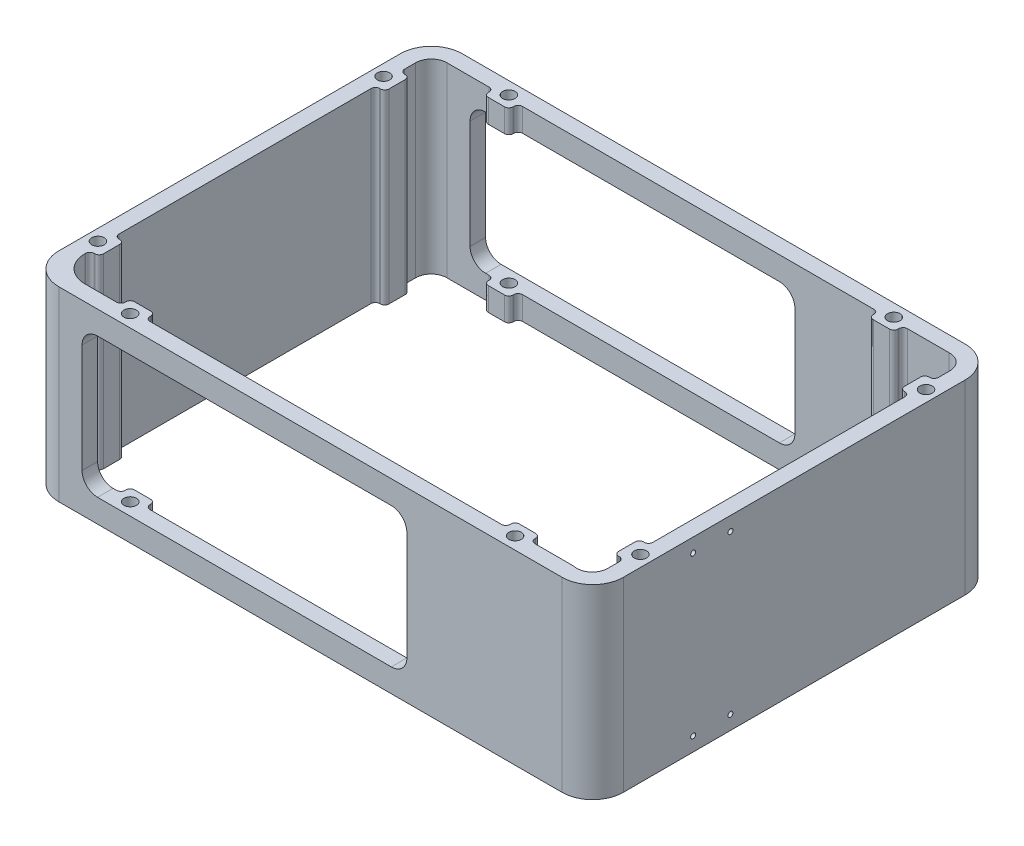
ISO-10303-21;
HEADER;
FILE_DESCRIPTION(('STEP AP214'),'2;1');
FILE_NAME('part.step','',(''),(''),'','','');
FILE_SCHEMA(('AUTOMOTIVE_DESIGN { 1 0 10303 214 1 1 1 1 }'));
ENDSEC;
DATA;
#1=APPLICATION_CONTEXT('core data for automotive mechanical design processes');
#2=APPLICATION_PROTOCOL_DEFINITION('international standard','automotive_design',2000,#1);
#3=PRODUCT_CONTEXT('',#1,'mechanical');
#4=PRODUCT('Part','Part','',(#3));
#5=PRODUCT_RELATED_PRODUCT_CATEGORY('part','',(#4));
#6=PRODUCT_DEFINITION_FORMATION('','',#4);
#7=PRODUCT_DEFINITION_CONTEXT('part definition',#1,'design');
#8=PRODUCT_DEFINITION('design','',#6,#7);
#9=PRODUCT_DEFINITION_SHAPE('','',#8);
#10=(LENGTH_UNIT() NAMED_UNIT(*) SI_UNIT(.MILLI.,.METRE.));
#11=(NAMED_UNIT(*) PLANE_ANGLE_UNIT() SI_UNIT($,.RADIAN.));
#12=(NAMED_UNIT(*) SI_UNIT($,.STERADIAN.) SOLID_ANGLE_UNIT());
#13=UNCERTAINTY_MEASURE_WITH_UNIT(LENGTH_MEASURE(1.E-05),#10,'distance_accuracy_value','');
#14=(GEOMETRIC_REPRESENTATION_CONTEXT(3) GLOBAL_UNCERTAINTY_ASSIGNED_CONTEXT((#13)) GLOBAL_UNIT_ASSIGNED_CONTEXT((#10,
#11,#12)) REPRESENTATION_CONTEXT('',''));
#15=CARTESIAN_POINT('',(0.,0.,0.));
#16=DIRECTION('',(0.,0.,1.));
#17=DIRECTION('',(1.,0.,0.));
#18=AXIS2_PLACEMENT_3D('',#15,#16,#17);
#19=CARTESIAN_POINT('',(-56.6118261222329,60.,-53.3610610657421));
#20=DIRECTION('',(0.,-1.,0.));
#21=DIRECTION('',(0.,0.,-1.));
#22=AXIS2_PLACEMENT_3D('',#19,#20,#21);
#23=CYLINDRICAL_SURFACE('',#22,1.38817387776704);
#24=CARTESIAN_POINT('',(-56.6118261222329,52.5,-53.3610610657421));
#25=DIRECTION('',(0.,1.,0.));
#26=DIRECTION('',(0.,0.,1.));
#27=AXIS2_PLACEMENT_3D('',#24,#25,#26);
#28=CIRCLE('',#27,1.38817387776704);
#29=CARTESIAN_POINT('',(-56.6118261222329,52.5,-54.7492349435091));
#30=VERTEX_POINT('',#29);
#31=CARTESIAN_POINT('',(-58.,52.5,-53.3610610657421));
#32=VERTEX_POINT('',#31);
#33=EDGE_CURVE('E896',#30,#32,#28,.T.);
#34=ORIENTED_EDGE('',*,*,#33,.F.);
#35=DIRECTION('',(0.,-1.,0.));
#36=VECTOR('',#35,1.);
#37=CARTESIAN_POINT('',(-56.6118261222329,60.,-54.7492349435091));
#38=LINE('',#37,#36);
#39=CARTESIAN_POINT('',(-56.6118261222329,60.,-54.7492349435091));
#40=VERTEX_POINT('',#39);
#41=EDGE_CURVE('E1477',#40,#30,#38,.T.);
#42=ORIENTED_EDGE('',*,*,#41,.F.);
#43=CARTESIAN_POINT('',(-56.6118261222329,60.,-53.3610610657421));
#44=DIRECTION('',(0.,1.,0.));
#45=DIRECTION('',(0.,0.,-1.));
#46=AXIS2_PLACEMENT_3D('',#43,#44,#45);
#47=CIRCLE('',#46,1.38817387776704);
#48=CARTESIAN_POINT('',(-58.,60.,-53.3610610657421));
#49=VERTEX_POINT('',#48);
#50=EDGE_CURVE('E981',#40,#49,#47,.T.);
#51=ORIENTED_EDGE('',*,*,#50,.T.);
#52=DIRECTION('',(0.,-1.,0.));
#53=VECTOR('',#52,1.);
#54=CARTESIAN_POINT('',(-58.,60.,-53.3610610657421));
#55=LINE('',#54,#53);
#56=EDGE_CURVE('E1473',#49,#32,#55,.T.);
#57=ORIENTED_EDGE('',*,*,#56,.T.);
#58=EDGE_LOOP('',(#34,#42,#51,#57));
#59=FACE_BOUND('',#58,.T.);
#60=ADVANCED_FACE('F38',(#59),#23,.F.);
#61=CARTESIAN_POINT('',(-58.,60.,-53.3610610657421));
#62=DIRECTION('',(1.,0.,0.));
#63=DIRECTION('',(0.,0.,-1.));
#64=AXIS2_PLACEMENT_3D('',#61,#62,#63);
#65=PLANE('',#64);
#66=DIRECTION('',(0.,0.,1.));
#67=VECTOR('',#66,1.);
#68=CARTESIAN_POINT('',(-58.,52.5,-53.3610610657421));
#69=LINE('',#68,#67);
#70=CARTESIAN_POINT('',(-58.,52.5,-53.1374088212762));
#71=VERTEX_POINT('',#70);
#72=EDGE_CURVE('E894',#32,#71,#69,.T.);
#73=ORIENTED_EDGE('',*,*,#72,.F.);
#74=ORIENTED_EDGE('',*,*,#56,.F.);
#75=DIRECTION('',(0.,0.,1.));
#76=VECTOR('',#75,1.);
#77=CARTESIAN_POINT('',(-58.,60.,-53.3610610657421));
#78=LINE('',#77,#76);
#79=CARTESIAN_POINT('',(-58.,60.,-53.1374088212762));
#80=VERTEX_POINT('',#79);
#81=EDGE_CURVE('E983',#49,#80,#78,.T.);
#82=ORIENTED_EDGE('',*,*,#81,.T.);
#83=DIRECTION('',(0.,-1.,0.));
#84=VECTOR('',#83,1.);
#85=CARTESIAN_POINT('',(-58.,60.,-53.1374088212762));
#86=LINE('',#85,#84);
#87=EDGE_CURVE('E1469',#80,#71,#86,.T.);
#88=ORIENTED_EDGE('',*,*,#87,.T.);
#89=EDGE_LOOP('',(#73,#74,#82,#88));
#90=FACE_BOUND('',#89,.T.);
#91=ADVANCED_FACE('F2033',(#90),#65,.T.);
#92=CARTESIAN_POINT('',(-59.388173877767,60.,-53.1374088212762));
#93=DIRECTION('',(0.,-1.,0.));
#94=DIRECTION('',(0.,0.,-1.));
#95=AXIS2_PLACEMENT_3D('',#92,#93,#94);
#96=CYLINDRICAL_SURFACE('',#95,1.38817387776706);
#97=CARTESIAN_POINT('',(-59.388173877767,52.5,-53.1374088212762));
#98=DIRECTION('',(0.,1.,0.));
#99=DIRECTION('',(0.,0.,1.));
#100=AXIS2_PLACEMENT_3D('',#97,#98,#99);
#101=CIRCLE('',#100,1.38817387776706);
#102=CARTESIAN_POINT('',(-59.388173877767,52.5,-51.7492349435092));
#103=VERTEX_POINT('',#102);
#104=EDGE_CURVE('E892',#71,#103,#101,.F.);
#105=ORIENTED_EDGE('',*,*,#104,.F.);
#106=ORIENTED_EDGE('',*,*,#87,.F.);
#107=CARTESIAN_POINT('',(-59.388173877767,60.,-53.1374088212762));
#108=DIRECTION('',(0.,-1.,0.));
#109=DIRECTION('',(0.,0.,-1.));
#110=AXIS2_PLACEMENT_3D('',#107,#108,#109);
#111=CIRCLE('',#110,1.38817387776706);
#112=CARTESIAN_POINT('',(-59.388173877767,60.,-51.7492349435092));
#113=VERTEX_POINT('',#112);
#114=EDGE_CURVE('E985',#80,#113,#111,.T.);
#115=ORIENTED_EDGE('',*,*,#114,.T.);
#116=DIRECTION('',(0.,-1.,0.));
#117=VECTOR('',#116,1.);
#118=CARTESIAN_POINT('',(-59.388173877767,60.,-51.7492349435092));
#119=LINE('',#118,#117);
#120=EDGE_CURVE('E1465',#113,#103,#119,.T.);
#121=ORIENTED_EDGE('',*,*,#120,.T.);
#122=EDGE_LOOP('',(#105,#106,#115,#121));
#123=FACE_BOUND('',#122,.T.);
#124=ADVANCED_FACE('F2040',(#123),#96,.T.);
#125=CARTESIAN_POINT('',(-64.611826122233,60.,-51.7492349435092));
#126=DIRECTION('',(0.,0.,1.));
#127=DIRECTION('',(1.,0.,0.));
#128=AXIS2_PLACEMENT_3D('',#125,#126,#127);
#129=PLANE('',#128);
#130=DIRECTION('',(-1.,0.,0.));
#131=VECTOR('',#130,1.);
#132=CARTESIAN_POINT('',(-64.611826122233,52.5,-51.7492349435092));
#133=LINE('',#132,#131);
#134=CARTESIAN_POINT('',(-64.611826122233,52.5,-51.7492349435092));
#135=VERTEX_POINT('',#134);
#136=EDGE_CURVE('E890',#103,#135,#133,.T.);
#137=ORIENTED_EDGE('',*,*,#136,.F.);
#138=ORIENTED_EDGE('',*,*,#120,.F.);
#139=DIRECTION('',(-1.,0.,0.));
#140=VECTOR('',#139,1.);
#141=CARTESIAN_POINT('',(-64.611826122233,60.,-51.7492349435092));
#142=LINE('',#141,#140);
#143=CARTESIAN_POINT('',(-64.611826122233,60.,-51.7492349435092));
#144=VERTEX_POINT('',#143);
#145=EDGE_CURVE('E987',#113,#144,#142,.T.);
#146=ORIENTED_EDGE('',*,*,#145,.T.);
#147=DIRECTION('',(0.,-1.,0.));
#148=VECTOR('',#147,1.);
#149=CARTESIAN_POINT('',(-64.611826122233,60.,-51.7492349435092));
#150=LINE('',#149,#148);
#151=EDGE_CURVE('E1461',#144,#135,#150,.T.);
#152=ORIENTED_EDGE('',*,*,#151,.T.);
#153=EDGE_LOOP('',(#137,#138,#146,#152));
#154=FACE_BOUND('',#153,.T.);
#155=ADVANCED_FACE('F2233',(#154),#129,.T.);
#156=CARTESIAN_POINT('',(-64.611826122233,60.,-53.1374088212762));
#157=DIRECTION('',(0.,-1.,0.));
#158=DIRECTION('',(0.,0.,-1.));
#159=AXIS2_PLACEMENT_3D('',#156,#157,#158);
#160=CYLINDRICAL_SURFACE('',#159,1.38817387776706);
#161=CARTESIAN_POINT('',(-64.611826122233,52.5,-53.1374088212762));
#162=DIRECTION('',(0.,1.,0.));
#163=DIRECTION('',(0.,0.,1.));
#164=AXIS2_PLACEMENT_3D('',#161,#162,#163);
#165=CIRCLE('',#164,1.38817387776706);
#166=CARTESIAN_POINT('',(-66.,52.5,-53.1374088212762));
#167=VERTEX_POINT('',#166);
#168=EDGE_CURVE('E888',#135,#167,#165,.F.);
#169=ORIENTED_EDGE('',*,*,#168,.F.);
#170=ORIENTED_EDGE('',*,*,#151,.F.);
#171=CARTESIAN_POINT('',(-64.611826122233,60.,-53.1374088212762));
#172=DIRECTION('',(0.,-1.,0.));
#173=DIRECTION('',(0.,0.,1.));
#174=AXIS2_PLACEMENT_3D('',#171,#172,#173);
#175=CIRCLE('',#174,1.38817387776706);
#176=CARTESIAN_POINT('',(-66.,60.,-53.1374088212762));
#177=VERTEX_POINT('',#176);
#178=EDGE_CURVE('E989',#144,#177,#175,.T.);
#179=ORIENTED_EDGE('',*,*,#178,.T.);
#180=DIRECTION('',(0.,-1.,0.));
#181=VECTOR('',#180,1.);
#182=CARTESIAN_POINT('',(-66.,60.,-53.1374088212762));
#183=LINE('',#182,#181);
#184=EDGE_CURVE('E1457',#177,#167,#183,.T.);
#185=ORIENTED_EDGE('',*,*,#184,.T.);
#186=EDGE_LOOP('',(#169,#170,#179,#185));
#187=FACE_BOUND('',#186,.T.);
#188=ADVANCED_FACE('F2242',(#187),#160,.T.);
#189=CARTESIAN_POINT('',(-66.,60.,-53.3610610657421));
#190=DIRECTION('',(-1.,0.,0.));
#191=DIRECTION('',(0.,0.,1.));
#192=AXIS2_PLACEMENT_3D('',#189,#190,#191);
#193=PLANE('',#192);
#194=DIRECTION('',(0.,0.,-1.));
#195=VECTOR('',#194,1.);
#196=CARTESIAN_POINT('',(-66.,52.5,-53.3610610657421));
#197=LINE('',#196,#195);
#198=CARTESIAN_POINT('',(-66.,52.5,-53.3610610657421));
#199=VERTEX_POINT('',#198);
#200=EDGE_CURVE('E886',#167,#199,#197,.T.);
#201=ORIENTED_EDGE('',*,*,#200,.F.);
#202=ORIENTED_EDGE('',*,*,#184,.F.);
#203=DIRECTION('',(0.,0.,-1.));
#204=VECTOR('',#203,1.);
#205=CARTESIAN_POINT('',(-66.,60.,-53.3610610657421));
#206=LINE('',#205,#204);
#207=CARTESIAN_POINT('',(-66.,60.,-53.3610610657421));
#208=VERTEX_POINT('',#207);
#209=EDGE_CURVE('E991',#177,#208,#206,.T.);
#210=ORIENTED_EDGE('',*,*,#209,.T.);
#211=DIRECTION('',(0.,-1.,0.));
#212=VECTOR('',#211,1.);
#213=CARTESIAN_POINT('',(-66.,60.,-53.3610610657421));
#214=LINE('',#213,#212);
#215=EDGE_CURVE('E1453',#208,#199,#214,.T.);
#216=ORIENTED_EDGE('',*,*,#215,.T.);
#217=EDGE_LOOP('',(#201,#202,#210,#216));
#218=FACE_BOUND('',#217,.T.);
#219=ADVANCED_FACE('F2251',(#218),#193,.T.);
#220=CARTESIAN_POINT('',(-67.388173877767,60.,-53.3610610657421));
#221=DIRECTION('',(0.,-1.,0.));
#222=DIRECTION('',(0.,0.,-1.));
#223=AXIS2_PLACEMENT_3D('',#220,#221,#222);
#224=CYLINDRICAL_SURFACE('',#223,1.38817387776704);
#225=CARTESIAN_POINT('',(-67.388173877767,52.5,-53.3610610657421));
#226=DIRECTION('',(0.,1.,0.));
#227=DIRECTION('',(0.,0.,1.));
#228=AXIS2_PLACEMENT_3D('',#225,#226,#227);
#229=CIRCLE('',#228,1.38817387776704);
#230=CARTESIAN_POINT('',(-67.388173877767,52.5,-54.7492349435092));
#231=VERTEX_POINT('',#230);
#232=EDGE_CURVE('E884',#199,#231,#229,.T.);
#233=ORIENTED_EDGE('',*,*,#232,.F.);
#234=ORIENTED_EDGE('',*,*,#215,.F.);
#235=CARTESIAN_POINT('',(-67.388173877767,60.,-53.3610610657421));
#236=DIRECTION('',(0.,1.,0.));
#237=DIRECTION('',(0.,0.,1.));
#238=AXIS2_PLACEMENT_3D('',#235,#236,#237);
#239=CIRCLE('',#238,1.38817387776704);
#240=CARTESIAN_POINT('',(-67.388173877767,60.,-54.7492349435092));
#241=VERTEX_POINT('',#240);
#242=EDGE_CURVE('E993',#208,#241,#239,.T.);
#243=ORIENTED_EDGE('',*,*,#242,.T.);
#244=DIRECTION('',(0.,-1.,0.));
#245=VECTOR('',#244,1.);
#246=CARTESIAN_POINT('',(-67.388173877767,60.,-54.7492349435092));
#247=LINE('',#246,#245);
#248=EDGE_CURVE('E1449',#241,#231,#247,.T.);
#249=ORIENTED_EDGE('',*,*,#248,.T.);
#250=EDGE_LOOP('',(#233,#234,#243,#249));
#251=FACE_BOUND('',#250,.T.);
#252=ADVANCED_FACE('F2260',(#251),#224,.F.);
#253=CARTESIAN_POINT('',(-67.388173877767,60.,63.8625911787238));
#254=DIRECTION('',(0.,-1.,0.));
#255=DIRECTION('',(0.,0.,-1.));
#256=AXIS2_PLACEMENT_3D('',#253,#254,#255);
#257=CYLINDRICAL_SURFACE('',#256,1.38817387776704);
#258=CARTESIAN_POINT('',(-67.388173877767,52.5,63.8625911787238));
#259=DIRECTION('',(0.,1.,0.));
#260=DIRECTION('',(0.,0.,1.));
#261=AXIS2_PLACEMENT_3D('',#258,#259,#260);
#262=CIRCLE('',#261,1.38817387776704);
#263=CARTESIAN_POINT('',(-67.388173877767,52.5,65.2507650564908));
#264=VERTEX_POINT('',#263);
#265=CARTESIAN_POINT('',(-66.,52.5,63.8625911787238));
#266=VERTEX_POINT('',#265);
#267=EDGE_CURVE('E878',#264,#266,#262,.T.);
#268=ORIENTED_EDGE('',*,*,#267,.F.);
#269=DIRECTION('',(0.,-1.,0.));
#270=VECTOR('',#269,1.);
#271=CARTESIAN_POINT('',(-67.388173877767,60.,65.2507650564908));
#272=LINE('',#271,#270);
#273=CARTESIAN_POINT('',(-67.388173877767,60.,65.2507650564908));
#274=VERTEX_POINT('',#273);
#275=EDGE_CURVE('E1405',#274,#264,#272,.T.);
#276=ORIENTED_EDGE('',*,*,#275,.F.);
#277=CARTESIAN_POINT('',(-67.388173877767,60.,63.8625911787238));
#278=DIRECTION('',(0.,1.,0.));
#279=DIRECTION('',(0.,0.,1.));
#280=AXIS2_PLACEMENT_3D('',#277,#278,#279);
#281=CIRCLE('',#280,1.38817387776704);
#282=CARTESIAN_POINT('',(-66.,60.,63.8625911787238));
#283=VERTEX_POINT('',#282);
#284=EDGE_CURVE('E1037',#274,#283,#281,.T.);
#285=ORIENTED_EDGE('',*,*,#284,.T.);
#286=DIRECTION('',(0.,-1.,0.));
#287=VECTOR('',#286,1.);
#288=CARTESIAN_POINT('',(-66.,60.,63.8625911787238));
#289=LINE('',#288,#287);
#290=EDGE_CURVE('E1401',#283,#266,#289,.T.);
#291=ORIENTED_EDGE('',*,*,#290,.T.);
#292=EDGE_LOOP('',(#268,#276,#285,#291));
#293=FACE_BOUND('',#292,.T.);
#294=ADVANCED_FACE('F1998',(#293),#257,.F.);
#295=CARTESIAN_POINT('',(-66.,60.,63.8625911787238));
#296=DIRECTION('',(-1.,0.,0.));
#297=DIRECTION('',(0.,0.,1.));
#298=AXIS2_PLACEMENT_3D('',#295,#296,#297);
#299=PLANE('',#298);
#300=DIRECTION('',(0.,0.,-1.));
#301=VECTOR('',#300,1.);
#302=CARTESIAN_POINT('',(-66.,52.5,63.8625911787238));
#303=LINE('',#302,#301);
#304=CARTESIAN_POINT('',(-66.,52.5,63.6389389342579));
#305=VERTEX_POINT('',#304);
#306=EDGE_CURVE('E876',#266,#305,#303,.T.);
#307=ORIENTED_EDGE('',*,*,#306,.F.);
#308=ORIENTED_EDGE('',*,*,#290,.F.);
#309=DIRECTION('',(0.,0.,-1.));
#310=VECTOR('',#309,1.);
#311=CARTESIAN_POINT('',(-66.,60.,63.8625911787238));
#312=LINE('',#311,#310);
#313=CARTESIAN_POINT('',(-66.,60.,63.6389389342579));
#314=VERTEX_POINT('',#313);
#315=EDGE_CURVE('E1039',#283,#314,#312,.T.);
#316=ORIENTED_EDGE('',*,*,#315,.T.);
#317=DIRECTION('',(0.,-1.,0.));
#318=VECTOR('',#317,1.);
#319=CARTESIAN_POINT('',(-66.,60.,63.6389389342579));
#320=LINE('',#319,#318);
#321=EDGE_CURVE('E1397',#314,#305,#320,.T.);
#322=ORIENTED_EDGE('',*,*,#321,.T.);
#323=EDGE_LOOP('',(#307,#308,#316,#322));
#324=FACE_BOUND('',#323,.T.);
#325=ADVANCED_FACE('F2006',(#324),#299,.T.);
#326=CARTESIAN_POINT('',(-64.611826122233,60.,63.6389389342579));
#327=DIRECTION('',(0.,-1.,0.));
#328=DIRECTION('',(0.,0.,-1.));
#329=AXIS2_PLACEMENT_3D('',#326,#327,#328);
#330=CYLINDRICAL_SURFACE('',#329,1.38817387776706);
#331=CARTESIAN_POINT('',(-64.611826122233,52.5,63.6389389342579));
#332=DIRECTION('',(0.,1.,0.));
#333=DIRECTION('',(0.,0.,1.));
#334=AXIS2_PLACEMENT_3D('',#331,#332,#333);
#335=CIRCLE('',#334,1.38817387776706);
#336=CARTESIAN_POINT('',(-64.611826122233,52.5,62.2507650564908));
#337=VERTEX_POINT('',#336);
#338=EDGE_CURVE('E874',#305,#337,#335,.F.);
#339=ORIENTED_EDGE('',*,*,#338,.F.);
#340=ORIENTED_EDGE('',*,*,#321,.F.);
#341=CARTESIAN_POINT('',(-64.611826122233,60.,63.6389389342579));
#342=DIRECTION('',(0.,-1.,0.));
#343=DIRECTION('',(0.,0.,-1.));
#344=AXIS2_PLACEMENT_3D('',#341,#342,#343);
#345=CIRCLE('',#344,1.38817387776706);
#346=CARTESIAN_POINT('',(-64.611826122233,60.,62.2507650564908));
#347=VERTEX_POINT('',#346);
#348=EDGE_CURVE('E1041',#314,#347,#345,.T.);
#349=ORIENTED_EDGE('',*,*,#348,.T.);
#350=DIRECTION('',(0.,-1.,0.));
#351=VECTOR('',#350,1.);
#352=CARTESIAN_POINT('',(-64.611826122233,60.,62.2507650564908));
#353=LINE('',#352,#351);
#354=EDGE_CURVE('E1393',#347,#337,#353,.T.);
#355=ORIENTED_EDGE('',*,*,#354,.T.);
#356=EDGE_LOOP('',(#339,#340,#349,#355));
#357=FACE_BOUND('',#356,.T.);
#358=ADVANCED_FACE('F2009',(#357),#330,.T.);
#359=CARTESIAN_POINT('',(-64.611826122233,60.,62.2507650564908));
#360=DIRECTION('',(0.,0.,-1.));
#361=DIRECTION('',(-1.,0.,0.));
#362=AXIS2_PLACEMENT_3D('',#359,#360,#361);
#363=PLANE('',#362);
#364=DIRECTION('',(1.,0.,0.));
#365=VECTOR('',#364,1.);
#366=CARTESIAN_POINT('',(-64.611826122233,52.5,62.2507650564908));
#367=LINE('',#366,#365);
#368=CARTESIAN_POINT('',(-59.388173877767,52.5,62.2507650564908));
#369=VERTEX_POINT('',#368);
#370=EDGE_CURVE('E872',#337,#369,#367,.T.);
#371=ORIENTED_EDGE('',*,*,#370,.F.);
#372=ORIENTED_EDGE('',*,*,#354,.F.);
#373=DIRECTION('',(1.,0.,0.));
#374=VECTOR('',#373,1.);
#375=CARTESIAN_POINT('',(-64.611826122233,60.,62.2507650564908));
#376=LINE('',#375,#374);
#377=CARTESIAN_POINT('',(-59.388173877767,60.,62.2507650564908));
#378=VERTEX_POINT('',#377);
#379=EDGE_CURVE('E1043',#347,#378,#376,.T.);
#380=ORIENTED_EDGE('',*,*,#379,.T.);
#381=DIRECTION('',(0.,-1.,0.));
#382=VECTOR('',#381,1.);
#383=CARTESIAN_POINT('',(-59.388173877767,60.,62.2507650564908));
#384=LINE('',#383,#382);
#385=EDGE_CURVE('E1389',#378,#369,#384,.T.);
#386=ORIENTED_EDGE('',*,*,#385,.T.);
#387=EDGE_LOOP('',(#371,#372,#380,#386));
#388=FACE_BOUND('',#387,.T.);
#389=ADVANCED_FACE('F2014',(#388),#363,.T.);
#390=CARTESIAN_POINT('',(-59.388173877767,60.,63.6389389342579));
#391=DIRECTION('',(0.,-1.,0.));
#392=DIRECTION('',(0.,0.,-1.));
#393=AXIS2_PLACEMENT_3D('',#390,#391,#392);
#394=CYLINDRICAL_SURFACE('',#393,1.38817387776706);
#395=CARTESIAN_POINT('',(-59.388173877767,52.5,63.6389389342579));
#396=DIRECTION('',(0.,1.,0.));
#397=DIRECTION('',(0.,0.,1.));
#398=AXIS2_PLACEMENT_3D('',#395,#396,#397);
#399=CIRCLE('',#398,1.38817387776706);
#400=CARTESIAN_POINT('',(-58.,52.5,63.6389389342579));
#401=VERTEX_POINT('',#400);
#402=EDGE_CURVE('E870',#369,#401,#399,.F.);
#403=ORIENTED_EDGE('',*,*,#402,.F.);
#404=ORIENTED_EDGE('',*,*,#385,.F.);
#405=CARTESIAN_POINT('',(-59.388173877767,60.,63.6389389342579));
#406=DIRECTION('',(0.,-1.,0.));
#407=DIRECTION('',(0.,0.,-1.));
#408=AXIS2_PLACEMENT_3D('',#405,#406,#407);
#409=CIRCLE('',#408,1.38817387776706);
#410=CARTESIAN_POINT('',(-58.,60.,63.6389389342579));
#411=VERTEX_POINT('',#410);
#412=EDGE_CURVE('E1045',#378,#411,#409,.T.);
#413=ORIENTED_EDGE('',*,*,#412,.T.);
#414=DIRECTION('',(0.,-1.,0.));
#415=VECTOR('',#414,1.);
#416=CARTESIAN_POINT('',(-58.,60.,63.6389389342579));
#417=LINE('',#416,#415);
#418=EDGE_CURVE('E1385',#411,#401,#417,.T.);
#419=ORIENTED_EDGE('',*,*,#418,.T.);
#420=EDGE_LOOP('',(#403,#404,#413,#419));
#421=FACE_BOUND('',#420,.T.);
#422=ADVANCED_FACE('F2017',(#421),#394,.T.);
#423=CARTESIAN_POINT('',(-58.,60.,63.8625911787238));
#424=DIRECTION('',(1.,0.,0.));
#425=DIRECTION('',(0.,0.,-1.));
#426=AXIS2_PLACEMENT_3D('',#423,#424,#425);
#427=PLANE('',#426);
#428=DIRECTION('',(0.,0.,1.));
#429=VECTOR('',#428,1.);
#430=CARTESIAN_POINT('',(-58.,52.5,63.8625911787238));
#431=LINE('',#430,#429);
#432=CARTESIAN_POINT('',(-58.,52.5,63.8625911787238));
#433=VERTEX_POINT('',#432);
#434=EDGE_CURVE('E868',#401,#433,#431,.T.);
#435=ORIENTED_EDGE('',*,*,#434,.F.);
#436=ORIENTED_EDGE('',*,*,#418,.F.);
#437=DIRECTION('',(0.,0.,1.));
#438=VECTOR('',#437,1.);
#439=CARTESIAN_POINT('',(-58.,60.,63.8625911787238));
#440=LINE('',#439,#438);
#441=CARTESIAN_POINT('',(-58.,60.,63.8625911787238));
#442=VERTEX_POINT('',#441);
#443=EDGE_CURVE('E1047',#411,#442,#440,.T.);
#444=ORIENTED_EDGE('',*,*,#443,.T.);
#445=DIRECTION('',(0.,-1.,0.));
#446=VECTOR('',#445,1.);
#447=CARTESIAN_POINT('',(-58.,60.,63.8625911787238));
#448=LINE('',#447,#446);
#449=EDGE_CURVE('E1381',#442,#433,#448,.T.);
#450=ORIENTED_EDGE('',*,*,#449,.T.);
#451=EDGE_LOOP('',(#435,#436,#444,#450));
#452=FACE_BOUND('',#451,.T.);
#453=ADVANCED_FACE('F2021',(#452),#427,.T.);
#454=CARTESIAN_POINT('',(-56.6118261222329,60.,63.8625911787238));
#455=DIRECTION('',(0.,-1.,0.));
#456=DIRECTION('',(0.,0.,-1.));
#457=AXIS2_PLACEMENT_3D('',#454,#455,#456);
#458=CYLINDRICAL_SURFACE('',#457,1.38817387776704);
#459=CARTESIAN_POINT('',(-56.6118261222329,52.5,63.8625911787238));
#460=DIRECTION('',(0.,1.,0.));
#461=DIRECTION('',(0.,0.,1.));
#462=AXIS2_PLACEMENT_3D('',#459,#460,#461);
#463=CIRCLE('',#462,1.38817387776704);
#464=CARTESIAN_POINT('',(-56.6118261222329,52.5,65.2507650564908));
#465=VERTEX_POINT('',#464);
#466=EDGE_CURVE('E866',#433,#465,#463,.T.);
#467=ORIENTED_EDGE('',*,*,#466,.F.);
#468=ORIENTED_EDGE('',*,*,#449,.F.);
#469=CARTESIAN_POINT('',(-56.6118261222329,60.,63.8625911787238));
#470=DIRECTION('',(0.,1.,0.));
#471=DIRECTION('',(0.,0.,1.));
#472=AXIS2_PLACEMENT_3D('',#469,#470,#471);
#473=CIRCLE('',#472,1.38817387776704);
#474=CARTESIAN_POINT('',(-56.6118261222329,60.,65.2507650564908));
#475=VERTEX_POINT('',#474);
#476=EDGE_CURVE('E1049',#442,#475,#473,.T.);
#477=ORIENTED_EDGE('',*,*,#476,.T.);
#478=DIRECTION('',(0.,-1.,0.));
#479=VECTOR('',#478,1.);
#480=CARTESIAN_POINT('',(-56.6118261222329,60.,65.2507650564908));
#481=LINE('',#480,#479);
#482=EDGE_CURVE('E1377',#475,#465,#481,.T.);
#483=ORIENTED_EDGE('',*,*,#482,.T.);
#484=EDGE_LOOP('',(#467,#468,#477,#483));
#485=FACE_BOUND('',#484,.T.);
#486=ADVANCED_FACE('F1971',(#485),#458,.F.);
#487=CARTESIAN_POINT('',(-62.,60.,-55.7492349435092));
#488=DIRECTION('',(0.,-1.,0.));
#489=DIRECTION('',(0.,0.,-1.));
#490=AXIS2_PLACEMENT_3D('',#487,#488,#489);
#491=CYLINDRICAL_SURFACE('',#490,2.);
#492=CARTESIAN_POINT('',(-62.,52.5,-55.7492349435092));
#493=DIRECTION('',(0.,1.,0.));
#494=DIRECTION('',(0.,0.,1.));
#495=AXIS2_PLACEMENT_3D('',#492,#493,#494);
#496=CIRCLE('',#495,2.);
#497=CARTESIAN_POINT('',(-62.,52.5,-53.7492349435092));
#498=VERTEX_POINT('',#497);
#499=EDGE_CURVE('E861',#498,#498,#496,.T.);
#500=ORIENTED_EDGE('',*,*,#499,.F.);
#501=EDGE_LOOP('',(#500));
#502=FACE_BOUND('',#501,.T.);
#503=CARTESIAN_POINT('',(-62.,60.,-55.7492349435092));
#504=DIRECTION('',(0.,1.,0.));
#505=DIRECTION('',(0.,0.,1.));
#506=AXIS2_PLACEMENT_3D('',#503,#504,#505);
#507=CIRCLE('',#506,2.);
#508=CARTESIAN_POINT('',(-62.,60.,-53.7492349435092));
#509=VERTEX_POINT('',#508);
#510=EDGE_CURVE('E948',#509,#509,#507,.T.);
#511=ORIENTED_EDGE('',*,*,#510,.T.);
#512=EDGE_LOOP('',(#511));
#513=FACE_BOUND('',#512,.T.);
#514=ADVANCED_FACE('F2028',(#502,#513),#491,.F.);
#515=CARTESIAN_POINT('',(-62.,60.,66.2507650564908));
#516=DIRECTION('',(0.,-1.,0.));
#517=DIRECTION('',(0.,0.,-1.));
#518=AXIS2_PLACEMENT_3D('',#515,#516,#517);
#519=CYLINDRICAL_SURFACE('',#518,2.);
#520=CARTESIAN_POINT('',(-62.,52.5,66.2507650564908));
#521=DIRECTION('',(0.,1.,0.));
#522=DIRECTION('',(0.,0.,1.));
#523=AXIS2_PLACEMENT_3D('',#520,#521,#522);
#524=CIRCLE('',#523,2.);
#525=CARTESIAN_POINT('',(-62.,52.5,68.2507650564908));
#526=VERTEX_POINT('',#525);
#527=EDGE_CURVE('E860',#526,#526,#524,.T.);
#528=ORIENTED_EDGE('',*,*,#527,.F.);
#529=EDGE_LOOP('',(#528));
#530=FACE_BOUND('',#529,.T.);
#531=CARTESIAN_POINT('',(-62.,60.,66.2507650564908));
#532=DIRECTION('',(0.,1.,0.));
#533=DIRECTION('',(0.,0.,-1.));
#534=AXIS2_PLACEMENT_3D('',#531,#532,#533);
#535=CIRCLE('',#534,2.);
#536=CARTESIAN_POINT('',(-62.,60.,64.2507650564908));
#537=VERTEX_POINT('',#536);
#538=EDGE_CURVE('E936',#537,#537,#535,.T.);
#539=ORIENTED_EDGE('',*,*,#538,.T.);
#540=EDGE_LOOP('',(#539));
#541=FACE_BOUND('',#540,.T.);
#542=ADVANCED_FACE('F2075',(#530,#541),#519,.F.);
#543=CARTESIAN_POINT('',(81.,60.,-49.75));
#544=DIRECTION('',(0.,1.,0.));
#545=DIRECTION('',(0.,0.,1.));
#546=AXIS2_PLACEMENT_3D('',#543,#544,#545);
#547=PLANE('',#546);
#548=CARTESIAN_POINT('',(87.380604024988,60.,-40.7492349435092));
#549=DIRECTION('',(0.,1.,0.));
#550=DIRECTION('',(0.,0.,-1.));
#551=AXIS2_PLACEMENT_3D('',#548,#549,#550);
#552=CIRCLE('',#551,2.);
#553=CARTESIAN_POINT('',(87.380604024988,60.,-42.7492349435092));
#554=VERTEX_POINT('',#553);
#555=EDGE_CURVE('E918',#554,#554,#552,.T.);
#556=ORIENTED_EDGE('',*,*,#555,.F.);
#557=EDGE_LOOP('',(#556));
#558=FACE_BOUND('',#557,.T.);
#559=CARTESIAN_POINT('',(62.,60.,66.2507650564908));
#560=DIRECTION('',(0.,1.,0.));
#561=DIRECTION('',(0.,0.,1.));
#562=AXIS2_PLACEMENT_3D('',#559,#560,#561);
#563=CIRCLE('',#562,2.);
#564=CARTESIAN_POINT('',(62.,60.,68.2507650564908));
#565=VERTEX_POINT('',#564);
#566=EDGE_CURVE('E930',#565,#565,#563,.T.);
#567=ORIENTED_EDGE('',*,*,#566,.F.);
#568=EDGE_LOOP('',(#567));
#569=FACE_BOUND('',#568,.T.);
#570=CARTESIAN_POINT('',(-87.380604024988,60.,-40.7492349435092));
#571=DIRECTION('',(0.,1.,0.));
#572=DIRECTION('',(0.,0.,1.));
#573=AXIS2_PLACEMENT_3D('',#570,#571,#572);
#574=CIRCLE('',#573,2.);
#575=CARTESIAN_POINT('',(-87.380604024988,60.,-38.7492349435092));
#576=VERTEX_POINT('',#575);
#577=EDGE_CURVE('E942',#576,#576,#574,.T.);
#578=ORIENTED_EDGE('',*,*,#577,.F.);
#579=EDGE_LOOP('',(#578));
#580=FACE_BOUND('',#579,.T.);
#581=CARTESIAN_POINT('',(-87.380604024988,60.,51.2507650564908));
#582=DIRECTION('',(0.,1.,0.));
#583=DIRECTION('',(0.,0.,-1.));
#584=AXIS2_PLACEMENT_3D('',#581,#582,#583);
#585=CIRCLE('',#584,2.);
#586=CARTESIAN_POINT('',(-87.380604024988,60.,49.2507650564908));
#587=VERTEX_POINT('',#586);
#588=EDGE_CURVE('E954',#587,#587,#585,.T.);
#589=ORIENTED_EDGE('',*,*,#588,.F.);
#590=EDGE_LOOP('',(#589));
#591=FACE_BOUND('',#590,.T.);
#592=CARTESIAN_POINT('',(81.,60.,-49.75));
#593=DIRECTION('',(0.,1.,0.));
#594=DIRECTION('',(0.,0.,1.));
#595=AXIS2_PLACEMENT_3D('',#592,#593,#594);
#596=CIRCLE('',#595,9.99999999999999);
#597=CARTESIAN_POINT('',(91.,60.,-49.75));
#598=VERTEX_POINT('',#597);
#599=CARTESIAN_POINT('',(81.123695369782,60.,-59.7492349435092));
#600=VERTEX_POINT('',#599);
#601=EDGE_CURVE('E1500',#598,#600,#596,.T.);
#602=ORIENTED_EDGE('',*,*,#601,.T.);
#603=DIRECTION('',(-1.,0.,0.));
#604=VECTOR('',#603,1.);
#605=CARTESIAN_POINT('',(-81.,60.,-59.7492349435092));
#606=LINE('',#605,#604);
#607=CARTESIAN_POINT('',(-81.,60.,-59.7492349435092));
#608=VERTEX_POINT('',#607);
#609=EDGE_CURVE('E1503',#600,#608,#606,.T.);
#610=ORIENTED_EDGE('',*,*,#609,.T.);
#611=CARTESIAN_POINT('',(-81.,60.,-49.7492349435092));
#612=DIRECTION('',(0.,1.,0.));
#613=DIRECTION('',(0.,0.,1.));
#614=AXIS2_PLACEMENT_3D('',#611,#612,#613);
#615=CIRCLE('',#614,9.99999999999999);
#616=CARTESIAN_POINT('',(-91.,60.,-49.7492349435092));
#617=VERTEX_POINT('',#616);
#618=EDGE_CURVE('E1506',#608,#617,#615,.T.);
#619=ORIENTED_EDGE('',*,*,#618,.T.);
#620=DIRECTION('',(0.,0.,1.));
#621=VECTOR('',#620,1.);
#622=CARTESIAN_POINT('',(-91.,60.,-49.7492349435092));
#623=LINE('',#622,#621);
#624=CARTESIAN_POINT('',(-91.,60.,60.2507650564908));
#625=VERTEX_POINT('',#624);
#626=EDGE_CURVE('E1508',#617,#625,#623,.T.);
#627=ORIENTED_EDGE('',*,*,#626,.T.);
#628=CARTESIAN_POINT('',(-81.,60.,60.2507650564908));
#629=DIRECTION('',(0.,1.,0.));
#630=DIRECTION('',(0.,0.,1.));
#631=AXIS2_PLACEMENT_3D('',#628,#629,#630);
#632=CIRCLE('',#631,9.99999999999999);
#633=CARTESIAN_POINT('',(-81.,60.,70.2507650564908));
#634=VERTEX_POINT('',#633);
#635=EDGE_CURVE('E1510',#625,#634,#632,.T.);
#636=ORIENTED_EDGE('',*,*,#635,.T.);
#637=DIRECTION('',(1.,0.,0.));
#638=VECTOR('',#637,1.);
#639=CARTESIAN_POINT('',(-81.,60.,70.2507650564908));
#640=LINE('',#639,#638);
#641=CARTESIAN_POINT('',(81.1311666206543,60.,70.2507650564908));
#642=VERTEX_POINT('',#641);
#643=EDGE_CURVE('E1512',#634,#642,#640,.T.);
#644=ORIENTED_EDGE('',*,*,#643,.T.);
#645=CARTESIAN_POINT('',(81.1311666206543,60.,60.3819316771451));
#646=DIRECTION('',(0.,1.,0.));
#647=DIRECTION('',(0.,0.,1.));
#648=AXIS2_PLACEMENT_3D('',#645,#646,#647);
#649=CIRCLE('',#648,9.86883337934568);
#650=CARTESIAN_POINT('',(91.,60.,60.3819316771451));
#651=VERTEX_POINT('',#650);
#652=EDGE_CURVE('E1514',#642,#651,#649,.T.);
#653=ORIENTED_EDGE('',*,*,#652,.T.);
#654=DIRECTION('',(0.,0.,-1.));
#655=VECTOR('',#654,1.);
#656=CARTESIAN_POINT('',(91.,60.,31.75));
#657=LINE('',#656,#655);
#658=EDGE_CURVE('E1516',#651,#598,#657,.T.);
#659=ORIENTED_EDGE('',*,*,#658,.T.);
#660=EDGE_LOOP('',(#602,#610,#619,#627,#636,#644,#653,#659));
#661=FACE_BOUND('',#660,.T.);
#662=DIRECTION('',(-1.,0.,0.));
#663=VECTOR('',#662,1.);
#664=CARTESIAN_POINT('',(67.388173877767,60.,-54.7492349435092));
#665=LINE('',#664,#663);
#666=CARTESIAN_POINT('',(80.7710041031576,60.,-54.7492349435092));
#667=VERTEX_POINT('',#666);
#668=CARTESIAN_POINT('',(67.388173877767,60.,-54.7492349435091));
#669=VERTEX_POINT('',#668);
#670=EDGE_CURVE('E962',#667,#669,#665,.T.);
#671=ORIENTED_EDGE('',*,*,#670,.F.);
#672=CARTESIAN_POINT('',(81.0000020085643,60.,-49.754481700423));
#673=DIRECTION('',(0.,1.,0.));
#674=DIRECTION('',(0.,0.,1.));
#675=AXIS2_PLACEMENT_3D('',#672,#673,#674);
#676=CIRCLE('',#675,4.99999999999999);
#677=CARTESIAN_POINT('',(86.,60.,-49.75));
#678=VERTEX_POINT('',#677);
#679=EDGE_CURVE('E960',#678,#667,#676,.T.);
#680=ORIENTED_EDGE('',*,*,#679,.F.);
#681=DIRECTION('',(0.,0.,-1.));
#682=VECTOR('',#681,1.);
#683=CARTESIAN_POINT('',(86.,60.,-49.75));
#684=LINE('',#683,#682);
#685=CARTESIAN_POINT('',(86.,60.,-46.1374088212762));
#686=VERTEX_POINT('',#685);
#687=EDGE_CURVE('E1104',#686,#678,#684,.T.);
#688=ORIENTED_EDGE('',*,*,#687,.F.);
#689=CARTESIAN_POINT('',(84.6118261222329,60.,-46.1374088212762));
#690=DIRECTION('',(0.,1.,0.));
#691=DIRECTION('',(0.,0.,-1.));
#692=AXIS2_PLACEMENT_3D('',#689,#690,#691);
#693=CIRCLE('',#692,1.38817387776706);
#694=CARTESIAN_POINT('',(84.6118261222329,60.,-44.7492349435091));
#695=VERTEX_POINT('',#694);
#696=EDGE_CURVE('E1101',#695,#686,#693,.T.);
#697=ORIENTED_EDGE('',*,*,#696,.F.);
#698=DIRECTION('',(1.,0.,0.));
#699=VECTOR('',#698,1.);
#700=CARTESIAN_POINT('',(84.6118261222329,60.,-44.7492349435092));
#701=LINE('',#700,#699);
#702=CARTESIAN_POINT('',(84.388173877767,60.,-44.7492349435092));
#703=VERTEX_POINT('',#702);
#704=EDGE_CURVE('E1099',#703,#695,#701,.T.);
#705=ORIENTED_EDGE('',*,*,#704,.F.);
#706=CARTESIAN_POINT('',(84.388173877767,60.,-43.3610610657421));
#707=DIRECTION('',(0.,-1.,0.));
#708=DIRECTION('',(0.,0.,-1.));
#709=AXIS2_PLACEMENT_3D('',#706,#707,#708);
#710=CIRCLE('',#709,1.38817387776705);
#711=CARTESIAN_POINT('',(83.,60.,-43.3610610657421));
#712=VERTEX_POINT('',#711);
#713=EDGE_CURVE('E1097',#712,#703,#710,.T.);
#714=ORIENTED_EDGE('',*,*,#713,.F.);
#715=DIRECTION('',(0.,0.,-1.));
#716=VECTOR('',#715,1.);
#717=CARTESIAN_POINT('',(83.,60.,-38.1419412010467));
#718=LINE('',#717,#716);
#719=CARTESIAN_POINT('',(83.,60.,-38.1419412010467));
#720=VERTEX_POINT('',#719);
#721=EDGE_CURVE('E1095',#720,#712,#718,.T.);
#722=ORIENTED_EDGE('',*,*,#721,.F.);
#723=CARTESIAN_POINT('',(84.3881738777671,60.,-38.1419412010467));
#724=DIRECTION('',(0.,-1.,0.));
#725=DIRECTION('',(0.,0.,-1.));
#726=AXIS2_PLACEMENT_3D('',#723,#724,#725);
#727=CIRCLE('',#726,1.38817387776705);
#728=CARTESIAN_POINT('',(84.3926988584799,60.,-36.7537746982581));
#729=VERTEX_POINT('',#728);
#730=EDGE_CURVE('E1093',#729,#720,#727,.T.);
#731=ORIENTED_EDGE('',*,*,#730,.F.);
#732=DIRECTION('',(-0.999994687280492,0.,0.00325966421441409));
#733=VECTOR('',#732,1.);
#734=CARTESIAN_POINT('',(84.6073011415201,60.,-36.7544742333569));
#735=LINE('',#734,#733);
#736=CARTESIAN_POINT('',(84.6073011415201,60.,-36.7544742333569));
#737=VERTEX_POINT('',#736);
#738=EDGE_CURVE('E1091',#737,#729,#735,.T.);
#739=ORIENTED_EDGE('',*,*,#738,.F.);
#740=CARTESIAN_POINT('',(84.6118261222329,60.,-35.3663077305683));
#741=DIRECTION('',(0.,1.,0.));
#742=DIRECTION('',(0.,0.,-1.));
#743=AXIS2_PLACEMENT_3D('',#740,#741,#742);
#744=CIRCLE('',#743,1.38817387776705);
#745=CARTESIAN_POINT('',(86.,60.,-35.3663077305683));
#746=VERTEX_POINT('',#745);
#747=EDGE_CURVE('E1089',#746,#737,#744,.T.);
#748=ORIENTED_EDGE('',*,*,#747,.F.);
#749=DIRECTION('',(0.,0.,-1.));
#750=VECTOR('',#749,1.);
#751=CARTESIAN_POINT('',(86.,60.,5.75000000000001));
#752=LINE('',#751,#750);
#753=CARTESIAN_POINT('',(86.,60.,45.8625911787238));
#754=VERTEX_POINT('',#753);
#755=EDGE_CURVE('E1087',#754,#746,#752,.T.);
#756=ORIENTED_EDGE('',*,*,#755,.F.);
#757=CARTESIAN_POINT('',(84.6118261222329,60.,45.8625911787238));
#758=DIRECTION('',(0.,1.,0.));
#759=DIRECTION('',(0.,0.,-1.));
#760=AXIS2_PLACEMENT_3D('',#757,#758,#759);
#761=CIRCLE('',#760,1.38817387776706);
#762=CARTESIAN_POINT('',(84.6118261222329,60.,47.2507650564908));
#763=VERTEX_POINT('',#762);
#764=EDGE_CURVE('E1085',#763,#754,#761,.T.);
#765=ORIENTED_EDGE('',*,*,#764,.F.);
#766=DIRECTION('',(1.,0.,0.));
#767=VECTOR('',#766,1.);
#768=CARTESIAN_POINT('',(84.6118261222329,60.,47.2507650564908));
#769=LINE('',#768,#767);
#770=CARTESIAN_POINT('',(84.3881738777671,60.,47.2507650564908));
#771=VERTEX_POINT('',#770);
#772=EDGE_CURVE('E1083',#771,#763,#769,.T.);
#773=ORIENTED_EDGE('',*,*,#772,.F.);
#774=CARTESIAN_POINT('',(84.3881738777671,60.,48.6389389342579));
#775=DIRECTION('',(0.,-1.,0.));
#776=DIRECTION('',(0.,0.,-1.));
#777=AXIS2_PLACEMENT_3D('',#774,#775,#776);
#778=CIRCLE('',#777,1.38817387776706);
#779=CARTESIAN_POINT('',(83.,60.,48.6389389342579));
#780=VERTEX_POINT('',#779);
#781=EDGE_CURVE('E1081',#780,#771,#778,.T.);
#782=ORIENTED_EDGE('',*,*,#781,.F.);
#783=DIRECTION('',(0.,0.,-1.));
#784=VECTOR('',#783,1.);
#785=CARTESIAN_POINT('',(83.,60.,48.6389389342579));
#786=LINE('',#785,#784);
#787=CARTESIAN_POINT('',(83.,60.,53.8625911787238));
#788=VERTEX_POINT('',#787);
#789=EDGE_CURVE('E1079',#788,#780,#786,.T.);
#790=ORIENTED_EDGE('',*,*,#789,.F.);
#791=CARTESIAN_POINT('',(84.388173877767,60.,53.8625911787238));
#792=DIRECTION('',(0.,-1.,0.));
#793=DIRECTION('',(0.,0.,1.));
#794=AXIS2_PLACEMENT_3D('',#791,#792,#793);
#795=CIRCLE('',#794,1.38817387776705);
#796=CARTESIAN_POINT('',(84.388173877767,60.,55.2507650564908));
#797=VERTEX_POINT('',#796);
#798=EDGE_CURVE('E1077',#797,#788,#795,.T.);
#799=ORIENTED_EDGE('',*,*,#798,.F.);
#800=DIRECTION('',(-1.,0.,0.));
#801=VECTOR('',#800,1.);
#802=CARTESIAN_POINT('',(84.6118261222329,60.,55.2507650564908));
#803=LINE('',#802,#801);
#804=CARTESIAN_POINT('',(84.6118261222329,60.,55.2507650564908));
#805=VERTEX_POINT('',#804);
#806=EDGE_CURVE('E1075',#805,#797,#803,.T.);
#807=ORIENTED_EDGE('',*,*,#806,.F.);
#808=CARTESIAN_POINT('',(84.6118261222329,60.,56.6389389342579));
#809=DIRECTION('',(0.,1.,0.));
#810=DIRECTION('',(0.,0.,1.));
#811=AXIS2_PLACEMENT_3D('',#808,#809,#810);
#812=CIRCLE('',#811,1.38817387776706);
#813=CARTESIAN_POINT('',(86.,60.,56.6389389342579));
#814=VERTEX_POINT('',#813);
#815=EDGE_CURVE('E1073',#814,#805,#812,.T.);
#816=ORIENTED_EDGE('',*,*,#815,.F.);
#817=DIRECTION('',(0.,0.,-1.));
#818=VECTOR('',#817,1.);
#819=CARTESIAN_POINT('',(86.,60.,56.6389389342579));
#820=LINE('',#819,#818);
#821=CARTESIAN_POINT('',(86.,60.,60.3819316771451));
#822=VERTEX_POINT('',#821);
#823=EDGE_CURVE('E1071',#822,#814,#820,.T.);
#824=ORIENTED_EDGE('',*,*,#823,.F.);
#825=CARTESIAN_POINT('',(81.,60.,60.3819316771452));
#826=DIRECTION('',(0.,1.,0.));
#827=DIRECTION('',(0.,0.,1.));
#828=AXIS2_PLACEMENT_3D('',#825,#826,#827);
#829=CIRCLE('',#828,4.99999999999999);
#830=CARTESIAN_POINT('',(79.8622559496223,60.,65.2507650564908));
#831=VERTEX_POINT('',#830);
#832=EDGE_CURVE('E1069',#831,#822,#829,.T.);
#833=ORIENTED_EDGE('',*,*,#832,.F.);
#834=DIRECTION('',(1.,0.,0.));
#835=VECTOR('',#834,1.);
#836=CARTESIAN_POINT('',(67.388173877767,60.,65.2507650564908));
#837=LINE('',#836,#835);
#838=CARTESIAN_POINT('',(67.388173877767,60.,65.2507650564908));
#839=VERTEX_POINT('',#838);
#840=EDGE_CURVE('E1067',#839,#831,#837,.T.);
#841=ORIENTED_EDGE('',*,*,#840,.F.);
#842=CARTESIAN_POINT('',(67.388173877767,60.,63.8625911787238));
#843=DIRECTION('',(0.,1.,0.));
#844=DIRECTION('',(0.,0.,1.));
#845=AXIS2_PLACEMENT_3D('',#842,#843,#844);
#846=CIRCLE('',#845,1.38817387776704);
#847=CARTESIAN_POINT('',(66.,60.,63.8625911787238));
#848=VERTEX_POINT('',#847);
#849=EDGE_CURVE('E1065',#848,#839,#846,.T.);
#850=ORIENTED_EDGE('',*,*,#849,.F.);
#851=DIRECTION('',(0.,0.,1.));
#852=VECTOR('',#851,1.);
#853=CARTESIAN_POINT('',(66.,60.,63.8625911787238));
#854=LINE('',#853,#852);
#855=CARTESIAN_POINT('',(66.,60.,63.6389389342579));
#856=VERTEX_POINT('',#855);
#857=EDGE_CURVE('E1063',#856,#848,#854,.T.);
#858=ORIENTED_EDGE('',*,*,#857,.F.);
#859=CARTESIAN_POINT('',(64.611826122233,60.,63.6389389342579));
#860=DIRECTION('',(0.,-1.,0.));
#861=DIRECTION('',(0.,0.,1.));
#862=AXIS2_PLACEMENT_3D('',#859,#860,#861);
#863=CIRCLE('',#862,1.38817387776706);
#864=CARTESIAN_POINT('',(64.611826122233,60.,62.2507650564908));
#865=VERTEX_POINT('',#864);
#866=EDGE_CURVE('E1061',#865,#856,#863,.T.);
#867=ORIENTED_EDGE('',*,*,#866,.F.);
#868=DIRECTION('',(1.,0.,0.));
#869=VECTOR('',#868,1.);
#870=CARTESIAN_POINT('',(64.611826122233,60.,62.2507650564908));
#871=LINE('',#870,#869);
#872=CARTESIAN_POINT('',(59.388173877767,60.,62.2507650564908));
#873=VERTEX_POINT('',#872);
#874=EDGE_CURVE('E1059',#873,#865,#871,.T.);
#875=ORIENTED_EDGE('',*,*,#874,.F.);
#876=CARTESIAN_POINT('',(59.388173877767,60.,63.6389389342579));
#877=DIRECTION('',(0.,-1.,0.));
#878=DIRECTION('',(0.,0.,-1.));
#879=AXIS2_PLACEMENT_3D('',#876,#877,#878);
#880=CIRCLE('',#879,1.38817387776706);
#881=CARTESIAN_POINT('',(58.,60.,63.6389389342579));
#882=VERTEX_POINT('',#881);
#883=EDGE_CURVE('E1057',#882,#873,#880,.T.);
#884=ORIENTED_EDGE('',*,*,#883,.F.);
#885=DIRECTION('',(0.,0.,-1.));
#886=VECTOR('',#885,1.);
#887=CARTESIAN_POINT('',(58.,60.,63.8625911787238));
#888=LINE('',#887,#886);
#889=CARTESIAN_POINT('',(58.,60.,63.8625911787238));
#890=VERTEX_POINT('',#889);
#891=EDGE_CURVE('E1055',#890,#882,#888,.T.);
#892=ORIENTED_EDGE('',*,*,#891,.F.);
#893=CARTESIAN_POINT('',(56.6118261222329,60.,63.8625911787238));
#894=DIRECTION('',(0.,1.,0.));
#895=DIRECTION('',(0.,0.,1.));
#896=AXIS2_PLACEMENT_3D('',#893,#894,#895);
#897=CIRCLE('',#896,1.38817387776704);
#898=CARTESIAN_POINT('',(56.6118261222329,60.,65.2507650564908));
#899=VERTEX_POINT('',#898);
#900=EDGE_CURVE('E1053',#899,#890,#897,.T.);
#901=ORIENTED_EDGE('',*,*,#900,.F.);
#902=DIRECTION('',(1.,0.,0.));
#903=VECTOR('',#902,1.);
#904=CARTESIAN_POINT('',(-56.6118261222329,60.,65.2507650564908));
#905=LINE('',#904,#903);
#906=EDGE_CURVE('E1051',#475,#899,#905,.T.);
#907=ORIENTED_EDGE('',*,*,#906,.F.);
#908=ORIENTED_EDGE('',*,*,#476,.F.);
#909=ORIENTED_EDGE('',*,*,#443,.F.);
#910=ORIENTED_EDGE('',*,*,#412,.F.);
#911=ORIENTED_EDGE('',*,*,#379,.F.);
#912=ORIENTED_EDGE('',*,*,#348,.F.);
#913=ORIENTED_EDGE('',*,*,#315,.F.);
#914=ORIENTED_EDGE('',*,*,#284,.F.);
#915=DIRECTION('',(1.,0.,0.));
#916=VECTOR('',#915,1.);
#917=CARTESIAN_POINT('',(-77.6199540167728,60.,65.2507650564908));
#918=LINE('',#917,#916);
#919=CARTESIAN_POINT('',(-77.6199540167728,60.,65.2507650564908));
#920=VERTEX_POINT('',#919);
#921=EDGE_CURVE('E1035',#920,#274,#918,.T.);
#922=ORIENTED_EDGE('',*,*,#921,.F.);
#923=CARTESIAN_POINT('',(-77.6199540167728,60.,56.8707190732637));
#924=DIRECTION('',(0.,1.,0.));
#925=DIRECTION('',(0.,0.,1.));
#926=AXIS2_PLACEMENT_3D('',#923,#924,#925);
#927=CIRCLE('',#926,8.38004598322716);
#928=CARTESIAN_POINT('',(-86.,60.,56.8707190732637));
#929=VERTEX_POINT('',#928);
#930=EDGE_CURVE('E1033',#929,#920,#927,.T.);
#931=ORIENTED_EDGE('',*,*,#930,.F.);
#932=DIRECTION('',(1.1974958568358E-13,0.,1.));
#933=VECTOR('',#932,1.);
#934=CARTESIAN_POINT('',(-86.,60.,56.6389389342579));
#935=LINE('',#934,#933);
#936=CARTESIAN_POINT('',(-86.,60.,56.6389389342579));
#937=VERTEX_POINT('',#936);
#938=EDGE_CURVE('E1031',#937,#929,#935,.T.);
#939=ORIENTED_EDGE('',*,*,#938,.F.);
#940=CARTESIAN_POINT('',(-84.6118261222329,60.,56.6389389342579));
#941=DIRECTION('',(0.,1.,0.));
#942=DIRECTION('',(0.,0.,-1.));
#943=AXIS2_PLACEMENT_3D('',#940,#941,#942);
#944=CIRCLE('',#943,1.38817387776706);
#945=CARTESIAN_POINT('',(-84.6118261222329,60.,55.2507650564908));
#946=VERTEX_POINT('',#945);
#947=EDGE_CURVE('E1029',#946,#937,#944,.T.);
#948=ORIENTED_EDGE('',*,*,#947,.F.);
#949=DIRECTION('',(-1.,0.,0.));
#950=VECTOR('',#949,1.);
#951=CARTESIAN_POINT('',(-84.6118261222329,60.,55.2507650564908));
#952=LINE('',#951,#950);
#953=CARTESIAN_POINT('',(-84.388173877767,60.,55.2507650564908));
#954=VERTEX_POINT('',#953);
#955=EDGE_CURVE('E1027',#954,#946,#952,.T.);
#956=ORIENTED_EDGE('',*,*,#955,.F.);
#957=CARTESIAN_POINT('',(-84.388173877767,60.,53.8625911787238));
#958=DIRECTION('',(0.,-1.,0.));
#959=DIRECTION('',(0.,0.,1.));
#960=AXIS2_PLACEMENT_3D('',#957,#958,#959);
#961=CIRCLE('',#960,1.38817387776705);
#962=CARTESIAN_POINT('',(-83.,60.,53.8625911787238));
#963=VERTEX_POINT('',#962);
#964=EDGE_CURVE('E1025',#963,#954,#961,.T.);
#965=ORIENTED_EDGE('',*,*,#964,.F.);
#966=DIRECTION('',(0.,0.,1.));
#967=VECTOR('',#966,1.);
#968=CARTESIAN_POINT('',(-83.,60.,48.6389389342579));
#969=LINE('',#968,#967);
#970=CARTESIAN_POINT('',(-83.,60.,48.6389389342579));
#971=VERTEX_POINT('',#970);
#972=EDGE_CURVE('E1023',#971,#963,#969,.T.);
#973=ORIENTED_EDGE('',*,*,#972,.F.);
#974=CARTESIAN_POINT('',(-84.388173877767,60.,48.6389389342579));
#975=DIRECTION('',(0.,-1.,0.));
#976=DIRECTION('',(0.,0.,-1.));
#977=AXIS2_PLACEMENT_3D('',#974,#975,#976);
#978=CIRCLE('',#977,1.38817387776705);
#979=CARTESIAN_POINT('',(-84.388173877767,60.,47.2507650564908));
#980=VERTEX_POINT('',#979);
#981=EDGE_CURVE('E1021',#980,#971,#978,.T.);
#982=ORIENTED_EDGE('',*,*,#981,.F.);
#983=DIRECTION('',(1.,0.,0.));
#984=VECTOR('',#983,1.);
#985=CARTESIAN_POINT('',(-84.6118261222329,60.,47.2507650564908));
#986=LINE('',#985,#984);
#987=CARTESIAN_POINT('',(-84.6118261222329,60.,47.2507650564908));
#988=VERTEX_POINT('',#987);
#989=EDGE_CURVE('E1019',#988,#980,#986,.T.);
#990=ORIENTED_EDGE('',*,*,#989,.F.);
#991=CARTESIAN_POINT('',(-84.6118261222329,60.,45.8625911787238));
#992=DIRECTION('',(0.,1.,0.));
#993=DIRECTION('',(0.,0.,1.));
#994=AXIS2_PLACEMENT_3D('',#991,#992,#993);
#995=CIRCLE('',#994,1.38817387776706);
#996=CARTESIAN_POINT('',(-86.,60.,45.8625911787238));
#997=VERTEX_POINT('',#996);
#998=EDGE_CURVE('E1017',#997,#988,#995,.T.);
#999=ORIENTED_EDGE('',*,*,#998,.F.);
#1000=DIRECTION('',(0.,0.,1.));
#1001=VECTOR('',#1000,1.);
#1002=CARTESIAN_POINT('',(-86.,60.,-35.3610610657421));
#1003=LINE('',#1002,#1001);
#1004=CARTESIAN_POINT('',(-86.,60.,-35.3610610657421));
#1005=VERTEX_POINT('',#1004);
#1006=EDGE_CURVE('E1015',#1005,#997,#1003,.T.);
#1007=ORIENTED_EDGE('',*,*,#1006,.F.);
#1008=CARTESIAN_POINT('',(-84.6118261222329,60.,-35.3610610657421));
#1009=DIRECTION('',(0.,1.,0.));
#1010=DIRECTION('',(0.,0.,1.));
#1011=AXIS2_PLACEMENT_3D('',#1008,#1009,#1010);
#1012=CIRCLE('',#1011,1.38817387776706);
#1013=CARTESIAN_POINT('',(-84.6118261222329,60.,-36.7492349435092));
#1014=VERTEX_POINT('',#1013);
#1015=EDGE_CURVE('E1013',#1014,#1005,#1012,.T.);
#1016=ORIENTED_EDGE('',*,*,#1015,.F.);
#1017=DIRECTION('',(-1.,0.,0.));
#1018=VECTOR('',#1017,1.);
#1019=CARTESIAN_POINT('',(-84.6118261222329,60.,-36.7492349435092));
#1020=LINE('',#1019,#1018);
#1021=CARTESIAN_POINT('',(-84.388173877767,60.,-36.7492349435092));
#1022=VERTEX_POINT('',#1021);
#1023=EDGE_CURVE('E1011',#1022,#1014,#1020,.T.);
#1024=ORIENTED_EDGE('',*,*,#1023,.F.);
#1025=CARTESIAN_POINT('',(-84.388173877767,60.,-38.1374088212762));
#1026=DIRECTION('',(0.,-1.,0.));
#1027=DIRECTION('',(0.,0.,-1.));
#1028=AXIS2_PLACEMENT_3D('',#1025,#1026,#1027);
#1029=CIRCLE('',#1028,1.38817387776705);
#1030=CARTESIAN_POINT('',(-83.,60.,-38.1374088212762));
#1031=VERTEX_POINT('',#1030);
#1032=EDGE_CURVE('E1009',#1031,#1022,#1029,.T.);
#1033=ORIENTED_EDGE('',*,*,#1032,.F.);
#1034=DIRECTION('',(0.,0.,1.));
#1035=VECTOR('',#1034,1.);
#1036=CARTESIAN_POINT('',(-83.,60.,-38.1374088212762));
#1037=LINE('',#1036,#1035);
#1038=CARTESIAN_POINT('',(-83.,60.,-43.3610610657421));
#1039=VERTEX_POINT('',#1038);
#1040=EDGE_CURVE('E1007',#1039,#1031,#1037,.T.);
#1041=ORIENTED_EDGE('',*,*,#1040,.F.);
#1042=CARTESIAN_POINT('',(-84.388173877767,60.,-43.3610610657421));
#1043=DIRECTION('',(0.,-1.,0.));
#1044=DIRECTION('',(0.,0.,1.));
#1045=AXIS2_PLACEMENT_3D('',#1042,#1043,#1044);
#1046=CIRCLE('',#1045,1.38817387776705);
#1047=CARTESIAN_POINT('',(-84.388173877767,60.,-44.7492349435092));
#1048=VERTEX_POINT('',#1047);
#1049=EDGE_CURVE('E1005',#1048,#1039,#1046,.T.);
#1050=ORIENTED_EDGE('',*,*,#1049,.F.);
#1051=DIRECTION('',(1.,0.,0.));
#1052=VECTOR('',#1051,1.);
#1053=CARTESIAN_POINT('',(-84.6118261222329,60.,-44.7492349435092));
#1054=LINE('',#1053,#1052);
#1055=CARTESIAN_POINT('',(-84.6118261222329,60.,-44.7492349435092));
#1056=VERTEX_POINT('',#1055);
#1057=EDGE_CURVE('E1003',#1056,#1048,#1054,.T.);
#1058=ORIENTED_EDGE('',*,*,#1057,.F.);
#1059=CARTESIAN_POINT('',(-84.6118261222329,60.,-46.1374088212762));
#1060=DIRECTION('',(0.,1.,0.));
#1061=DIRECTION('',(0.,0.,-1.));
#1062=AXIS2_PLACEMENT_3D('',#1059,#1060,#1061);
#1063=CIRCLE('',#1062,1.38817387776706);
#1064=CARTESIAN_POINT('',(-86.,60.,-46.1374088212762));
#1065=VERTEX_POINT('',#1064);
#1066=EDGE_CURVE('E1001',#1065,#1056,#1063,.T.);
#1067=ORIENTED_EDGE('',*,*,#1066,.F.);
#1068=DIRECTION('',(0.,0.,1.));
#1069=VECTOR('',#1068,1.);
#1070=CARTESIAN_POINT('',(-86.,60.,-49.7447533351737));
#1071=LINE('',#1070,#1069);
#1072=CARTESIAN_POINT('',(-86.,60.,-49.7447533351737));
#1073=VERTEX_POINT('',#1072);
#1074=EDGE_CURVE('E999',#1073,#1065,#1071,.T.);
#1075=ORIENTED_EDGE('',*,*,#1074,.F.);
#1076=CARTESIAN_POINT('',(-81.0000020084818,60.,-49.7492349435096));
#1077=DIRECTION('',(0.,1.,0.));
#1078=DIRECTION('',(0.,0.,1.));
#1079=AXIS2_PLACEMENT_3D('',#1076,#1077,#1078);
#1080=CIRCLE('',#1079,4.99999999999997);
#1081=CARTESIAN_POINT('',(-81.,60.,-54.7492349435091));
#1082=VERTEX_POINT('',#1081);
#1083=EDGE_CURVE('E997',#1082,#1073,#1080,.T.);
#1084=ORIENTED_EDGE('',*,*,#1083,.F.);
#1085=DIRECTION('',(-1.,0.,0.));
#1086=VECTOR('',#1085,1.);
#1087=CARTESIAN_POINT('',(-81.,60.,-54.7492349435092));
#1088=LINE('',#1087,#1086);
#1089=EDGE_CURVE('E995',#241,#1082,#1088,.T.);
#1090=ORIENTED_EDGE('',*,*,#1089,.F.);
#1091=ORIENTED_EDGE('',*,*,#242,.F.);
#1092=ORIENTED_EDGE('',*,*,#209,.F.);
#1093=ORIENTED_EDGE('',*,*,#178,.F.);
#1094=ORIENTED_EDGE('',*,*,#145,.F.);
#1095=ORIENTED_EDGE('',*,*,#114,.F.);
#1096=ORIENTED_EDGE('',*,*,#81,.F.);
#1097=ORIENTED_EDGE('',*,*,#50,.F.);
#1098=DIRECTION('',(-1.,0.,0.));
#1099=VECTOR('',#1098,1.);
#1100=CARTESIAN_POINT('',(-56.6118261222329,60.,-54.7492349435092));
#1101=LINE('',#1100,#1099);
#1102=CARTESIAN_POINT('',(56.6118261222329,60.,-54.7492349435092));
#1103=VERTEX_POINT('',#1102);
#1104=EDGE_CURVE('E979',#1103,#40,#1101,.T.);
#1105=ORIENTED_EDGE('',*,*,#1104,.F.);
#1106=CARTESIAN_POINT('',(56.6118261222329,60.,-53.3610610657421));
#1107=DIRECTION('',(0.,1.,0.));
#1108=DIRECTION('',(0.,0.,-1.));
#1109=AXIS2_PLACEMENT_3D('',#1106,#1107,#1108);
#1110=CIRCLE('',#1109,1.38817387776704);
#1111=CARTESIAN_POINT('',(58.,60.,-53.3610610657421));
#1112=VERTEX_POINT('',#1111);
#1113=EDGE_CURVE('E977',#1112,#1103,#1110,.T.);
#1114=ORIENTED_EDGE('',*,*,#1113,.F.);
#1115=DIRECTION('',(0.,0.,-1.));
#1116=VECTOR('',#1115,1.);
#1117=CARTESIAN_POINT('',(58.,60.,-53.3610610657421));
#1118=LINE('',#1117,#1116);
#1119=CARTESIAN_POINT('',(58.,60.,-53.1374088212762));
#1120=VERTEX_POINT('',#1119);
#1121=EDGE_CURVE('E975',#1120,#1112,#1118,.T.);
#1122=ORIENTED_EDGE('',*,*,#1121,.F.);
#1123=CARTESIAN_POINT('',(59.388173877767,60.,-53.1374088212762));
#1124=DIRECTION('',(0.,-1.,0.));
#1125=DIRECTION('',(0.,0.,-1.));
#1126=AXIS2_PLACEMENT_3D('',#1123,#1124,#1125);
#1127=CIRCLE('',#1126,1.38817387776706);
#1128=CARTESIAN_POINT('',(59.388173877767,60.,-51.7492349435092));
#1129=VERTEX_POINT('',#1128);
#1130=EDGE_CURVE('E973',#1129,#1120,#1127,.T.);
#1131=ORIENTED_EDGE('',*,*,#1130,.F.);
#1132=DIRECTION('',(-1.,0.,0.));
#1133=VECTOR('',#1132,1.);
#1134=CARTESIAN_POINT('',(64.611826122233,60.,-51.7492349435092));
#1135=LINE('',#1134,#1133);
#1136=CARTESIAN_POINT('',(64.611826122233,60.,-51.7492349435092));
#1137=VERTEX_POINT('',#1136);
#1138=EDGE_CURVE('E971',#1137,#1129,#1135,.T.);
#1139=ORIENTED_EDGE('',*,*,#1138,.F.);
#1140=CARTESIAN_POINT('',(64.611826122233,60.,-53.1374088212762));
#1141=DIRECTION('',(0.,-1.,0.));
#1142=DIRECTION('',(0.,0.,1.));
#1143=AXIS2_PLACEMENT_3D('',#1140,#1141,#1142);
#1144=CIRCLE('',#1143,1.38817387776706);
#1145=CARTESIAN_POINT('',(66.,60.,-53.1374088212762));
#1146=VERTEX_POINT('',#1145);
#1147=EDGE_CURVE('E969',#1146,#1137,#1144,.T.);
#1148=ORIENTED_EDGE('',*,*,#1147,.F.);
#1149=DIRECTION('',(0.,0.,1.));
#1150=VECTOR('',#1149,1.);
#1151=CARTESIAN_POINT('',(66.,60.,-53.3610610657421));
#1152=LINE('',#1151,#1150);
#1153=CARTESIAN_POINT('',(66.,60.,-53.3610610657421));
#1154=VERTEX_POINT('',#1153);
#1155=EDGE_CURVE('E967',#1154,#1146,#1152,.T.);
#1156=ORIENTED_EDGE('',*,*,#1155,.F.);
#1157=CARTESIAN_POINT('',(67.388173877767,60.,-53.3610610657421));
#1158=DIRECTION('',(0.,1.,0.));
#1159=DIRECTION('',(0.,0.,-1.));
#1160=AXIS2_PLACEMENT_3D('',#1157,#1158,#1159);
#1161=CIRCLE('',#1160,1.38817387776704);
#1162=EDGE_CURVE('E965',#669,#1154,#1161,.T.);
#1163=ORIENTED_EDGE('',*,*,#1162,.F.);
#1164=EDGE_LOOP('',(#671,#680,#688,#697,#705,#714,#722,#731,#739,#748,#756,#765,#773,#782,#790,
#799,#807,#816,#824,#833,#841,#850,#858,#867,#875,#884,#892,#901,#907,#908,#909,#910,#911,#912,
#913,#914,#922,#931,#939,#948,#956,#965,#973,#982,#990,#999,#1007,#1016,#1024,#1033,#1041,#1050,
#1058,#1067,#1075,#1084,#1090,#1091,#1092,#1093,#1094,#1095,#1096,#1097,#1105,#1114,#1122,#1131,
#1139,#1148,#1156,#1163));
#1165=FACE_BOUND('',#1164,.T.);
#1166=ORIENTED_EDGE('',*,*,#510,.F.);
#1167=EDGE_LOOP('',(#1166));
#1168=FACE_BOUND('',#1167,.T.);
#1169=ORIENTED_EDGE('',*,*,#538,.F.);
#1170=EDGE_LOOP('',(#1169));
#1171=FACE_BOUND('',#1170,.T.);
#1172=CARTESIAN_POINT('',(87.380604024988,60.,51.2507650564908));
#1173=DIRECTION('',(0.,1.,0.));
#1174=DIRECTION('',(0.,0.,1.));
#1175=AXIS2_PLACEMENT_3D('',#1172,#1173,#1174);
#1176=CIRCLE('',#1175,2.);
#1177=CARTESIAN_POINT('',(87.380604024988,60.,53.2507650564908));
#1178=VERTEX_POINT('',#1177);
#1179=EDGE_CURVE('E924',#1178,#1178,#1176,.T.);
#1180=ORIENTED_EDGE('',*,*,#1179,.F.);
#1181=EDGE_LOOP('',(#1180));
#1182=FACE_BOUND('',#1181,.T.);
#1183=CARTESIAN_POINT('',(62.,60.,-55.7492349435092));
#1184=DIRECTION('',(0.,1.,0.));
#1185=DIRECTION('',(0.,0.,-1.));
#1186=AXIS2_PLACEMENT_3D('',#1183,#1184,#1185);
#1187=CIRCLE('',#1186,2.);
#1188=CARTESIAN_POINT('',(62.,60.,-57.7492349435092));
#1189=VERTEX_POINT('',#1188);
#1190=EDGE_CURVE('E912',#1189,#1189,#1187,.T.);
#1191=ORIENTED_EDGE('',*,*,#1190,.F.);
#1192=EDGE_LOOP('',(#1191));
#1193=FACE_BOUND('',#1192,.T.);
#1194=ADVANCED_FACE('F1617',(#558,#569,#580,#591,#661,#1165,#1168,#1171,#1182,#1193),#547,.T.);
#1195=CARTESIAN_POINT('',(81.,0.,-49.75));
#1196=DIRECTION('',(0.,1.,0.));
#1197=DIRECTION('',(0.,0.,1.));
#1198=AXIS2_PLACEMENT_3D('',#1195,#1196,#1197);
#1199=PLANE('',#1198);
#1200=CARTESIAN_POINT('',(81.,0.,-49.75));
#1201=DIRECTION('',(0.,1.,0.));
#1202=DIRECTION('',(0.,0.,1.));
#1203=AXIS2_PLACEMENT_3D('',#1200,#1201,#1202);
#1204=CIRCLE('',#1203,9.99999999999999);
#1205=CARTESIAN_POINT('',(91.,0.,-49.75));
#1206=VERTEX_POINT('',#1205);
#1207=CARTESIAN_POINT('',(81.123695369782,0.,-59.7492349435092));
#1208=VERTEX_POINT('',#1207);
#1209=EDGE_CURVE('E1499',#1206,#1208,#1204,.T.);
#1210=ORIENTED_EDGE('',*,*,#1209,.F.);
#1211=DIRECTION('',(0.,0.,-1.));
#1212=VECTOR('',#1211,1.);
#1213=CARTESIAN_POINT('',(91.,0.,-49.75));
#1214=LINE('',#1213,#1212);
#1215=CARTESIAN_POINT('',(91.,0.,60.3819316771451));
#1216=VERTEX_POINT('',#1215);
#1217=EDGE_CURVE('E1504',#1216,#1206,#1214,.T.);
#1218=ORIENTED_EDGE('',*,*,#1217,.F.);
#1219=CARTESIAN_POINT('',(81.1311666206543,0.,60.3819316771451));
#1220=DIRECTION('',(0.,1.,0.));
#1221=DIRECTION('',(0.,0.,1.));
#1222=AXIS2_PLACEMENT_3D('',#1219,#1220,#1221);
#1223=CIRCLE('',#1222,9.86883337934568);
#1224=CARTESIAN_POINT('',(81.1311666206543,0.,70.2507650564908));
#1225=VERTEX_POINT('',#1224);
#1226=EDGE_CURVE('E1531',#1225,#1216,#1223,.T.);
#1227=ORIENTED_EDGE('',*,*,#1226,.F.);
#1228=DIRECTION('',(1.,0.,0.));
#1229=VECTOR('',#1228,1.);
#1230=CARTESIAN_POINT('',(-81.,0.,70.2507650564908));
#1231=LINE('',#1230,#1229);
#1232=CARTESIAN_POINT('',(-81.,0.,70.2507650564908));
#1233=VERTEX_POINT('',#1232);
#1234=EDGE_CURVE('E1529',#1233,#1225,#1231,.T.);
#1235=ORIENTED_EDGE('',*,*,#1234,.F.);
#1236=CARTESIAN_POINT('',(-81.,0.,60.2507650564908));
#1237=DIRECTION('',(0.,1.,0.));
#1238=DIRECTION('',(0.,0.,1.));
#1239=AXIS2_PLACEMENT_3D('',#1236,#1237,#1238);
#1240=CIRCLE('',#1239,9.99999999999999);
#1241=CARTESIAN_POINT('',(-91.,0.,60.2507650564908));
#1242=VERTEX_POINT('',#1241);
#1243=EDGE_CURVE('E1527',#1242,#1233,#1240,.T.);
#1244=ORIENTED_EDGE('',*,*,#1243,.F.);
#1245=DIRECTION('',(0.,0.,1.));
#1246=VECTOR('',#1245,1.);
#1247=CARTESIAN_POINT('',(-91.,0.,-49.7492349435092));
#1248=LINE('',#1247,#1246);
#1249=CARTESIAN_POINT('',(-91.,0.,-49.7492349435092));
#1250=VERTEX_POINT('',#1249);
#1251=EDGE_CURVE('E1525',#1250,#1242,#1248,.T.);
#1252=ORIENTED_EDGE('',*,*,#1251,.F.);
#1253=CARTESIAN_POINT('',(-81.,0.,-49.7492349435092));
#1254=DIRECTION('',(0.,1.,0.));
#1255=DIRECTION('',(0.,0.,1.));
#1256=AXIS2_PLACEMENT_3D('',#1253,#1254,#1255);
#1257=CIRCLE('',#1256,9.99999999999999);
#1258=CARTESIAN_POINT('',(-81.,0.,-59.7492349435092));
#1259=VERTEX_POINT('',#1258);
#1260=EDGE_CURVE('E1523',#1259,#1250,#1257,.T.);
#1261=ORIENTED_EDGE('',*,*,#1260,.F.);
#1262=DIRECTION('',(-1.,0.,0.));
#1263=VECTOR('',#1262,1.);
#1264=CARTESIAN_POINT('',(-81.,0.,-59.7492349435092));
#1265=LINE('',#1264,#1263);
#1266=EDGE_CURVE('E1521',#1208,#1259,#1265,.T.);
#1267=ORIENTED_EDGE('',*,*,#1266,.F.);
#1268=EDGE_LOOP('',(#1210,#1218,#1227,#1235,#1244,#1252,#1261,#1267));
#1269=FACE_BOUND('',#1268,.T.);
#1270=CARTESIAN_POINT('',(81.0000020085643,0.,-49.754481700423));
#1271=DIRECTION('',(0.,1.,0.));
#1272=DIRECTION('',(0.,0.,1.));
#1273=AXIS2_PLACEMENT_3D('',#1270,#1271,#1272);
#1274=CIRCLE('',#1273,4.99999999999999);
#1275=CARTESIAN_POINT('',(86.,0.,-49.75));
#1276=VERTEX_POINT('',#1275);
#1277=CARTESIAN_POINT('',(80.7710041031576,0.,-54.7492349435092));
#1278=VERTEX_POINT('',#1277);
#1279=EDGE_CURVE('E957',#1276,#1278,#1274,.T.);
#1280=ORIENTED_EDGE('',*,*,#1279,.T.);
#1281=DIRECTION('',(-1.,0.,0.));
#1282=VECTOR('',#1281,1.);
#1283=CARTESIAN_POINT('',(67.388173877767,0.,-54.7492349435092));
#1284=LINE('',#1283,#1282);
#1285=CARTESIAN_POINT('',(67.388173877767,0.,-54.7492349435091));
#1286=VERTEX_POINT('',#1285);
#1287=EDGE_CURVE('E1109',#1278,#1286,#1284,.T.);
#1288=ORIENTED_EDGE('',*,*,#1287,.T.);
#1289=CARTESIAN_POINT('',(67.388173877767,0.,-53.3610610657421));
#1290=DIRECTION('',(0.,1.,0.));
#1291=DIRECTION('',(0.,0.,-1.));
#1292=AXIS2_PLACEMENT_3D('',#1289,#1290,#1291);
#1293=CIRCLE('',#1292,1.38817387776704);
#1294=CARTESIAN_POINT('',(66.,0.,-53.3610610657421));
#1295=VERTEX_POINT('',#1294);
#1296=EDGE_CURVE('E1112',#1286,#1295,#1293,.T.);
#1297=ORIENTED_EDGE('',*,*,#1296,.T.);
#1298=DIRECTION('',(0.,0.,1.));
#1299=VECTOR('',#1298,1.);
#1300=CARTESIAN_POINT('',(66.,0.,-53.3610610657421));
#1301=LINE('',#1300,#1299);
#1302=CARTESIAN_POINT('',(66.,0.,-53.1374088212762));
#1303=VERTEX_POINT('',#1302);
#1304=EDGE_CURVE('E1115',#1295,#1303,#1301,.T.);
#1305=ORIENTED_EDGE('',*,*,#1304,.T.);
#1306=CARTESIAN_POINT('',(64.611826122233,0.,-53.1374088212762));
#1307=DIRECTION('',(0.,-1.,0.));
#1308=DIRECTION('',(0.,0.,1.));
#1309=AXIS2_PLACEMENT_3D('',#1306,#1307,#1308);
#1310=CIRCLE('',#1309,1.38817387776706);
#1311=CARTESIAN_POINT('',(64.611826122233,0.,-51.7492349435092));
#1312=VERTEX_POINT('',#1311);
#1313=EDGE_CURVE('E1118',#1303,#1312,#1310,.T.);
#1314=ORIENTED_EDGE('',*,*,#1313,.T.);
#1315=DIRECTION('',(-1.,0.,0.));
#1316=VECTOR('',#1315,1.);
#1317=CARTESIAN_POINT('',(64.611826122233,0.,-51.7492349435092));
#1318=LINE('',#1317,#1316);
#1319=CARTESIAN_POINT('',(59.388173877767,0.,-51.7492349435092));
#1320=VERTEX_POINT('',#1319);
#1321=EDGE_CURVE('E1121',#1312,#1320,#1318,.T.);
#1322=ORIENTED_EDGE('',*,*,#1321,.T.);
#1323=CARTESIAN_POINT('',(59.388173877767,0.,-53.1374088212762));
#1324=DIRECTION('',(0.,-1.,0.));
#1325=DIRECTION('',(0.,0.,-1.));
#1326=AXIS2_PLACEMENT_3D('',#1323,#1324,#1325);
#1327=CIRCLE('',#1326,1.38817387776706);
#1328=CARTESIAN_POINT('',(58.,0.,-53.1374088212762));
#1329=VERTEX_POINT('',#1328);
#1330=EDGE_CURVE('E1124',#1320,#1329,#1327,.T.);
#1331=ORIENTED_EDGE('',*,*,#1330,.T.);
#1332=DIRECTION('',(0.,0.,-1.));
#1333=VECTOR('',#1332,1.);
#1334=CARTESIAN_POINT('',(58.,0.,-53.3610610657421));
#1335=LINE('',#1334,#1333);
#1336=CARTESIAN_POINT('',(58.,0.,-53.3610610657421));
#1337=VERTEX_POINT('',#1336);
#1338=EDGE_CURVE('E1127',#1329,#1337,#1335,.T.);
#1339=ORIENTED_EDGE('',*,*,#1338,.T.);
#1340=CARTESIAN_POINT('',(56.6118261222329,0.,-53.3610610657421));
#1341=DIRECTION('',(0.,1.,0.));
#1342=DIRECTION('',(0.,0.,-1.));
#1343=AXIS2_PLACEMENT_3D('',#1340,#1341,#1342);
#1344=CIRCLE('',#1343,1.38817387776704);
#1345=CARTESIAN_POINT('',(56.6118261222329,0.,-54.7492349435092));
#1346=VERTEX_POINT('',#1345);
#1347=EDGE_CURVE('E1130',#1337,#1346,#1344,.T.);
#1348=ORIENTED_EDGE('',*,*,#1347,.T.);
#1349=DIRECTION('',(-1.,0.,0.));
#1350=VECTOR('',#1349,1.);
#1351=CARTESIAN_POINT('',(-56.6118261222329,0.,-54.7492349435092));
#1352=LINE('',#1351,#1350);
#1353=CARTESIAN_POINT('',(-56.6118261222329,0.,-54.7492349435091));
#1354=VERTEX_POINT('',#1353);
#1355=EDGE_CURVE('E1133',#1346,#1354,#1352,.T.);
#1356=ORIENTED_EDGE('',*,*,#1355,.T.);
#1357=CARTESIAN_POINT('',(-56.6118261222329,0.,-53.3610610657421));
#1358=DIRECTION('',(0.,1.,0.));
#1359=DIRECTION('',(0.,0.,-1.));
#1360=AXIS2_PLACEMENT_3D('',#1357,#1358,#1359);
#1361=CIRCLE('',#1360,1.38817387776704);
#1362=CARTESIAN_POINT('',(-58.,0.,-53.3610610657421));
#1363=VERTEX_POINT('',#1362);
#1364=EDGE_CURVE('E1136',#1354,#1363,#1361,.T.);
#1365=ORIENTED_EDGE('',*,*,#1364,.T.);
#1366=DIRECTION('',(0.,0.,1.));
#1367=VECTOR('',#1366,1.);
#1368=CARTESIAN_POINT('',(-58.,0.,-53.3610610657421));
#1369=LINE('',#1368,#1367);
#1370=CARTESIAN_POINT('',(-58.,0.,-53.1374088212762));
#1371=VERTEX_POINT('',#1370);
#1372=EDGE_CURVE('E1139',#1363,#1371,#1369,.T.);
#1373=ORIENTED_EDGE('',*,*,#1372,.T.);
#1374=CARTESIAN_POINT('',(-59.388173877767,0.,-53.1374088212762));
#1375=DIRECTION('',(0.,-1.,0.));
#1376=DIRECTION('',(0.,0.,-1.));
#1377=AXIS2_PLACEMENT_3D('',#1374,#1375,#1376);
#1378=CIRCLE('',#1377,1.38817387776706);
#1379=CARTESIAN_POINT('',(-59.388173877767,0.,-51.7492349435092));
#1380=VERTEX_POINT('',#1379);
#1381=EDGE_CURVE('E1142',#1371,#1380,#1378,.T.);
#1382=ORIENTED_EDGE('',*,*,#1381,.T.);
#1383=DIRECTION('',(-1.,0.,0.));
#1384=VECTOR('',#1383,1.);
#1385=CARTESIAN_POINT('',(-64.611826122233,0.,-51.7492349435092));
#1386=LINE('',#1385,#1384);
#1387=CARTESIAN_POINT('',(-64.611826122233,0.,-51.7492349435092));
#1388=VERTEX_POINT('',#1387);
#1389=EDGE_CURVE('E1145',#1380,#1388,#1386,.T.);
#1390=ORIENTED_EDGE('',*,*,#1389,.T.);
#1391=CARTESIAN_POINT('',(-64.611826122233,0.,-53.1374088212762));
#1392=DIRECTION('',(0.,-1.,0.));
#1393=DIRECTION('',(0.,0.,1.));
#1394=AXIS2_PLACEMENT_3D('',#1391,#1392,#1393);
#1395=CIRCLE('',#1394,1.38817387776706);
#1396=CARTESIAN_POINT('',(-66.,0.,-53.1374088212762));
#1397=VERTEX_POINT('',#1396);
#1398=EDGE_CURVE('E1148',#1388,#1397,#1395,.T.);
#1399=ORIENTED_EDGE('',*,*,#1398,.T.);
#1400=DIRECTION('',(0.,0.,-1.));
#1401=VECTOR('',#1400,1.);
#1402=CARTESIAN_POINT('',(-66.,0.,-53.3610610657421));
#1403=LINE('',#1402,#1401);
#1404=CARTESIAN_POINT('',(-66.,0.,-53.3610610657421));
#1405=VERTEX_POINT('',#1404);
#1406=EDGE_CURVE('E1151',#1397,#1405,#1403,.T.);
#1407=ORIENTED_EDGE('',*,*,#1406,.T.);
#1408=CARTESIAN_POINT('',(-67.388173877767,0.,-53.3610610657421));
#1409=DIRECTION('',(0.,1.,0.));
#1410=DIRECTION('',(0.,0.,1.));
#1411=AXIS2_PLACEMENT_3D('',#1408,#1409,#1410);
#1412=CIRCLE('',#1411,1.38817387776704);
#1413=CARTESIAN_POINT('',(-67.388173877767,0.,-54.7492349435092));
#1414=VERTEX_POINT('',#1413);
#1415=EDGE_CURVE('E1154',#1405,#1414,#1412,.T.);
#1416=ORIENTED_EDGE('',*,*,#1415,.T.);
#1417=DIRECTION('',(-1.,0.,0.));
#1418=VECTOR('',#1417,1.);
#1419=CARTESIAN_POINT('',(-81.,0.,-54.7492349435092));
#1420=LINE('',#1419,#1418);
#1421=CARTESIAN_POINT('',(-81.,0.,-54.7492349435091));
#1422=VERTEX_POINT('',#1421);
#1423=EDGE_CURVE('E1157',#1414,#1422,#1420,.T.);
#1424=ORIENTED_EDGE('',*,*,#1423,.T.);
#1425=CARTESIAN_POINT('',(-81.0000020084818,0.,-49.7492349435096));
#1426=DIRECTION('',(0.,1.,0.));
#1427=DIRECTION('',(0.,0.,1.));
#1428=AXIS2_PLACEMENT_3D('',#1425,#1426,#1427);
#1429=CIRCLE('',#1428,4.99999999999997);
#1430=CARTESIAN_POINT('',(-86.,0.,-49.7447533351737));
#1431=VERTEX_POINT('',#1430);
#1432=EDGE_CURVE('E1160',#1422,#1431,#1429,.T.);
#1433=ORIENTED_EDGE('',*,*,#1432,.T.);
#1434=DIRECTION('',(0.,0.,1.));
#1435=VECTOR('',#1434,1.);
#1436=CARTESIAN_POINT('',(-86.,0.,-49.7447533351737));
#1437=LINE('',#1436,#1435);
#1438=CARTESIAN_POINT('',(-86.,0.,-46.1374088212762));
#1439=VERTEX_POINT('',#1438);
#1440=EDGE_CURVE('E1163',#1431,#1439,#1437,.T.);
#1441=ORIENTED_EDGE('',*,*,#1440,.T.);
#1442=CARTESIAN_POINT('',(-84.6118261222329,0.,-46.1374088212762));
#1443=DIRECTION('',(0.,1.,0.));
#1444=DIRECTION('',(0.,0.,-1.));
#1445=AXIS2_PLACEMENT_3D('',#1442,#1443,#1444);
#1446=CIRCLE('',#1445,1.38817387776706);
#1447=CARTESIAN_POINT('',(-84.6118261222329,0.,-44.7492349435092));
#1448=VERTEX_POINT('',#1447);
#1449=EDGE_CURVE('E1166',#1439,#1448,#1446,.T.);
#1450=ORIENTED_EDGE('',*,*,#1449,.T.);
#1451=DIRECTION('',(1.,0.,0.));
#1452=VECTOR('',#1451,1.);
#1453=CARTESIAN_POINT('',(-84.6118261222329,0.,-44.7492349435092));
#1454=LINE('',#1453,#1452);
#1455=CARTESIAN_POINT('',(-84.388173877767,0.,-44.7492349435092));
#1456=VERTEX_POINT('',#1455);
#1457=EDGE_CURVE('E1169',#1448,#1456,#1454,.T.);
#1458=ORIENTED_EDGE('',*,*,#1457,.T.);
#1459=CARTESIAN_POINT('',(-84.388173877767,0.,-43.3610610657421));
#1460=DIRECTION('',(0.,-1.,0.));
#1461=DIRECTION('',(0.,0.,1.));
#1462=AXIS2_PLACEMENT_3D('',#1459,#1460,#1461);
#1463=CIRCLE('',#1462,1.38817387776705);
#1464=CARTESIAN_POINT('',(-83.,0.,-43.3610610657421));
#1465=VERTEX_POINT('',#1464);
#1466=EDGE_CURVE('E1172',#1456,#1465,#1463,.T.);
#1467=ORIENTED_EDGE('',*,*,#1466,.T.);
#1468=DIRECTION('',(0.,0.,1.));
#1469=VECTOR('',#1468,1.);
#1470=CARTESIAN_POINT('',(-83.,0.,-38.1374088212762));
#1471=LINE('',#1470,#1469);
#1472=CARTESIAN_POINT('',(-83.,0.,-38.1374088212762));
#1473=VERTEX_POINT('',#1472);
#1474=EDGE_CURVE('E1175',#1465,#1473,#1471,.T.);
#1475=ORIENTED_EDGE('',*,*,#1474,.T.);
#1476=CARTESIAN_POINT('',(-84.388173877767,0.,-38.1374088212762));
#1477=DIRECTION('',(0.,-1.,0.));
#1478=DIRECTION('',(0.,0.,-1.));
#1479=AXIS2_PLACEMENT_3D('',#1476,#1477,#1478);
#1480=CIRCLE('',#1479,1.38817387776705);
#1481=CARTESIAN_POINT('',(-84.388173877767,0.,-36.7492349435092));
#1482=VERTEX_POINT('',#1481);
#1483=EDGE_CURVE('E1178',#1473,#1482,#1480,.T.);
#1484=ORIENTED_EDGE('',*,*,#1483,.T.);
#1485=DIRECTION('',(-1.,0.,0.));
#1486=VECTOR('',#1485,1.);
#1487=CARTESIAN_POINT('',(-84.6118261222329,0.,-36.7492349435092));
#1488=LINE('',#1487,#1486);
#1489=CARTESIAN_POINT('',(-84.6118261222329,0.,-36.7492349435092));
#1490=VERTEX_POINT('',#1489);
#1491=EDGE_CURVE('E1181',#1482,#1490,#1488,.T.);
#1492=ORIENTED_EDGE('',*,*,#1491,.T.);
#1493=CARTESIAN_POINT('',(-84.6118261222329,0.,-35.3610610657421));
#1494=DIRECTION('',(0.,1.,0.));
#1495=DIRECTION('',(0.,0.,1.));
#1496=AXIS2_PLACEMENT_3D('',#1493,#1494,#1495);
#1497=CIRCLE('',#1496,1.38817387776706);
#1498=CARTESIAN_POINT('',(-86.,0.,-35.3610610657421));
#1499=VERTEX_POINT('',#1498);
#1500=EDGE_CURVE('E1184',#1490,#1499,#1497,.T.);
#1501=ORIENTED_EDGE('',*,*,#1500,.T.);
#1502=DIRECTION('',(0.,0.,1.));
#1503=VECTOR('',#1502,1.);
#1504=CARTESIAN_POINT('',(-86.,0.,-35.3610610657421));
#1505=LINE('',#1504,#1503);
#1506=CARTESIAN_POINT('',(-86.,0.,45.8625911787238));
#1507=VERTEX_POINT('',#1506);
#1508=EDGE_CURVE('E1187',#1499,#1507,#1505,.T.);
#1509=ORIENTED_EDGE('',*,*,#1508,.T.);
#1510=CARTESIAN_POINT('',(-84.6118261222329,0.,45.8625911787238));
#1511=DIRECTION('',(0.,1.,0.));
#1512=DIRECTION('',(0.,0.,1.));
#1513=AXIS2_PLACEMENT_3D('',#1510,#1511,#1512);
#1514=CIRCLE('',#1513,1.38817387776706);
#1515=CARTESIAN_POINT('',(-84.6118261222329,0.,47.2507650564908));
#1516=VERTEX_POINT('',#1515);
#1517=EDGE_CURVE('E1190',#1507,#1516,#1514,.T.);
#1518=ORIENTED_EDGE('',*,*,#1517,.T.);
#1519=DIRECTION('',(1.,0.,0.));
#1520=VECTOR('',#1519,1.);
#1521=CARTESIAN_POINT('',(-84.6118261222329,0.,47.2507650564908));
#1522=LINE('',#1521,#1520);
#1523=CARTESIAN_POINT('',(-84.388173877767,0.,47.2507650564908));
#1524=VERTEX_POINT('',#1523);
#1525=EDGE_CURVE('E1193',#1516,#1524,#1522,.T.);
#1526=ORIENTED_EDGE('',*,*,#1525,.T.);
#1527=CARTESIAN_POINT('',(-84.388173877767,0.,48.6389389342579));
#1528=DIRECTION('',(0.,-1.,0.));
#1529=DIRECTION('',(0.,0.,-1.));
#1530=AXIS2_PLACEMENT_3D('',#1527,#1528,#1529);
#1531=CIRCLE('',#1530,1.38817387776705);
#1532=CARTESIAN_POINT('',(-83.,0.,48.6389389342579));
#1533=VERTEX_POINT('',#1532);
#1534=EDGE_CURVE('E1196',#1524,#1533,#1531,.T.);
#1535=ORIENTED_EDGE('',*,*,#1534,.T.);
#1536=DIRECTION('',(0.,0.,1.));
#1537=VECTOR('',#1536,1.);
#1538=CARTESIAN_POINT('',(-83.,0.,48.6389389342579));
#1539=LINE('',#1538,#1537);
#1540=CARTESIAN_POINT('',(-83.,0.,53.8625911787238));
#1541=VERTEX_POINT('',#1540);
#1542=EDGE_CURVE('E1199',#1533,#1541,#1539,.T.);
#1543=ORIENTED_EDGE('',*,*,#1542,.T.);
#1544=CARTESIAN_POINT('',(-84.388173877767,0.,53.8625911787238));
#1545=DIRECTION('',(0.,-1.,0.));
#1546=DIRECTION('',(0.,0.,1.));
#1547=AXIS2_PLACEMENT_3D('',#1544,#1545,#1546);
#1548=CIRCLE('',#1547,1.38817387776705);
#1549=CARTESIAN_POINT('',(-84.388173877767,0.,55.2507650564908));
#1550=VERTEX_POINT('',#1549);
#1551=EDGE_CURVE('E1202',#1541,#1550,#1548,.T.);
#1552=ORIENTED_EDGE('',*,*,#1551,.T.);
#1553=DIRECTION('',(-1.,0.,0.));
#1554=VECTOR('',#1553,1.);
#1555=CARTESIAN_POINT('',(-84.6118261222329,0.,55.2507650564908));
#1556=LINE('',#1555,#1554);
#1557=CARTESIAN_POINT('',(-84.6118261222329,0.,55.2507650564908));
#1558=VERTEX_POINT('',#1557);
#1559=EDGE_CURVE('E1205',#1550,#1558,#1556,.T.);
#1560=ORIENTED_EDGE('',*,*,#1559,.T.);
#1561=CARTESIAN_POINT('',(-84.6118261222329,0.,56.6389389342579));
#1562=DIRECTION('',(0.,1.,0.));
#1563=DIRECTION('',(0.,0.,-1.));
#1564=AXIS2_PLACEMENT_3D('',#1561,#1562,#1563);
#1565=CIRCLE('',#1564,1.38817387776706);
#1566=CARTESIAN_POINT('',(-86.,0.,56.6389389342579));
#1567=VERTEX_POINT('',#1566);
#1568=EDGE_CURVE('E1208',#1558,#1567,#1565,.T.);
#1569=ORIENTED_EDGE('',*,*,#1568,.T.);
#1570=DIRECTION('',(1.1974958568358E-13,0.,1.));
#1571=VECTOR('',#1570,1.);
#1572=CARTESIAN_POINT('',(-86.,0.,56.6389389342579));
#1573=LINE('',#1572,#1571);
#1574=CARTESIAN_POINT('',(-86.,0.,56.8707190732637));
#1575=VERTEX_POINT('',#1574);
#1576=EDGE_CURVE('E1211',#1567,#1575,#1573,.T.);
#1577=ORIENTED_EDGE('',*,*,#1576,.T.);
#1578=CARTESIAN_POINT('',(-77.6199540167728,0.,56.8707190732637));
#1579=DIRECTION('',(0.,1.,0.));
#1580=DIRECTION('',(0.,0.,1.));
#1581=AXIS2_PLACEMENT_3D('',#1578,#1579,#1580);
#1582=CIRCLE('',#1581,8.38004598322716);
#1583=CARTESIAN_POINT('',(-77.6199540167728,0.,65.2507650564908));
#1584=VERTEX_POINT('',#1583);
#1585=EDGE_CURVE('E1214',#1575,#1584,#1582,.T.);
#1586=ORIENTED_EDGE('',*,*,#1585,.T.);
#1587=DIRECTION('',(1.,0.,0.));
#1588=VECTOR('',#1587,1.);
#1589=CARTESIAN_POINT('',(-77.6199540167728,0.,65.2507650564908));
#1590=LINE('',#1589,#1588);
#1591=CARTESIAN_POINT('',(-67.388173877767,0.,65.2507650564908));
#1592=VERTEX_POINT('',#1591);
#1593=EDGE_CURVE('E1217',#1584,#1592,#1590,.T.);
#1594=ORIENTED_EDGE('',*,*,#1593,.T.);
#1595=CARTESIAN_POINT('',(-67.388173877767,0.,63.8625911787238));
#1596=DIRECTION('',(0.,1.,0.));
#1597=DIRECTION('',(0.,0.,1.));
#1598=AXIS2_PLACEMENT_3D('',#1595,#1596,#1597);
#1599=CIRCLE('',#1598,1.38817387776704);
#1600=CARTESIAN_POINT('',(-66.,0.,63.8625911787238));
#1601=VERTEX_POINT('',#1600);
#1602=EDGE_CURVE('E1220',#1592,#1601,#1599,.T.);
#1603=ORIENTED_EDGE('',*,*,#1602,.T.);
#1604=DIRECTION('',(0.,0.,-1.));
#1605=VECTOR('',#1604,1.);
#1606=CARTESIAN_POINT('',(-66.,0.,63.8625911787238));
#1607=LINE('',#1606,#1605);
#1608=CARTESIAN_POINT('',(-66.,0.,63.6389389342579));
#1609=VERTEX_POINT('',#1608);
#1610=EDGE_CURVE('E1223',#1601,#1609,#1607,.T.);
#1611=ORIENTED_EDGE('',*,*,#1610,.T.);
#1612=CARTESIAN_POINT('',(-64.611826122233,0.,63.6389389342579));
#1613=DIRECTION('',(0.,-1.,0.));
#1614=DIRECTION('',(0.,0.,-1.));
#1615=AXIS2_PLACEMENT_3D('',#1612,#1613,#1614);
#1616=CIRCLE('',#1615,1.38817387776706);
#1617=CARTESIAN_POINT('',(-64.611826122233,0.,62.2507650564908));
#1618=VERTEX_POINT('',#1617);
#1619=EDGE_CURVE('E1226',#1609,#1618,#1616,.T.);
#1620=ORIENTED_EDGE('',*,*,#1619,.T.);
#1621=DIRECTION('',(1.,0.,0.));
#1622=VECTOR('',#1621,1.);
#1623=CARTESIAN_POINT('',(-64.611826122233,0.,62.2507650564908));
#1624=LINE('',#1623,#1622);
#1625=CARTESIAN_POINT('',(-59.388173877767,0.,62.2507650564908));
#1626=VERTEX_POINT('',#1625);
#1627=EDGE_CURVE('E1229',#1618,#1626,#1624,.T.);
#1628=ORIENTED_EDGE('',*,*,#1627,.T.);
#1629=CARTESIAN_POINT('',(-59.388173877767,0.,63.6389389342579));
#1630=DIRECTION('',(0.,-1.,0.));
#1631=DIRECTION('',(0.,0.,-1.));
#1632=AXIS2_PLACEMENT_3D('',#1629,#1630,#1631);
#1633=CIRCLE('',#1632,1.38817387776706);
#1634=CARTESIAN_POINT('',(-58.,0.,63.6389389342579));
#1635=VERTEX_POINT('',#1634);
#1636=EDGE_CURVE('E1232',#1626,#1635,#1633,.T.);
#1637=ORIENTED_EDGE('',*,*,#1636,.T.);
#1638=DIRECTION('',(0.,0.,1.));
#1639=VECTOR('',#1638,1.);
#1640=CARTESIAN_POINT('',(-58.,0.,63.8625911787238));
#1641=LINE('',#1640,#1639);
#1642=CARTESIAN_POINT('',(-58.,0.,63.8625911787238));
#1643=VERTEX_POINT('',#1642);
#1644=EDGE_CURVE('E1235',#1635,#1643,#1641,.T.);
#1645=ORIENTED_EDGE('',*,*,#1644,.T.);
#1646=CARTESIAN_POINT('',(-56.6118261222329,0.,63.8625911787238));
#1647=DIRECTION('',(0.,1.,0.));
#1648=DIRECTION('',(0.,0.,1.));
#1649=AXIS2_PLACEMENT_3D('',#1646,#1647,#1648);
#1650=CIRCLE('',#1649,1.38817387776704);
#1651=CARTESIAN_POINT('',(-56.6118261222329,0.,65.2507650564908));
#1652=VERTEX_POINT('',#1651);
#1653=EDGE_CURVE('E1238',#1643,#1652,#1650,.T.);
#1654=ORIENTED_EDGE('',*,*,#1653,.T.);
#1655=DIRECTION('',(1.,0.,0.));
#1656=VECTOR('',#1655,1.);
#1657=CARTESIAN_POINT('',(-56.6118261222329,0.,65.2507650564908));
#1658=LINE('',#1657,#1656);
#1659=CARTESIAN_POINT('',(56.6118261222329,0.,65.2507650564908));
#1660=VERTEX_POINT('',#1659);
#1661=EDGE_CURVE('E1241',#1652,#1660,#1658,.T.);
#1662=ORIENTED_EDGE('',*,*,#1661,.T.);
#1663=CARTESIAN_POINT('',(56.6118261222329,0.,63.8625911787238));
#1664=DIRECTION('',(0.,1.,0.));
#1665=DIRECTION('',(0.,0.,1.));
#1666=AXIS2_PLACEMENT_3D('',#1663,#1664,#1665);
#1667=CIRCLE('',#1666,1.38817387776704);
#1668=CARTESIAN_POINT('',(58.,0.,63.8625911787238));
#1669=VERTEX_POINT('',#1668);
#1670=EDGE_CURVE('E1244',#1660,#1669,#1667,.T.);
#1671=ORIENTED_EDGE('',*,*,#1670,.T.);
#1672=DIRECTION('',(0.,0.,-1.));
#1673=VECTOR('',#1672,1.);
#1674=CARTESIAN_POINT('',(58.,0.,63.8625911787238));
#1675=LINE('',#1674,#1673);
#1676=CARTESIAN_POINT('',(58.,0.,63.6389389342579));
#1677=VERTEX_POINT('',#1676);
#1678=EDGE_CURVE('E1247',#1669,#1677,#1675,.T.);
#1679=ORIENTED_EDGE('',*,*,#1678,.T.);
#1680=CARTESIAN_POINT('',(59.388173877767,0.,63.6389389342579));
#1681=DIRECTION('',(0.,-1.,0.));
#1682=DIRECTION('',(0.,0.,-1.));
#1683=AXIS2_PLACEMENT_3D('',#1680,#1681,#1682);
#1684=CIRCLE('',#1683,1.38817387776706);
#1685=CARTESIAN_POINT('',(59.388173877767,0.,62.2507650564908));
#1686=VERTEX_POINT('',#1685);
#1687=EDGE_CURVE('E1250',#1677,#1686,#1684,.T.);
#1688=ORIENTED_EDGE('',*,*,#1687,.T.);
#1689=DIRECTION('',(1.,0.,0.));
#1690=VECTOR('',#1689,1.);
#1691=CARTESIAN_POINT('',(64.611826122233,0.,62.2507650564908));
#1692=LINE('',#1691,#1690);
#1693=CARTESIAN_POINT('',(64.611826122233,0.,62.2507650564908));
#1694=VERTEX_POINT('',#1693);
#1695=EDGE_CURVE('E1253',#1686,#1694,#1692,.T.);
#1696=ORIENTED_EDGE('',*,*,#1695,.T.);
#1697=CARTESIAN_POINT('',(64.611826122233,0.,63.6389389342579));
#1698=DIRECTION('',(0.,-1.,0.));
#1699=DIRECTION('',(0.,0.,1.));
#1700=AXIS2_PLACEMENT_3D('',#1697,#1698,#1699);
#1701=CIRCLE('',#1700,1.38817387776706);
#1702=CARTESIAN_POINT('',(66.,0.,63.6389389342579));
#1703=VERTEX_POINT('',#1702);
#1704=EDGE_CURVE('E1256',#1694,#1703,#1701,.T.);
#1705=ORIENTED_EDGE('',*,*,#1704,.T.);
#1706=DIRECTION('',(0.,0.,1.));
#1707=VECTOR('',#1706,1.);
#1708=CARTESIAN_POINT('',(66.,0.,63.8625911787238));
#1709=LINE('',#1708,#1707);
#1710=CARTESIAN_POINT('',(66.,0.,63.8625911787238));
#1711=VERTEX_POINT('',#1710);
#1712=EDGE_CURVE('E1259',#1703,#1711,#1709,.T.);
#1713=ORIENTED_EDGE('',*,*,#1712,.T.);
#1714=CARTESIAN_POINT('',(67.388173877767,0.,63.8625911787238));
#1715=DIRECTION('',(0.,1.,0.));
#1716=DIRECTION('',(0.,0.,1.));
#1717=AXIS2_PLACEMENT_3D('',#1714,#1715,#1716);
#1718=CIRCLE('',#1717,1.38817387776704);
#1719=CARTESIAN_POINT('',(67.388173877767,0.,65.2507650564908));
#1720=VERTEX_POINT('',#1719);
#1721=EDGE_CURVE('E1262',#1711,#1720,#1718,.T.);
#1722=ORIENTED_EDGE('',*,*,#1721,.T.);
#1723=DIRECTION('',(1.,0.,0.));
#1724=VECTOR('',#1723,1.);
#1725=CARTESIAN_POINT('',(67.388173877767,0.,65.2507650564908));
#1726=LINE('',#1725,#1724);
#1727=CARTESIAN_POINT('',(79.8622559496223,0.,65.2507650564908));
#1728=VERTEX_POINT('',#1727);
#1729=EDGE_CURVE('E1265',#1720,#1728,#1726,.T.);
#1730=ORIENTED_EDGE('',*,*,#1729,.T.);
#1731=CARTESIAN_POINT('',(81.,0.,60.3819316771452));
#1732=DIRECTION('',(0.,1.,0.));
#1733=DIRECTION('',(0.,0.,1.));
#1734=AXIS2_PLACEMENT_3D('',#1731,#1732,#1733);
#1735=CIRCLE('',#1734,4.99999999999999);
#1736=CARTESIAN_POINT('',(86.,0.,60.3819316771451));
#1737=VERTEX_POINT('',#1736);
#1738=EDGE_CURVE('E1268',#1728,#1737,#1735,.T.);
#1739=ORIENTED_EDGE('',*,*,#1738,.T.);
#1740=DIRECTION('',(0.,0.,-1.));
#1741=VECTOR('',#1740,1.);
#1742=CARTESIAN_POINT('',(86.,0.,56.6389389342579));
#1743=LINE('',#1742,#1741);
#1744=CARTESIAN_POINT('',(86.,0.,56.6389389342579));
#1745=VERTEX_POINT('',#1744);
#1746=EDGE_CURVE('E1271',#1737,#1745,#1743,.T.);
#1747=ORIENTED_EDGE('',*,*,#1746,.T.);
#1748=CARTESIAN_POINT('',(84.6118261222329,0.,56.6389389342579));
#1749=DIRECTION('',(0.,1.,0.));
#1750=DIRECTION('',(0.,0.,1.));
#1751=AXIS2_PLACEMENT_3D('',#1748,#1749,#1750);
#1752=CIRCLE('',#1751,1.38817387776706);
#1753=CARTESIAN_POINT('',(84.6118261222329,0.,55.2507650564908));
#1754=VERTEX_POINT('',#1753);
#1755=EDGE_CURVE('E1274',#1745,#1754,#1752,.T.);
#1756=ORIENTED_EDGE('',*,*,#1755,.T.);
#1757=DIRECTION('',(-1.,0.,0.));
#1758=VECTOR('',#1757,1.);
#1759=CARTESIAN_POINT('',(84.6118261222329,0.,55.2507650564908));
#1760=LINE('',#1759,#1758);
#1761=CARTESIAN_POINT('',(84.388173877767,0.,55.2507650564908));
#1762=VERTEX_POINT('',#1761);
#1763=EDGE_CURVE('E1277',#1754,#1762,#1760,.T.);
#1764=ORIENTED_EDGE('',*,*,#1763,.T.);
#1765=CARTESIAN_POINT('',(84.388173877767,0.,53.8625911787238));
#1766=DIRECTION('',(0.,-1.,0.));
#1767=DIRECTION('',(0.,0.,1.));
#1768=AXIS2_PLACEMENT_3D('',#1765,#1766,#1767);
#1769=CIRCLE('',#1768,1.38817387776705);
#1770=CARTESIAN_POINT('',(83.,0.,53.8625911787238));
#1771=VERTEX_POINT('',#1770);
#1772=EDGE_CURVE('E1280',#1762,#1771,#1769,.T.);
#1773=ORIENTED_EDGE('',*,*,#1772,.T.);
#1774=DIRECTION('',(0.,0.,-1.));
#1775=VECTOR('',#1774,1.);
#1776=CARTESIAN_POINT('',(83.,0.,48.6389389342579));
#1777=LINE('',#1776,#1775);
#1778=CARTESIAN_POINT('',(83.,0.,48.6389389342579));
#1779=VERTEX_POINT('',#1778);
#1780=EDGE_CURVE('E1283',#1771,#1779,#1777,.T.);
#1781=ORIENTED_EDGE('',*,*,#1780,.T.);
#1782=CARTESIAN_POINT('',(84.3881738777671,0.,48.6389389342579));
#1783=DIRECTION('',(0.,-1.,0.));
#1784=DIRECTION('',(0.,0.,-1.));
#1785=AXIS2_PLACEMENT_3D('',#1782,#1783,#1784);
#1786=CIRCLE('',#1785,1.38817387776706);
#1787=CARTESIAN_POINT('',(84.3881738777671,0.,47.2507650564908));
#1788=VERTEX_POINT('',#1787);
#1789=EDGE_CURVE('E1286',#1779,#1788,#1786,.T.);
#1790=ORIENTED_EDGE('',*,*,#1789,.T.);
#1791=DIRECTION('',(1.,0.,0.));
#1792=VECTOR('',#1791,1.);
#1793=CARTESIAN_POINT('',(84.6118261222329,0.,47.2507650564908));
#1794=LINE('',#1793,#1792);
#1795=CARTESIAN_POINT('',(84.6118261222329,0.,47.2507650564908));
#1796=VERTEX_POINT('',#1795);
#1797=EDGE_CURVE('E1289',#1788,#1796,#1794,.T.);
#1798=ORIENTED_EDGE('',*,*,#1797,.T.);
#1799=CARTESIAN_POINT('',(84.6118261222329,0.,45.8625911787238));
#1800=DIRECTION('',(0.,1.,0.));
#1801=DIRECTION('',(0.,0.,-1.));
#1802=AXIS2_PLACEMENT_3D('',#1799,#1800,#1801);
#1803=CIRCLE('',#1802,1.38817387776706);
#1804=CARTESIAN_POINT('',(86.,0.,45.8625911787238));
#1805=VERTEX_POINT('',#1804);
#1806=EDGE_CURVE('E1292',#1796,#1805,#1803,.T.);
#1807=ORIENTED_EDGE('',*,*,#1806,.T.);
#1808=DIRECTION('',(0.,0.,-1.));
#1809=VECTOR('',#1808,1.);
#1810=CARTESIAN_POINT('',(86.,0.,-35.3663077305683));
#1811=LINE('',#1810,#1809);
#1812=CARTESIAN_POINT('',(86.,0.,-35.3663077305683));
#1813=VERTEX_POINT('',#1812);
#1814=EDGE_CURVE('E1295',#1805,#1813,#1811,.T.);
#1815=ORIENTED_EDGE('',*,*,#1814,.T.);
#1816=CARTESIAN_POINT('',(84.6118261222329,0.,-35.3663077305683));
#1817=DIRECTION('',(0.,1.,0.));
#1818=DIRECTION('',(0.,0.,-1.));
#1819=AXIS2_PLACEMENT_3D('',#1816,#1817,#1818);
#1820=CIRCLE('',#1819,1.38817387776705);
#1821=CARTESIAN_POINT('',(84.6073011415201,0.,-36.7544742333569));
#1822=VERTEX_POINT('',#1821);
#1823=EDGE_CURVE('E1298',#1813,#1822,#1820,.T.);
#1824=ORIENTED_EDGE('',*,*,#1823,.T.);
#1825=DIRECTION('',(-0.999994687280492,0.,0.00325966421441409));
#1826=VECTOR('',#1825,1.);
#1827=CARTESIAN_POINT('',(84.6073011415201,0.,-36.7544742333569));
#1828=LINE('',#1827,#1826);
#1829=CARTESIAN_POINT('',(84.3926988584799,0.,-36.7537746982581));
#1830=VERTEX_POINT('',#1829);
#1831=EDGE_CURVE('E1301',#1822,#1830,#1828,.T.);
#1832=ORIENTED_EDGE('',*,*,#1831,.T.);
#1833=CARTESIAN_POINT('',(84.3881738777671,0.,-38.1419412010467));
#1834=DIRECTION('',(0.,-1.,0.));
#1835=DIRECTION('',(0.,0.,-1.));
#1836=AXIS2_PLACEMENT_3D('',#1833,#1834,#1835);
#1837=CIRCLE('',#1836,1.38817387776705);
#1838=CARTESIAN_POINT('',(83.,0.,-38.1419412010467));
#1839=VERTEX_POINT('',#1838);
#1840=EDGE_CURVE('E1304',#1830,#1839,#1837,.T.);
#1841=ORIENTED_EDGE('',*,*,#1840,.T.);
#1842=DIRECTION('',(0.,0.,-1.));
#1843=VECTOR('',#1842,1.);
#1844=CARTESIAN_POINT('',(83.,0.,-38.1419412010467));
#1845=LINE('',#1844,#1843);
#1846=CARTESIAN_POINT('',(83.,0.,-43.3610610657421));
#1847=VERTEX_POINT('',#1846);
#1848=EDGE_CURVE('E1307',#1839,#1847,#1845,.T.);
#1849=ORIENTED_EDGE('',*,*,#1848,.T.);
#1850=CARTESIAN_POINT('',(84.388173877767,0.,-43.3610610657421));
#1851=DIRECTION('',(0.,-1.,0.));
#1852=DIRECTION('',(0.,0.,-1.));
#1853=AXIS2_PLACEMENT_3D('',#1850,#1851,#1852);
#1854=CIRCLE('',#1853,1.38817387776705);
#1855=CARTESIAN_POINT('',(84.388173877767,0.,-44.7492349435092));
#1856=VERTEX_POINT('',#1855);
#1857=EDGE_CURVE('E1310',#1847,#1856,#1854,.T.);
#1858=ORIENTED_EDGE('',*,*,#1857,.T.);
#1859=DIRECTION('',(1.,0.,0.));
#1860=VECTOR('',#1859,1.);
#1861=CARTESIAN_POINT('',(84.6118261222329,0.,-44.7492349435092));
#1862=LINE('',#1861,#1860);
#1863=CARTESIAN_POINT('',(84.6118261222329,0.,-44.7492349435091));
#1864=VERTEX_POINT('',#1863);
#1865=EDGE_CURVE('E1313',#1856,#1864,#1862,.T.);
#1866=ORIENTED_EDGE('',*,*,#1865,.T.);
#1867=CARTESIAN_POINT('',(84.6118261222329,0.,-46.1374088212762));
#1868=DIRECTION('',(0.,1.,0.));
#1869=DIRECTION('',(0.,0.,-1.));
#1870=AXIS2_PLACEMENT_3D('',#1867,#1868,#1869);
#1871=CIRCLE('',#1870,1.38817387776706);
#1872=CARTESIAN_POINT('',(86.,0.,-46.1374088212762));
#1873=VERTEX_POINT('',#1872);
#1874=EDGE_CURVE('E1316',#1864,#1873,#1871,.T.);
#1875=ORIENTED_EDGE('',*,*,#1874,.T.);
#1876=DIRECTION('',(0.,0.,-1.));
#1877=VECTOR('',#1876,1.);
#1878=CARTESIAN_POINT('',(86.,0.,-49.75));
#1879=LINE('',#1878,#1877);
#1880=EDGE_CURVE('E963',#1873,#1276,#1879,.T.);
#1881=ORIENTED_EDGE('',*,*,#1880,.T.);
#1882=EDGE_LOOP('',(#1280,#1288,#1297,#1305,#1314,#1322,#1331,#1339,#1348,#1356,#1365,#1373,
#1382,#1390,#1399,#1407,#1416,#1424,#1433,#1441,#1450,#1458,#1467,#1475,#1484,#1492,#1501,#1509,
#1518,#1526,#1535,#1543,#1552,#1560,#1569,#1577,#1586,#1594,#1603,#1611,#1620,#1628,#1637,#1645,
#1654,#1662,#1671,#1679,#1688,#1696,#1705,#1713,#1722,#1730,#1739,#1747,#1756,#1764,#1773,#1781,
#1790,#1798,#1807,#1815,#1824,#1832,#1841,#1849,#1858,#1866,#1875,#1881));
#1883=FACE_BOUND('',#1882,.T.);
#1884=CARTESIAN_POINT('',(-87.380604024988,0.,51.2507650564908));
#1885=DIRECTION('',(0.,1.,0.));
#1886=DIRECTION('',(0.,0.,-1.));
#1887=AXIS2_PLACEMENT_3D('',#1884,#1885,#1886);
#1888=CIRCLE('',#1887,2.);
#1889=CARTESIAN_POINT('',(-87.380604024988,0.,49.2507650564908));
#1890=VERTEX_POINT('',#1889);
#1891=EDGE_CURVE('E951',#1890,#1890,#1888,.T.);
#1892=ORIENTED_EDGE('',*,*,#1891,.T.);
#1893=EDGE_LOOP('',(#1892));
#1894=FACE_BOUND('',#1893,.T.);
#1895=CARTESIAN_POINT('',(-62.,0.,-55.7492349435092));
#1896=DIRECTION('',(0.,1.,0.));
#1897=DIRECTION('',(0.,0.,1.));
#1898=AXIS2_PLACEMENT_3D('',#1895,#1896,#1897);
#1899=CIRCLE('',#1898,2.);
#1900=CARTESIAN_POINT('',(-62.,0.,-53.7492349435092));
#1901=VERTEX_POINT('',#1900);
#1902=EDGE_CURVE('E945',#1901,#1901,#1899,.T.);
#1903=ORIENTED_EDGE('',*,*,#1902,.T.);
#1904=EDGE_LOOP('',(#1903));
#1905=FACE_BOUND('',#1904,.T.);
#1906=CARTESIAN_POINT('',(-87.380604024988,0.,-40.7492349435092));
#1907=DIRECTION('',(0.,1.,0.));
#1908=DIRECTION('',(0.,0.,1.));
#1909=AXIS2_PLACEMENT_3D('',#1906,#1907,#1908);
#1910=CIRCLE('',#1909,2.);
#1911=CARTESIAN_POINT('',(-87.380604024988,0.,-38.7492349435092));
#1912=VERTEX_POINT('',#1911);
#1913=EDGE_CURVE('E939',#1912,#1912,#1910,.T.);
#1914=ORIENTED_EDGE('',*,*,#1913,.T.);
#1915=EDGE_LOOP('',(#1914));
#1916=FACE_BOUND('',#1915,.T.);
#1917=CARTESIAN_POINT('',(-62.,0.,66.2507650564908));
#1918=DIRECTION('',(0.,1.,0.));
#1919=DIRECTION('',(0.,0.,-1.));
#1920=AXIS2_PLACEMENT_3D('',#1917,#1918,#1919);
#1921=CIRCLE('',#1920,2.);
#1922=CARTESIAN_POINT('',(-62.,0.,64.2507650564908));
#1923=VERTEX_POINT('',#1922);
#1924=EDGE_CURVE('E933',#1923,#1923,#1921,.T.);
#1925=ORIENTED_EDGE('',*,*,#1924,.T.);
#1926=EDGE_LOOP('',(#1925));
#1927=FACE_BOUND('',#1926,.T.);
#1928=CARTESIAN_POINT('',(62.,0.,66.2507650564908));
#1929=DIRECTION('',(0.,1.,0.));
#1930=DIRECTION('',(0.,0.,1.));
#1931=AXIS2_PLACEMENT_3D('',#1928,#1929,#1930);
#1932=CIRCLE('',#1931,2.);
#1933=CARTESIAN_POINT('',(62.,0.,68.2507650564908));
#1934=VERTEX_POINT('',#1933);
#1935=EDGE_CURVE('E927',#1934,#1934,#1932,.T.);
#1936=ORIENTED_EDGE('',*,*,#1935,.T.);
#1937=EDGE_LOOP('',(#1936));
#1938=FACE_BOUND('',#1937,.T.);
#1939=CARTESIAN_POINT('',(87.380604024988,0.,51.2507650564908));
#1940=DIRECTION('',(0.,1.,0.));
#1941=DIRECTION('',(0.,0.,1.));
#1942=AXIS2_PLACEMENT_3D('',#1939,#1940,#1941);
#1943=CIRCLE('',#1942,2.);
#1944=CARTESIAN_POINT('',(87.380604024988,0.,53.2507650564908));
#1945=VERTEX_POINT('',#1944);
#1946=EDGE_CURVE('E921',#1945,#1945,#1943,.T.);
#1947=ORIENTED_EDGE('',*,*,#1946,.T.);
#1948=EDGE_LOOP('',(#1947));
#1949=FACE_BOUND('',#1948,.T.);
#1950=CARTESIAN_POINT('',(87.380604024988,0.,-40.7492349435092));
#1951=DIRECTION('',(0.,1.,0.));
#1952=DIRECTION('',(0.,0.,-1.));
#1953=AXIS2_PLACEMENT_3D('',#1950,#1951,#1952);
#1954=CIRCLE('',#1953,2.);
#1955=CARTESIAN_POINT('',(87.380604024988,0.,-42.7492349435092));
#1956=VERTEX_POINT('',#1955);
#1957=EDGE_CURVE('E915',#1956,#1956,#1954,.T.);
#1958=ORIENTED_EDGE('',*,*,#1957,.T.);
#1959=EDGE_LOOP('',(#1958));
#1960=FACE_BOUND('',#1959,.T.);
#1961=CARTESIAN_POINT('',(62.,0.,-55.7492349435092));
#1962=DIRECTION('',(0.,1.,0.));
#1963=DIRECTION('',(0.,0.,-1.));
#1964=AXIS2_PLACEMENT_3D('',#1961,#1962,#1963);
#1965=CIRCLE('',#1964,2.);
#1966=CARTESIAN_POINT('',(62.,0.,-57.7492349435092));
#1967=VERTEX_POINT('',#1966);
#1968=EDGE_CURVE('E911',#1967,#1967,#1965,.T.);
#1969=ORIENTED_EDGE('',*,*,#1968,.T.);
#1970=EDGE_LOOP('',(#1969));
#1971=FACE_BOUND('',#1970,.T.);
#1972=ADVANCED_FACE('F1607',(#1269,#1883,#1894,#1905,#1916,#1927,#1938,#1949,#1960,#1971),#1199,.F.);
#1973=CARTESIAN_POINT('',(81.,60.,-49.75));
#1974=DIRECTION('',(0.,-1.,0.));
#1975=DIRECTION('',(0.,0.,-1.));
#1976=AXIS2_PLACEMENT_3D('',#1973,#1974,#1975);
#1977=CYLINDRICAL_SURFACE('',#1976,9.99999999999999);
#1978=ORIENTED_EDGE('',*,*,#1209,.T.);
#1979=DIRECTION('',(0.,-1.,0.));
#1980=VECTOR('',#1979,1.);
#1981=CARTESIAN_POINT('',(81.123695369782,60.,-59.7492349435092));
#1982=LINE('',#1981,#1980);
#1983=EDGE_CURVE('E1555',#600,#1208,#1982,.T.);
#1984=ORIENTED_EDGE('',*,*,#1983,.F.);
#1985=ORIENTED_EDGE('',*,*,#601,.F.);
#1986=DIRECTION('',(0.,-1.,0.));
#1987=VECTOR('',#1986,1.);
#1988=CARTESIAN_POINT('',(91.,60.,-49.75));
#1989=LINE('',#1988,#1987);
#1990=EDGE_CURVE('E1518',#598,#1206,#1989,.T.);
#1991=ORIENTED_EDGE('',*,*,#1990,.T.);
#1992=EDGE_LOOP('',(#1978,#1984,#1985,#1991));
#1993=FACE_BOUND('',#1992,.T.);
#1994=ADVANCED_FACE('F40',(#1993),#1977,.T.);
#1995=CARTESIAN_POINT('',(-81.,60.,-59.7492349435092));
#1996=DIRECTION('',(0.,0.,1.));
#1997=DIRECTION('',(1.,0.,0.));
#1998=AXIS2_PLACEMENT_3D('',#1995,#1996,#1997);
#1999=PLANE('',#1998);
#2000=DIRECTION('',(0.,-1.,0.));
#2001=VECTOR('',#2000,1.);
#2002=CARTESIAN_POINT('',(-73.5,12.5,-59.7492349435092));
#2003=LINE('',#2002,#2001);
#2004=CARTESIAN_POINT('',(-73.5,47.5,-59.7492349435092));
#2005=VERTEX_POINT('',#2004);
#2006=CARTESIAN_POINT('',(-73.5,12.5,-59.7492349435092));
#2007=VERTEX_POINT('',#2006);
#2008=EDGE_CURVE('E755',#2005,#2007,#2003,.T.);
#2009=ORIENTED_EDGE('',*,*,#2008,.T.);
#2010=CARTESIAN_POINT('',(-68.5,12.5,-59.7492349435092));
#2011=DIRECTION('',(0.,0.,1.));
#2012=DIRECTION('',(-1.,0.,0.));
#2013=AXIS2_PLACEMENT_3D('',#2010,#2011,#2012);
#2014=CIRCLE('',#2013,5.);
#2015=CARTESIAN_POINT('',(-68.5,7.5,-59.7492349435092));
#2016=VERTEX_POINT('',#2015);
#2017=EDGE_CURVE('E735',#2007,#2016,#2014,.T.);
#2018=ORIENTED_EDGE('',*,*,#2017,.T.);
#2019=DIRECTION('',(1.,0.,0.));
#2020=VECTOR('',#2019,1.);
#2021=CARTESIAN_POINT('',(-68.5,7.5,-59.7492349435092));
#2022=LINE('',#2021,#2020);
#2023=CARTESIAN_POINT('',(26.1311666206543,7.5,-59.7492349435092));
#2024=VERTEX_POINT('',#2023);
#2025=EDGE_CURVE('E745',#2016,#2024,#2022,.T.);
#2026=ORIENTED_EDGE('',*,*,#2025,.T.);
#2027=CARTESIAN_POINT('',(26.1311666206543,12.5,-59.7492349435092));
#2028=DIRECTION('',(0.,0.,1.));
#2029=DIRECTION('',(1.,0.,0.));
#2030=AXIS2_PLACEMENT_3D('',#2027,#2028,#2029);
#2031=CIRCLE('',#2030,5.);
#2032=CARTESIAN_POINT('',(31.1311666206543,12.5,-59.7492349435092));
#2033=VERTEX_POINT('',#2032);
#2034=EDGE_CURVE('E55',#2024,#2033,#2031,.T.);
#2035=ORIENTED_EDGE('',*,*,#2034,.T.);
#2036=DIRECTION('',(0.,1.,0.));
#2037=VECTOR('',#2036,1.);
#2038=CARTESIAN_POINT('',(31.1311666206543,12.5,-59.7492349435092));
#2039=LINE('',#2038,#2037);
#2040=CARTESIAN_POINT('',(31.1311666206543,47.5,-59.7492349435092));
#2041=VERTEX_POINT('',#2040);
#2042=EDGE_CURVE('E766',#2033,#2041,#2039,.T.);
#2043=ORIENTED_EDGE('',*,*,#2042,.T.);
#2044=CARTESIAN_POINT('',(26.1311666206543,47.5,-59.7492349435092));
#2045=DIRECTION('',(0.,0.,1.));
#2046=DIRECTION('',(-1.,0.,0.));
#2047=AXIS2_PLACEMENT_3D('',#2044,#2045,#2046);
#2048=CIRCLE('',#2047,5.);
#2049=CARTESIAN_POINT('',(26.1311666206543,52.5,-59.7492349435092));
#2050=VERTEX_POINT('',#2049);
#2051=EDGE_CURVE('E769',#2041,#2050,#2048,.T.);
#2052=ORIENTED_EDGE('',*,*,#2051,.T.);
#2053=DIRECTION('',(-1.,0.,0.));
#2054=VECTOR('',#2053,1.);
#2055=CARTESIAN_POINT('',(-68.5,52.5,-59.7492349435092));
#2056=LINE('',#2055,#2054);
#2057=CARTESIAN_POINT('',(-68.5,52.5,-59.7492349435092));
#2058=VERTEX_POINT('',#2057);
#2059=EDGE_CURVE('E772',#2050,#2058,#2056,.T.);
#2060=ORIENTED_EDGE('',*,*,#2059,.T.);
#2061=CARTESIAN_POINT('',(-68.5,47.5,-59.7492349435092));
#2062=DIRECTION('',(0.,0.,1.));
#2063=DIRECTION('',(-1.,0.,0.));
#2064=AXIS2_PLACEMENT_3D('',#2061,#2062,#2063);
#2065=CIRCLE('',#2064,5.);
#2066=EDGE_CURVE('E775',#2058,#2005,#2065,.T.);
#2067=ORIENTED_EDGE('',*,*,#2066,.T.);
#2068=EDGE_LOOP('',(#2009,#2018,#2026,#2035,#2043,#2052,#2060,#2067));
#2069=FACE_BOUND('',#2068,.T.);
#2070=ORIENTED_EDGE('',*,*,#1266,.T.);
#2071=DIRECTION('',(0.,-1.,0.));
#2072=VECTOR('',#2071,1.);
#2073=CARTESIAN_POINT('',(-81.,60.,-59.7492349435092));
#2074=LINE('',#2073,#2072);
#2075=EDGE_CURVE('E1552',#608,#1259,#2074,.T.);
#2076=ORIENTED_EDGE('',*,*,#2075,.F.);
#2077=ORIENTED_EDGE('',*,*,#609,.F.);
#2078=ORIENTED_EDGE('',*,*,#1983,.T.);
#2079=EDGE_LOOP('',(#2070,#2076,#2077,#2078));
#2080=FACE_BOUND('',#2079,.T.);
#2081=ADVANCED_FACE('F751',(#2069,#2080),#1999,.F.);
#2082=CARTESIAN_POINT('',(-81.,60.,-49.7492349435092));
#2083=DIRECTION('',(0.,-1.,0.));
#2084=DIRECTION('',(0.,0.,-1.));
#2085=AXIS2_PLACEMENT_3D('',#2082,#2083,#2084);
#2086=CYLINDRICAL_SURFACE('',#2085,9.99999999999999);
#2087=ORIENTED_EDGE('',*,*,#1260,.T.);
#2088=DIRECTION('',(0.,-1.,0.));
#2089=VECTOR('',#2088,1.);
#2090=CARTESIAN_POINT('',(-91.,60.,-49.7492349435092));
#2091=LINE('',#2090,#2089);
#2092=EDGE_CURVE('E1549',#617,#1250,#2091,.T.);
#2093=ORIENTED_EDGE('',*,*,#2092,.F.);
#2094=ORIENTED_EDGE('',*,*,#618,.F.);
#2095=ORIENTED_EDGE('',*,*,#2075,.T.);
#2096=EDGE_LOOP('',(#2087,#2093,#2094,#2095));
#2097=FACE_BOUND('',#2096,.T.);
#2098=ADVANCED_FACE('F2095',(#2097),#2086,.T.);
#2099=CARTESIAN_POINT('',(-91.,60.,-49.7492349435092));
#2100=DIRECTION('',(1.,0.,0.));
#2101=DIRECTION('',(0.,0.,-1.));
#2102=AXIS2_PLACEMENT_3D('',#2099,#2100,#2101);
#2103=PLANE('',#2102);
#2104=ORIENTED_EDGE('',*,*,#1251,.T.);
#2105=DIRECTION('',(0.,-1.,0.));
#2106=VECTOR('',#2105,1.);
#2107=CARTESIAN_POINT('',(-91.,60.,60.2507650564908));
#2108=LINE('',#2107,#2106);
#2109=EDGE_CURVE('E1546',#625,#1242,#2108,.T.);
#2110=ORIENTED_EDGE('',*,*,#2109,.F.);
#2111=ORIENTED_EDGE('',*,*,#626,.F.);
#2112=ORIENTED_EDGE('',*,*,#2092,.T.);
#2113=EDGE_LOOP('',(#2104,#2110,#2111,#2112));
#2114=FACE_BOUND('',#2113,.T.);
#2115=ADVANCED_FACE('F2091',(#2114),#2103,.F.);
#2116=CARTESIAN_POINT('',(-81.,60.,60.2507650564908));
#2117=DIRECTION('',(0.,-1.,0.));
#2118=DIRECTION('',(0.,0.,-1.));
#2119=AXIS2_PLACEMENT_3D('',#2116,#2117,#2118);
#2120=CYLINDRICAL_SURFACE('',#2119,9.99999999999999);
#2121=ORIENTED_EDGE('',*,*,#1243,.T.);
#2122=DIRECTION('',(0.,-1.,0.));
#2123=VECTOR('',#2122,1.);
#2124=CARTESIAN_POINT('',(-81.,60.,70.2507650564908));
#2125=LINE('',#2124,#2123);
#2126=EDGE_CURVE('E1543',#634,#1233,#2125,.T.);
#2127=ORIENTED_EDGE('',*,*,#2126,.F.);
#2128=ORIENTED_EDGE('',*,*,#635,.F.);
#2129=ORIENTED_EDGE('',*,*,#2109,.T.);
#2130=EDGE_LOOP('',(#2121,#2127,#2128,#2129));
#2131=FACE_BOUND('',#2130,.T.);
#2132=ADVANCED_FACE('F2088',(#2131),#2120,.T.);
#2133=CARTESIAN_POINT('',(-81.,60.,70.2507650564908));
#2134=DIRECTION('',(0.,0.,-1.));
#2135=DIRECTION('',(-1.,0.,0.));
#2136=AXIS2_PLACEMENT_3D('',#2133,#2134,#2135);
#2137=PLANE('',#2136);
#2138=DIRECTION('',(1.,0.,0.));
#2139=VECTOR('',#2138,1.);
#2140=CARTESIAN_POINT('',(-68.5,7.5,70.2507650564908));
#2141=LINE('',#2140,#2139);
#2142=CARTESIAN_POINT('',(-68.5,7.5,70.2507650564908));
#2143=VERTEX_POINT('',#2142);
#2144=CARTESIAN_POINT('',(26.1311666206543,7.5,70.2507650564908));
#2145=VERTEX_POINT('',#2144);
#2146=EDGE_CURVE('E779',#2143,#2145,#2141,.T.);
#2147=ORIENTED_EDGE('',*,*,#2146,.F.);
#2148=CARTESIAN_POINT('',(-68.5,12.5,70.2507650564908));
#2149=DIRECTION('',(0.,0.,1.));
#2150=DIRECTION('',(-1.,0.,0.));
#2151=AXIS2_PLACEMENT_3D('',#2148,#2149,#2150);
#2152=CIRCLE('',#2151,5.);
#2153=CARTESIAN_POINT('',(-73.5,12.5,70.2507650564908));
#2154=VERTEX_POINT('',#2153);
#2155=EDGE_CURVE('E63',#2154,#2143,#2152,.T.);
#2156=ORIENTED_EDGE('',*,*,#2155,.F.);
#2157=DIRECTION('',(0.,-1.,0.));
#2158=VECTOR('',#2157,1.);
#2159=CARTESIAN_POINT('',(-73.5,12.5,70.2507650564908));
#2160=LINE('',#2159,#2158);
#2161=CARTESIAN_POINT('',(-73.5,47.5,70.2507650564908));
#2162=VERTEX_POINT('',#2161);
#2163=EDGE_CURVE('E756',#2162,#2154,#2160,.T.);
#2164=ORIENTED_EDGE('',*,*,#2163,.F.);
#2165=CARTESIAN_POINT('',(-68.5,47.5,70.2507650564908));
#2166=DIRECTION('',(0.,0.,1.));
#2167=DIRECTION('',(-1.,0.,0.));
#2168=AXIS2_PLACEMENT_3D('',#2165,#2166,#2167);
#2169=CIRCLE('',#2168,5.);
#2170=CARTESIAN_POINT('',(-68.5,52.5,70.2507650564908));
#2171=VERTEX_POINT('',#2170);
#2172=EDGE_CURVE('E759',#2171,#2162,#2169,.T.);
#2173=ORIENTED_EDGE('',*,*,#2172,.F.);
#2174=DIRECTION('',(-1.,0.,0.));
#2175=VECTOR('',#2174,1.);
#2176=CARTESIAN_POINT('',(-68.5,52.5,70.2507650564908));
#2177=LINE('',#2176,#2175);
#2178=CARTESIAN_POINT('',(26.1311666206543,52.5,70.2507650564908));
#2179=VERTEX_POINT('',#2178);
#2180=EDGE_CURVE('E791',#2179,#2171,#2177,.T.);
#2181=ORIENTED_EDGE('',*,*,#2180,.F.);
#2182=CARTESIAN_POINT('',(26.1311666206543,47.5,70.2507650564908));
#2183=DIRECTION('',(0.,0.,1.));
#2184=DIRECTION('',(-1.,0.,0.));
#2185=AXIS2_PLACEMENT_3D('',#2182,#2183,#2184);
#2186=CIRCLE('',#2185,5.);
#2187=CARTESIAN_POINT('',(31.1311666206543,47.5,70.2507650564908));
#2188=VERTEX_POINT('',#2187);
#2189=EDGE_CURVE('E788',#2188,#2179,#2186,.T.);
#2190=ORIENTED_EDGE('',*,*,#2189,.F.);
#2191=DIRECTION('',(0.,1.,0.));
#2192=VECTOR('',#2191,1.);
#2193=CARTESIAN_POINT('',(31.1311666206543,12.5,70.2507650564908));
#2194=LINE('',#2193,#2192);
#2195=CARTESIAN_POINT('',(31.1311666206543,12.5,70.2507650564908));
#2196=VERTEX_POINT('',#2195);
#2197=EDGE_CURVE('E785',#2196,#2188,#2194,.T.);
#2198=ORIENTED_EDGE('',*,*,#2197,.F.);
#2199=CARTESIAN_POINT('',(26.1311666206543,12.5,70.2507650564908));
#2200=DIRECTION('',(0.,0.,1.));
#2201=DIRECTION('',(1.,0.,0.));
#2202=AXIS2_PLACEMENT_3D('',#2199,#2200,#2201);
#2203=CIRCLE('',#2202,5.);
#2204=EDGE_CURVE('E782',#2145,#2196,#2203,.T.);
#2205=ORIENTED_EDGE('',*,*,#2204,.F.);
#2206=EDGE_LOOP('',(#2147,#2156,#2164,#2173,#2181,#2190,#2198,#2205));
#2207=FACE_BOUND('',#2206,.T.);
#2208=ORIENTED_EDGE('',*,*,#1234,.T.);
#2209=DIRECTION('',(0.,-1.,0.));
#2210=VECTOR('',#2209,1.);
#2211=CARTESIAN_POINT('',(81.1311666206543,60.,70.2507650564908));
#2212=LINE('',#2211,#2210);
#2213=EDGE_CURVE('E1540',#642,#1225,#2212,.T.);
#2214=ORIENTED_EDGE('',*,*,#2213,.F.);
#2215=ORIENTED_EDGE('',*,*,#643,.F.);
#2216=ORIENTED_EDGE('',*,*,#2126,.T.);
#2217=EDGE_LOOP('',(#2208,#2214,#2215,#2216));
#2218=FACE_BOUND('',#2217,.T.);
#2219=ADVANCED_FACE('F1987',(#2207,#2218),#2137,.F.);
#2220=CARTESIAN_POINT('',(81.1311666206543,60.,60.3819316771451));
#2221=DIRECTION('',(0.,-1.,0.));
#2222=DIRECTION('',(0.,0.,-1.));
#2223=AXIS2_PLACEMENT_3D('',#2220,#2221,#2222);
#2224=CYLINDRICAL_SURFACE('',#2223,9.86883337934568);
#2225=ORIENTED_EDGE('',*,*,#1226,.T.);
#2226=DIRECTION('',(0.,-1.,0.));
#2227=VECTOR('',#2226,1.);
#2228=CARTESIAN_POINT('',(91.,60.,60.3819316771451));
#2229=LINE('',#2228,#2227);
#2230=EDGE_CURVE('E1537',#651,#1216,#2229,.T.);
#2231=ORIENTED_EDGE('',*,*,#2230,.F.);
#2232=ORIENTED_EDGE('',*,*,#652,.F.);
#2233=ORIENTED_EDGE('',*,*,#2213,.T.);
#2234=EDGE_LOOP('',(#2225,#2231,#2232,#2233));
#2235=FACE_BOUND('',#2234,.T.);
#2236=ADVANCED_FACE('F2082',(#2235),#2224,.T.);
#2237=CARTESIAN_POINT('',(91.,60.,-49.75));
#2238=DIRECTION('',(-1.,0.,0.));
#2239=DIRECTION('',(0.,0.,1.));
#2240=AXIS2_PLACEMENT_3D('',#2237,#2238,#2239);
#2241=PLANE('',#2240);
#2242=CARTESIAN_POINT('',(91.,55.5,37.8819316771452));
#2243=DIRECTION('',(1.,0.,0.));
#2244=DIRECTION('',(0.,0.,-1.));
#2245=AXIS2_PLACEMENT_3D('',#2242,#2243,#2244);
#2246=CIRCLE('',#2245,0.800000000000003);
#2247=CARTESIAN_POINT('',(91.,55.5,37.0819316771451));
#2248=VERTEX_POINT('',#2247);
#2249=EDGE_CURVE('E3021',#2248,#2248,#2246,.T.);
#2250=ORIENTED_EDGE('',*,*,#2249,.F.);
#2251=EDGE_LOOP('',(#2250));
#2252=FACE_BOUND('',#2251,.T.);
#2253=CARTESIAN_POINT('',(91.,4.5,25.8819316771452));
#2254=DIRECTION('',(1.,0.,0.));
#2255=DIRECTION('',(0.,0.,1.));
#2256=AXIS2_PLACEMENT_3D('',#2253,#2254,#2255);
#2257=CIRCLE('',#2256,0.799999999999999);
#2258=CARTESIAN_POINT('',(91.,4.5,26.6819316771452));
#2259=VERTEX_POINT('',#2258);
#2260=EDGE_CURVE('E3019',#2259,#2259,#2257,.T.);
#2261=ORIENTED_EDGE('',*,*,#2260,.F.);
#2262=EDGE_LOOP('',(#2261));
#2263=FACE_BOUND('',#2262,.T.);
#2264=CARTESIAN_POINT('',(91.,4.5,37.8819316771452));
#2265=DIRECTION('',(1.,0.,0.));
#2266=DIRECTION('',(0.,0.,1.));
#2267=AXIS2_PLACEMENT_3D('',#2264,#2265,#2266);
#2268=CIRCLE('',#2267,0.800000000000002);
#2269=CARTESIAN_POINT('',(91.,4.5,38.6819316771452));
#2270=VERTEX_POINT('',#2269);
#2271=EDGE_CURVE('E3022',#2270,#2270,#2268,.T.);
#2272=ORIENTED_EDGE('',*,*,#2271,.F.);
#2273=EDGE_LOOP('',(#2272));
#2274=FACE_BOUND('',#2273,.T.);
#2275=CARTESIAN_POINT('',(91.,55.5,25.8819316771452));
#2276=DIRECTION('',(1.,0.,0.));
#2277=DIRECTION('',(0.,0.,-1.));
#2278=AXIS2_PLACEMENT_3D('',#2275,#2276,#2277);
#2279=CIRCLE('',#2278,0.8);
#2280=CARTESIAN_POINT('',(91.,55.5,25.0819316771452));
#2281=VERTEX_POINT('',#2280);
#2282=EDGE_CURVE('E762',#2281,#2281,#2279,.T.);
#2283=ORIENTED_EDGE('',*,*,#2282,.F.);
#2284=EDGE_LOOP('',(#2283));
#2285=FACE_BOUND('',#2284,.T.);
#2286=ORIENTED_EDGE('',*,*,#1217,.T.);
#2287=ORIENTED_EDGE('',*,*,#1990,.F.);
#2288=ORIENTED_EDGE('',*,*,#658,.F.);
#2289=ORIENTED_EDGE('',*,*,#2230,.T.);
#2290=EDGE_LOOP('',(#2286,#2287,#2288,#2289));
#2291=FACE_BOUND('',#2290,.T.);
#2292=ADVANCED_FACE('F2072',(#2252,#2263,#2274,#2285,#2291),#2241,.F.);
#2293=CARTESIAN_POINT('',(81.0000020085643,60.,-49.754481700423));
#2294=DIRECTION('',(0.,-1.,0.));
#2295=DIRECTION('',(0.,0.,-1.));
#2296=AXIS2_PLACEMENT_3D('',#2293,#2294,#2295);
#2297=CYLINDRICAL_SURFACE('',#2296,4.99999999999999);
#2298=ORIENTED_EDGE('',*,*,#1279,.F.);
#2299=DIRECTION('',(0.,-1.,0.));
#2300=VECTOR('',#2299,1.);
#2301=CARTESIAN_POINT('',(86.,60.,-49.75));
#2302=LINE('',#2301,#2300);
#2303=EDGE_CURVE('E1106',#678,#1276,#2302,.T.);
#2304=ORIENTED_EDGE('',*,*,#2303,.F.);
#2305=ORIENTED_EDGE('',*,*,#679,.T.);
#2306=DIRECTION('',(0.,-1.,0.));
#2307=VECTOR('',#2306,1.);
#2308=CARTESIAN_POINT('',(80.7710041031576,60.,-54.7492349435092));
#2309=LINE('',#2308,#2307);
#2310=EDGE_CURVE('E1496',#667,#1278,#2309,.T.);
#2311=ORIENTED_EDGE('',*,*,#2310,.T.);
#2312=EDGE_LOOP('',(#2298,#2304,#2305,#2311));
#2313=FACE_BOUND('',#2312,.T.);
#2314=ADVANCED_FACE('F1659',(#2313),#2297,.F.);
#2315=CARTESIAN_POINT('',(67.388173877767,60.,-54.7492349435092));
#2316=DIRECTION('',(0.,0.,1.));
#2317=DIRECTION('',(1.,0.,0.));
#2318=AXIS2_PLACEMENT_3D('',#2315,#2316,#2317);
#2319=PLANE('',#2318);
#2320=ORIENTED_EDGE('',*,*,#1287,.F.);
#2321=ORIENTED_EDGE('',*,*,#2310,.F.);
#2322=ORIENTED_EDGE('',*,*,#670,.T.);
#2323=DIRECTION('',(0.,-1.,0.));
#2324=VECTOR('',#2323,1.);
#2325=CARTESIAN_POINT('',(67.388173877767,60.,-54.7492349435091));
#2326=LINE('',#2325,#2324);
#2327=EDGE_CURVE('E1494',#669,#1286,#2326,.T.);
#2328=ORIENTED_EDGE('',*,*,#2327,.T.);
#2329=EDGE_LOOP('',(#2320,#2321,#2322,#2328));
#2330=FACE_BOUND('',#2329,.T.);
#2331=ADVANCED_FACE('F1665',(#2330),#2319,.T.);
#2332=CARTESIAN_POINT('',(67.388173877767,60.,-53.3610610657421));
#2333=DIRECTION('',(0.,-1.,0.));
#2334=DIRECTION('',(0.,0.,-1.));
#2335=AXIS2_PLACEMENT_3D('',#2332,#2333,#2334);
#2336=CYLINDRICAL_SURFACE('',#2335,1.38817387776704);
#2337=ORIENTED_EDGE('',*,*,#1296,.F.);
#2338=ORIENTED_EDGE('',*,*,#2327,.F.);
#2339=ORIENTED_EDGE('',*,*,#1162,.T.);
#2340=DIRECTION('',(0.,-1.,0.));
#2341=VECTOR('',#2340,1.);
#2342=CARTESIAN_POINT('',(66.,60.,-53.3610610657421));
#2343=LINE('',#2342,#2341);
#2344=EDGE_CURVE('E1492',#1154,#1295,#2343,.T.);
#2345=ORIENTED_EDGE('',*,*,#2344,.T.);
#2346=EDGE_LOOP('',(#2337,#2338,#2339,#2345));
#2347=FACE_BOUND('',#2346,.T.);
#2348=ADVANCED_FACE('F1668',(#2347),#2336,.F.);
#2349=CARTESIAN_POINT('',(66.,60.,-53.3610610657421));
#2350=DIRECTION('',(1.,0.,0.));
#2351=DIRECTION('',(0.,0.,-1.));
#2352=AXIS2_PLACEMENT_3D('',#2349,#2350,#2351);
#2353=PLANE('',#2352);
#2354=ORIENTED_EDGE('',*,*,#1304,.F.);
#2355=ORIENTED_EDGE('',*,*,#2344,.F.);
#2356=ORIENTED_EDGE('',*,*,#1155,.T.);
#2357=DIRECTION('',(0.,-1.,0.));
#2358=VECTOR('',#2357,1.);
#2359=CARTESIAN_POINT('',(66.,60.,-53.1374088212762));
#2360=LINE('',#2359,#2358);
#2361=EDGE_CURVE('E1490',#1146,#1303,#2360,.T.);
#2362=ORIENTED_EDGE('',*,*,#2361,.T.);
#2363=EDGE_LOOP('',(#2354,#2355,#2356,#2362));
#2364=FACE_BOUND('',#2363,.T.);
#2365=ADVANCED_FACE('F1673',(#2364),#2353,.T.);
#2366=CARTESIAN_POINT('',(64.611826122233,60.,-53.1374088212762));
#2367=DIRECTION('',(0.,-1.,0.));
#2368=DIRECTION('',(0.,0.,-1.));
#2369=AXIS2_PLACEMENT_3D('',#2366,#2367,#2368);
#2370=CYLINDRICAL_SURFACE('',#2369,1.38817387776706);
#2371=ORIENTED_EDGE('',*,*,#1313,.F.);
#2372=ORIENTED_EDGE('',*,*,#2361,.F.);
#2373=ORIENTED_EDGE('',*,*,#1147,.T.);
#2374=DIRECTION('',(0.,-1.,0.));
#2375=VECTOR('',#2374,1.);
#2376=CARTESIAN_POINT('',(64.611826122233,60.,-51.7492349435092));
#2377=LINE('',#2376,#2375);
#2378=EDGE_CURVE('E1488',#1137,#1312,#2377,.T.);
#2379=ORIENTED_EDGE('',*,*,#2378,.T.);
#2380=EDGE_LOOP('',(#2371,#2372,#2373,#2379));
#2381=FACE_BOUND('',#2380,.T.);
#2382=ADVANCED_FACE('F1677',(#2381),#2370,.T.);
#2383=CARTESIAN_POINT('',(64.611826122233,60.,-51.7492349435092));
#2384=DIRECTION('',(0.,0.,1.));
#2385=DIRECTION('',(1.,0.,0.));
#2386=AXIS2_PLACEMENT_3D('',#2383,#2384,#2385);
#2387=PLANE('',#2386);
#2388=ORIENTED_EDGE('',*,*,#1321,.F.);
#2389=ORIENTED_EDGE('',*,*,#2378,.F.);
#2390=ORIENTED_EDGE('',*,*,#1138,.T.);
#2391=DIRECTION('',(0.,-1.,0.));
#2392=VECTOR('',#2391,1.);
#2393=CARTESIAN_POINT('',(59.388173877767,60.,-51.7492349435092));
#2394=LINE('',#2393,#2392);
#2395=EDGE_CURVE('E1486',#1129,#1320,#2394,.T.);
#2396=ORIENTED_EDGE('',*,*,#2395,.T.);
#2397=EDGE_LOOP('',(#2388,#2389,#2390,#2396));
#2398=FACE_BOUND('',#2397,.T.);
#2399=ADVANCED_FACE('F1682',(#2398),#2387,.T.);
#2400=CARTESIAN_POINT('',(59.388173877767,60.,-53.1374088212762));
#2401=DIRECTION('',(0.,-1.,0.));
#2402=DIRECTION('',(0.,0.,-1.));
#2403=AXIS2_PLACEMENT_3D('',#2400,#2401,#2402);
#2404=CYLINDRICAL_SURFACE('',#2403,1.38817387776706);
#2405=ORIENTED_EDGE('',*,*,#1330,.F.);
#2406=ORIENTED_EDGE('',*,*,#2395,.F.);
#2407=ORIENTED_EDGE('',*,*,#1130,.T.);
#2408=DIRECTION('',(0.,-1.,0.));
#2409=VECTOR('',#2408,1.);
#2410=CARTESIAN_POINT('',(58.,60.,-53.1374088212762));
#2411=LINE('',#2410,#2409);
#2412=EDGE_CURVE('E1484',#1120,#1329,#2411,.T.);
#2413=ORIENTED_EDGE('',*,*,#2412,.T.);
#2414=EDGE_LOOP('',(#2405,#2406,#2407,#2413));
#2415=FACE_BOUND('',#2414,.T.);
#2416=ADVANCED_FACE('F1687',(#2415),#2404,.T.);
#2417=CARTESIAN_POINT('',(58.,60.,-53.3610610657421));
#2418=DIRECTION('',(-1.,0.,0.));
#2419=DIRECTION('',(0.,0.,1.));
#2420=AXIS2_PLACEMENT_3D('',#2417,#2418,#2419);
#2421=PLANE('',#2420);
#2422=ORIENTED_EDGE('',*,*,#1338,.F.);
#2423=ORIENTED_EDGE('',*,*,#2412,.F.);
#2424=ORIENTED_EDGE('',*,*,#1121,.T.);
#2425=DIRECTION('',(0.,-1.,0.));
#2426=VECTOR('',#2425,1.);
#2427=CARTESIAN_POINT('',(58.,60.,-53.3610610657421));
#2428=LINE('',#2427,#2426);
#2429=EDGE_CURVE('E1482',#1112,#1337,#2428,.T.);
#2430=ORIENTED_EDGE('',*,*,#2429,.T.);
#2431=EDGE_LOOP('',(#2422,#2423,#2424,#2430));
#2432=FACE_BOUND('',#2431,.T.);
#2433=ADVANCED_FACE('F1692',(#2432),#2421,.T.);
#2434=CARTESIAN_POINT('',(56.6118261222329,60.,-53.3610610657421));
#2435=DIRECTION('',(0.,-1.,0.));
#2436=DIRECTION('',(0.,0.,-1.));
#2437=AXIS2_PLACEMENT_3D('',#2434,#2435,#2436);
#2438=CYLINDRICAL_SURFACE('',#2437,1.38817387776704);
#2439=ORIENTED_EDGE('',*,*,#1347,.F.);
#2440=ORIENTED_EDGE('',*,*,#2429,.F.);
#2441=ORIENTED_EDGE('',*,*,#1113,.T.);
#2442=DIRECTION('',(0.,-1.,0.));
#2443=VECTOR('',#2442,1.);
#2444=CARTESIAN_POINT('',(56.6118261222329,60.,-54.7492349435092));
#2445=LINE('',#2444,#2443);
#2446=EDGE_CURVE('E1480',#1103,#1346,#2445,.T.);
#2447=ORIENTED_EDGE('',*,*,#2446,.T.);
#2448=EDGE_LOOP('',(#2439,#2440,#2441,#2447));
#2449=FACE_BOUND('',#2448,.T.);
#2450=ADVANCED_FACE('F1697',(#2449),#2438,.F.);
#2451=CARTESIAN_POINT('',(-56.6118261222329,60.,-54.7492349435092));
#2452=DIRECTION('',(0.,0.,1.));
#2453=DIRECTION('',(1.,0.,0.));
#2454=AXIS2_PLACEMENT_3D('',#2451,#2452,#2453);
#2455=PLANE('',#2454);
#2456=DIRECTION('',(-1.,0.,0.));
#2457=VECTOR('',#2456,1.);
#2458=CARTESIAN_POINT('',(-56.6118261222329,52.5,-54.7492349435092));
#2459=LINE('',#2458,#2457);
#2460=CARTESIAN_POINT('',(26.1311666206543,52.5,-54.7492349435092));
#2461=VERTEX_POINT('',#2460);
#2462=EDGE_CURVE('E898',#2461,#30,#2459,.T.);
#2463=ORIENTED_EDGE('',*,*,#2462,.F.);
#2464=CARTESIAN_POINT('',(26.1311666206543,47.5,-54.7492349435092));
#2465=DIRECTION('',(0.,0.,1.));
#2466=DIRECTION('',(1.,0.,0.));
#2467=AXIS2_PLACEMENT_3D('',#2464,#2465,#2466);
#2468=CIRCLE('',#2467,5.);
#2469=CARTESIAN_POINT('',(31.1311666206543,47.5,-54.7492349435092));
#2470=VERTEX_POINT('',#2469);
#2471=EDGE_CURVE('E904',#2470,#2461,#2468,.T.);
#2472=ORIENTED_EDGE('',*,*,#2471,.F.);
#2473=DIRECTION('',(0.,1.,0.));
#2474=VECTOR('',#2473,1.);
#2475=CARTESIAN_POINT('',(31.1311666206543,60.,-54.7492349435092));
#2476=LINE('',#2475,#2474);
#2477=CARTESIAN_POINT('',(31.1311666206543,12.5,-54.7492349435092));
#2478=VERTEX_POINT('',#2477);
#2479=EDGE_CURVE('E902',#2478,#2470,#2476,.T.);
#2480=ORIENTED_EDGE('',*,*,#2479,.F.);
#2481=CARTESIAN_POINT('',(26.1311666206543,12.5,-54.7492349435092));
#2482=DIRECTION('',(0.,0.,1.));
#2483=DIRECTION('',(1.,0.,0.));
#2484=AXIS2_PLACEMENT_3D('',#2481,#2482,#2483);
#2485=CIRCLE('',#2484,5.);
#2486=CARTESIAN_POINT('',(26.1311666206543,7.5,-54.7492349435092));
#2487=VERTEX_POINT('',#2486);
#2488=EDGE_CURVE('E900',#2487,#2478,#2485,.T.);
#2489=ORIENTED_EDGE('',*,*,#2488,.F.);
#2490=DIRECTION('',(1.,0.,0.));
#2491=VECTOR('',#2490,1.);
#2492=CARTESIAN_POINT('',(-56.6118261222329,7.5,-54.7492349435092));
#2493=LINE('',#2492,#2491);
#2494=CARTESIAN_POINT('',(-56.6118261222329,7.5,-54.7492349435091));
#2495=VERTEX_POINT('',#2494);
#2496=EDGE_CURVE('E858',#2495,#2487,#2493,.T.);
#2497=ORIENTED_EDGE('',*,*,#2496,.F.);
#2498=EDGE_CURVE('E1476',#2495,#1354,#38,.T.);
#2499=ORIENTED_EDGE('',*,*,#2498,.T.);
#2500=ORIENTED_EDGE('',*,*,#1355,.F.);
#2501=ORIENTED_EDGE('',*,*,#2446,.F.);
#2502=ORIENTED_EDGE('',*,*,#1104,.T.);
#2503=ORIENTED_EDGE('',*,*,#41,.T.);
#2504=EDGE_LOOP('',(#2463,#2472,#2480,#2489,#2497,#2499,#2500,#2501,#2502,#2503));
#2505=FACE_BOUND('',#2504,.T.);
#2506=ADVANCED_FACE('F1703',(#2505),#2455,.T.);
#2507=CARTESIAN_POINT('',(-56.6118261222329,7.5,-53.3610610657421));
#2508=DIRECTION('',(0.,-1.,0.));
#2509=DIRECTION('',(0.,0.,-1.));
#2510=AXIS2_PLACEMENT_3D('',#2507,#2508,#2509);
#2511=CIRCLE('',#2510,1.38817387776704);
#2512=CARTESIAN_POINT('',(-58.,7.5,-53.3610610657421));
#2513=VERTEX_POINT('',#2512);
#2514=EDGE_CURVE('E856',#2513,#2495,#2511,.T.);
#2515=ORIENTED_EDGE('',*,*,#2514,.F.);
#2516=EDGE_CURVE('E1472',#2513,#1363,#55,.T.);
#2517=ORIENTED_EDGE('',*,*,#2516,.T.);
#2518=ORIENTED_EDGE('',*,*,#1364,.F.);
#2519=ORIENTED_EDGE('',*,*,#2498,.F.);
#2520=EDGE_LOOP('',(#2515,#2517,#2518,#2519));
#2521=FACE_BOUND('',#2520,.T.);
#2522=ADVANCED_FACE('F1710',(#2521),#23,.F.);
#2523=DIRECTION('',(0.,0.,-1.));
#2524=VECTOR('',#2523,1.);
#2525=CARTESIAN_POINT('',(-58.,7.5,-53.3610610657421));
#2526=LINE('',#2525,#2524);
#2527=CARTESIAN_POINT('',(-58.,7.5,-53.1374088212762));
#2528=VERTEX_POINT('',#2527);
#2529=EDGE_CURVE('E854',#2528,#2513,#2526,.T.);
#2530=ORIENTED_EDGE('',*,*,#2529,.F.);
#2531=EDGE_CURVE('E1468',#2528,#1371,#86,.T.);
#2532=ORIENTED_EDGE('',*,*,#2531,.T.);
#2533=ORIENTED_EDGE('',*,*,#1372,.F.);
#2534=ORIENTED_EDGE('',*,*,#2516,.F.);
#2535=EDGE_LOOP('',(#2530,#2532,#2533,#2534));
#2536=FACE_BOUND('',#2535,.T.);
#2537=ADVANCED_FACE('F1715',(#2536),#65,.T.);
#2538=CARTESIAN_POINT('',(-59.388173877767,7.5,-53.1374088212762));
#2539=DIRECTION('',(0.,-1.,0.));
#2540=DIRECTION('',(0.,0.,-1.));
#2541=AXIS2_PLACEMENT_3D('',#2538,#2539,#2540);
#2542=CIRCLE('',#2541,1.38817387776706);
#2543=CARTESIAN_POINT('',(-59.388173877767,7.5,-51.7492349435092));
#2544=VERTEX_POINT('',#2543);
#2545=EDGE_CURVE('E852',#2544,#2528,#2542,.F.);
#2546=ORIENTED_EDGE('',*,*,#2545,.F.);
#2547=EDGE_CURVE('E1464',#2544,#1380,#119,.T.);
#2548=ORIENTED_EDGE('',*,*,#2547,.T.);
#2549=ORIENTED_EDGE('',*,*,#1381,.F.);
#2550=ORIENTED_EDGE('',*,*,#2531,.F.);
#2551=EDGE_LOOP('',(#2546,#2548,#2549,#2550));
#2552=FACE_BOUND('',#2551,.T.);
#2553=ADVANCED_FACE('F1721',(#2552),#96,.T.);
#2554=DIRECTION('',(1.,0.,0.));
#2555=VECTOR('',#2554,1.);
#2556=CARTESIAN_POINT('',(-64.611826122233,7.5,-51.7492349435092));
#2557=LINE('',#2556,#2555);
#2558=CARTESIAN_POINT('',(-64.611826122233,7.5,-51.7492349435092));
#2559=VERTEX_POINT('',#2558);
#2560=EDGE_CURVE('E850',#2559,#2544,#2557,.T.);
#2561=ORIENTED_EDGE('',*,*,#2560,.F.);
#2562=EDGE_CURVE('E1460',#2559,#1388,#150,.T.);
#2563=ORIENTED_EDGE('',*,*,#2562,.T.);
#2564=ORIENTED_EDGE('',*,*,#1389,.F.);
#2565=ORIENTED_EDGE('',*,*,#2547,.F.);
#2566=EDGE_LOOP('',(#2561,#2563,#2564,#2565));
#2567=FACE_BOUND('',#2566,.T.);
#2568=ADVANCED_FACE('F1725',(#2567),#129,.T.);
#2569=CARTESIAN_POINT('',(-64.611826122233,7.5,-53.1374088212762));
#2570=DIRECTION('',(0.,-1.,0.));
#2571=DIRECTION('',(0.,0.,-1.));
#2572=AXIS2_PLACEMENT_3D('',#2569,#2570,#2571);
#2573=CIRCLE('',#2572,1.38817387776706);
#2574=CARTESIAN_POINT('',(-66.,7.5,-53.1374088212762));
#2575=VERTEX_POINT('',#2574);
#2576=EDGE_CURVE('E848',#2575,#2559,#2573,.F.);
#2577=ORIENTED_EDGE('',*,*,#2576,.F.);
#2578=EDGE_CURVE('E1456',#2575,#1397,#183,.T.);
#2579=ORIENTED_EDGE('',*,*,#2578,.T.);
#2580=ORIENTED_EDGE('',*,*,#1398,.F.);
#2581=ORIENTED_EDGE('',*,*,#2562,.F.);
#2582=EDGE_LOOP('',(#2577,#2579,#2580,#2581));
#2583=FACE_BOUND('',#2582,.T.);
#2584=ADVANCED_FACE('F1730',(#2583),#160,.T.);
#2585=DIRECTION('',(0.,0.,1.));
#2586=VECTOR('',#2585,1.);
#2587=CARTESIAN_POINT('',(-66.,7.5,-53.3610610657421));
#2588=LINE('',#2587,#2586);
#2589=CARTESIAN_POINT('',(-66.,7.5,-53.3610610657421));
#2590=VERTEX_POINT('',#2589);
#2591=EDGE_CURVE('E846',#2590,#2575,#2588,.T.);
#2592=ORIENTED_EDGE('',*,*,#2591,.F.);
#2593=EDGE_CURVE('E1452',#2590,#1405,#214,.T.);
#2594=ORIENTED_EDGE('',*,*,#2593,.T.);
#2595=ORIENTED_EDGE('',*,*,#1406,.F.);
#2596=ORIENTED_EDGE('',*,*,#2578,.F.);
#2597=EDGE_LOOP('',(#2592,#2594,#2595,#2596));
#2598=FACE_BOUND('',#2597,.T.);
#2599=ADVANCED_FACE('F1736',(#2598),#193,.T.);
#2600=CARTESIAN_POINT('',(-67.388173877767,7.5,-53.3610610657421));
#2601=DIRECTION('',(0.,-1.,0.));
#2602=DIRECTION('',(0.,0.,-1.));
#2603=AXIS2_PLACEMENT_3D('',#2600,#2601,#2602);
#2604=CIRCLE('',#2603,1.38817387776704);
#2605=CARTESIAN_POINT('',(-67.388173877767,7.5,-54.7492349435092));
#2606=VERTEX_POINT('',#2605);
#2607=EDGE_CURVE('E844',#2606,#2590,#2604,.T.);
#2608=ORIENTED_EDGE('',*,*,#2607,.F.);
#2609=EDGE_CURVE('E1448',#2606,#1414,#247,.T.);
#2610=ORIENTED_EDGE('',*,*,#2609,.T.);
#2611=ORIENTED_EDGE('',*,*,#1415,.F.);
#2612=ORIENTED_EDGE('',*,*,#2593,.F.);
#2613=EDGE_LOOP('',(#2608,#2610,#2611,#2612));
#2614=FACE_BOUND('',#2613,.T.);
#2615=ADVANCED_FACE('F1740',(#2614),#224,.F.);
#2616=CARTESIAN_POINT('',(-81.,60.,-54.7492349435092));
#2617=DIRECTION('',(0.,0.,1.));
#2618=DIRECTION('',(1.,0.,0.));
#2619=AXIS2_PLACEMENT_3D('',#2616,#2617,#2618);
#2620=PLANE('',#2619);
#2621=DIRECTION('',(-1.,0.,0.));
#2622=VECTOR('',#2621,1.);
#2623=CARTESIAN_POINT('',(-81.,52.5,-54.7492349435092));
#2624=LINE('',#2623,#2622);
#2625=CARTESIAN_POINT('',(-68.5,52.5,-54.7492349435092));
#2626=VERTEX_POINT('',#2625);
#2627=EDGE_CURVE('E882',#231,#2626,#2624,.T.);
#2628=ORIENTED_EDGE('',*,*,#2627,.F.);
#2629=ORIENTED_EDGE('',*,*,#248,.F.);
#2630=ORIENTED_EDGE('',*,*,#1089,.T.);
#2631=DIRECTION('',(0.,-1.,0.));
#2632=VECTOR('',#2631,1.);
#2633=CARTESIAN_POINT('',(-81.,60.,-54.7492349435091));
#2634=LINE('',#2633,#2632);
#2635=EDGE_CURVE('E1446',#1082,#1422,#2634,.T.);
#2636=ORIENTED_EDGE('',*,*,#2635,.T.);
#2637=ORIENTED_EDGE('',*,*,#1423,.F.);
#2638=ORIENTED_EDGE('',*,*,#2609,.F.);
#2639=DIRECTION('',(1.,0.,0.));
#2640=VECTOR('',#2639,1.);
#2641=CARTESIAN_POINT('',(-81.,7.5,-54.7492349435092));
#2642=LINE('',#2641,#2640);
#2643=CARTESIAN_POINT('',(-68.5,7.5,-54.7492349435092));
#2644=VERTEX_POINT('',#2643);
#2645=EDGE_CURVE('E842',#2644,#2606,#2642,.T.);
#2646=ORIENTED_EDGE('',*,*,#2645,.F.);
#2647=CARTESIAN_POINT('',(-68.5,12.5,-54.7492349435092));
#2648=DIRECTION('',(0.,0.,1.));
#2649=DIRECTION('',(1.,0.,0.));
#2650=AXIS2_PLACEMENT_3D('',#2647,#2648,#2649);
#2651=CIRCLE('',#2650,5.);
#2652=CARTESIAN_POINT('',(-73.5,12.5,-54.7492349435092));
#2653=VERTEX_POINT('',#2652);
#2654=EDGE_CURVE('E738',#2653,#2644,#2651,.T.);
#2655=ORIENTED_EDGE('',*,*,#2654,.F.);
#2656=DIRECTION('',(0.,-1.,0.));
#2657=VECTOR('',#2656,1.);
#2658=CARTESIAN_POINT('',(-73.5,60.,-54.7492349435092));
#2659=LINE('',#2658,#2657);
#2660=CARTESIAN_POINT('',(-73.5,47.5,-54.7492349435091));
#2661=VERTEX_POINT('',#2660);
#2662=EDGE_CURVE('E908',#2661,#2653,#2659,.T.);
#2663=ORIENTED_EDGE('',*,*,#2662,.F.);
#2664=CARTESIAN_POINT('',(-68.5,47.5,-54.7492349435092));
#2665=DIRECTION('',(0.,0.,1.));
#2666=DIRECTION('',(1.,0.,0.));
#2667=AXIS2_PLACEMENT_3D('',#2664,#2665,#2666);
#2668=CIRCLE('',#2667,5.);
#2669=EDGE_CURVE('E906',#2626,#2661,#2668,.T.);
#2670=ORIENTED_EDGE('',*,*,#2669,.F.);
#2671=EDGE_LOOP('',(#2628,#2629,#2630,#2636,#2637,#2638,#2646,#2655,#2663,#2670));
#2672=FACE_BOUND('',#2671,.T.);
#2673=ADVANCED_FACE('F1745',(#2672),#2620,.T.);
#2674=CARTESIAN_POINT('',(-81.0000020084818,60.,-49.7492349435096));
#2675=DIRECTION('',(0.,-1.,0.));
#2676=DIRECTION('',(0.,0.,-1.));
#2677=AXIS2_PLACEMENT_3D('',#2674,#2675,#2676);
#2678=CYLINDRICAL_SURFACE('',#2677,4.99999999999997);
#2679=ORIENTED_EDGE('',*,*,#1432,.F.);
#2680=ORIENTED_EDGE('',*,*,#2635,.F.);
#2681=ORIENTED_EDGE('',*,*,#1083,.T.);
#2682=DIRECTION('',(0.,-1.,0.));
#2683=VECTOR('',#2682,1.);
#2684=CARTESIAN_POINT('',(-86.,60.,-49.7447533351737));
#2685=LINE('',#2684,#2683);
#2686=EDGE_CURVE('E1444',#1073,#1431,#2685,.T.);
#2687=ORIENTED_EDGE('',*,*,#2686,.T.);
#2688=EDGE_LOOP('',(#2679,#2680,#2681,#2687));
#2689=FACE_BOUND('',#2688,.T.);
#2690=ADVANCED_FACE('F1750',(#2689),#2678,.F.);
#2691=CARTESIAN_POINT('',(-86.,60.,-49.7447533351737));
#2692=DIRECTION('',(1.,0.,0.));
#2693=DIRECTION('',(0.,0.,-1.));
#2694=AXIS2_PLACEMENT_3D('',#2691,#2692,#2693);
#2695=PLANE('',#2694);
#2696=ORIENTED_EDGE('',*,*,#1440,.F.);
#2697=ORIENTED_EDGE('',*,*,#2686,.F.);
#2698=ORIENTED_EDGE('',*,*,#1074,.T.);
#2699=DIRECTION('',(0.,-1.,0.));
#2700=VECTOR('',#2699,1.);
#2701=CARTESIAN_POINT('',(-86.,60.,-46.1374088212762));
#2702=LINE('',#2701,#2700);
#2703=EDGE_CURVE('E1442',#1065,#1439,#2702,.T.);
#2704=ORIENTED_EDGE('',*,*,#2703,.T.);
#2705=EDGE_LOOP('',(#2696,#2697,#2698,#2704));
#2706=FACE_BOUND('',#2705,.T.);
#2707=ADVANCED_FACE('F1755',(#2706),#2695,.T.);
#2708=CARTESIAN_POINT('',(-84.6118261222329,60.,-46.1374088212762));
#2709=DIRECTION('',(0.,-1.,0.));
#2710=DIRECTION('',(0.,0.,-1.));
#2711=AXIS2_PLACEMENT_3D('',#2708,#2709,#2710);
#2712=CYLINDRICAL_SURFACE('',#2711,1.38817387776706);
#2713=ORIENTED_EDGE('',*,*,#1449,.F.);
#2714=ORIENTED_EDGE('',*,*,#2703,.F.);
#2715=ORIENTED_EDGE('',*,*,#1066,.T.);
#2716=DIRECTION('',(0.,-1.,0.));
#2717=VECTOR('',#2716,1.);
#2718=CARTESIAN_POINT('',(-84.6118261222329,60.,-44.7492349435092));
#2719=LINE('',#2718,#2717);
#2720=EDGE_CURVE('E1440',#1056,#1448,#2719,.T.);
#2721=ORIENTED_EDGE('',*,*,#2720,.T.);
#2722=EDGE_LOOP('',(#2713,#2714,#2715,#2721));
#2723=FACE_BOUND('',#2722,.T.);
#2724=ADVANCED_FACE('F1760',(#2723),#2712,.F.);
#2725=CARTESIAN_POINT('',(-84.6118261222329,60.,-44.7492349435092));
#2726=DIRECTION('',(0.,0.,-1.));
#2727=DIRECTION('',(-1.,0.,0.));
#2728=AXIS2_PLACEMENT_3D('',#2725,#2726,#2727);
#2729=PLANE('',#2728);
#2730=ORIENTED_EDGE('',*,*,#1457,.F.);
#2731=ORIENTED_EDGE('',*,*,#2720,.F.);
#2732=ORIENTED_EDGE('',*,*,#1057,.T.);
#2733=DIRECTION('',(0.,-1.,0.));
#2734=VECTOR('',#2733,1.);
#2735=CARTESIAN_POINT('',(-84.388173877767,60.,-44.7492349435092));
#2736=LINE('',#2735,#2734);
#2737=EDGE_CURVE('E1438',#1048,#1456,#2736,.T.);
#2738=ORIENTED_EDGE('',*,*,#2737,.T.);
#2739=EDGE_LOOP('',(#2730,#2731,#2732,#2738));
#2740=FACE_BOUND('',#2739,.T.);
#2741=ADVANCED_FACE('F1765',(#2740),#2729,.T.);
#2742=CARTESIAN_POINT('',(-84.388173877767,60.,-43.3610610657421));
#2743=DIRECTION('',(0.,-1.,0.));
#2744=DIRECTION('',(0.,0.,-1.));
#2745=AXIS2_PLACEMENT_3D('',#2742,#2743,#2744);
#2746=CYLINDRICAL_SURFACE('',#2745,1.38817387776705);
#2747=ORIENTED_EDGE('',*,*,#1466,.F.);
#2748=ORIENTED_EDGE('',*,*,#2737,.F.);
#2749=ORIENTED_EDGE('',*,*,#1049,.T.);
#2750=DIRECTION('',(0.,-1.,0.));
#2751=VECTOR('',#2750,1.);
#2752=CARTESIAN_POINT('',(-83.,60.,-43.3610610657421));
#2753=LINE('',#2752,#2751);
#2754=EDGE_CURVE('E1436',#1039,#1465,#2753,.T.);
#2755=ORIENTED_EDGE('',*,*,#2754,.T.);
#2756=EDGE_LOOP('',(#2747,#2748,#2749,#2755));
#2757=FACE_BOUND('',#2756,.T.);
#2758=ADVANCED_FACE('F1770',(#2757),#2746,.T.);
#2759=CARTESIAN_POINT('',(-83.,60.,-38.1374088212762));
#2760=DIRECTION('',(1.,0.,0.));
#2761=DIRECTION('',(0.,0.,-1.));
#2762=AXIS2_PLACEMENT_3D('',#2759,#2760,#2761);
#2763=PLANE('',#2762);
#2764=ORIENTED_EDGE('',*,*,#1474,.F.);
#2765=ORIENTED_EDGE('',*,*,#2754,.F.);
#2766=ORIENTED_EDGE('',*,*,#1040,.T.);
#2767=DIRECTION('',(0.,-1.,0.));
#2768=VECTOR('',#2767,1.);
#2769=CARTESIAN_POINT('',(-83.,60.,-38.1374088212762));
#2770=LINE('',#2769,#2768);
#2771=EDGE_CURVE('E1434',#1031,#1473,#2770,.T.);
#2772=ORIENTED_EDGE('',*,*,#2771,.T.);
#2773=EDGE_LOOP('',(#2764,#2765,#2766,#2772));
#2774=FACE_BOUND('',#2773,.T.);
#2775=ADVANCED_FACE('F1775',(#2774),#2763,.T.);
#2776=CARTESIAN_POINT('',(-84.388173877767,60.,-38.1374088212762));
#2777=DIRECTION('',(0.,-1.,0.));
#2778=DIRECTION('',(0.,0.,-1.));
#2779=AXIS2_PLACEMENT_3D('',#2776,#2777,#2778);
#2780=CYLINDRICAL_SURFACE('',#2779,1.38817387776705);
#2781=ORIENTED_EDGE('',*,*,#1483,.F.);
#2782=ORIENTED_EDGE('',*,*,#2771,.F.);
#2783=ORIENTED_EDGE('',*,*,#1032,.T.);
#2784=DIRECTION('',(0.,-1.,0.));
#2785=VECTOR('',#2784,1.);
#2786=CARTESIAN_POINT('',(-84.388173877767,60.,-36.7492349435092));
#2787=LINE('',#2786,#2785);
#2788=EDGE_CURVE('E1432',#1022,#1482,#2787,.T.);
#2789=ORIENTED_EDGE('',*,*,#2788,.T.);
#2790=EDGE_LOOP('',(#2781,#2782,#2783,#2789));
#2791=FACE_BOUND('',#2790,.T.);
#2792=ADVANCED_FACE('F1780',(#2791),#2780,.T.);
#2793=CARTESIAN_POINT('',(-84.6118261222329,60.,-36.7492349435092));
#2794=DIRECTION('',(0.,0.,1.));
#2795=DIRECTION('',(1.,0.,0.));
#2796=AXIS2_PLACEMENT_3D('',#2793,#2794,#2795);
#2797=PLANE('',#2796);
#2798=ORIENTED_EDGE('',*,*,#1491,.F.);
#2799=ORIENTED_EDGE('',*,*,#2788,.F.);
#2800=ORIENTED_EDGE('',*,*,#1023,.T.);
#2801=DIRECTION('',(0.,-1.,0.));
#2802=VECTOR('',#2801,1.);
#2803=CARTESIAN_POINT('',(-84.6118261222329,60.,-36.7492349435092));
#2804=LINE('',#2803,#2802);
#2805=EDGE_CURVE('E1430',#1014,#1490,#2804,.T.);
#2806=ORIENTED_EDGE('',*,*,#2805,.T.);
#2807=EDGE_LOOP('',(#2798,#2799,#2800,#2806));
#2808=FACE_BOUND('',#2807,.T.);
#2809=ADVANCED_FACE('F1785',(#2808),#2797,.T.);
#2810=CARTESIAN_POINT('',(-84.6118261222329,60.,-35.3610610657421));
#2811=DIRECTION('',(0.,-1.,0.));
#2812=DIRECTION('',(0.,0.,-1.));
#2813=AXIS2_PLACEMENT_3D('',#2810,#2811,#2812);
#2814=CYLINDRICAL_SURFACE('',#2813,1.38817387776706);
#2815=ORIENTED_EDGE('',*,*,#1500,.F.);
#2816=ORIENTED_EDGE('',*,*,#2805,.F.);
#2817=ORIENTED_EDGE('',*,*,#1015,.T.);
#2818=DIRECTION('',(0.,-1.,0.));
#2819=VECTOR('',#2818,1.);
#2820=CARTESIAN_POINT('',(-86.,60.,-35.3610610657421));
#2821=LINE('',#2820,#2819);
#2822=EDGE_CURVE('E1428',#1005,#1499,#2821,.T.);
#2823=ORIENTED_EDGE('',*,*,#2822,.T.);
#2824=EDGE_LOOP('',(#2815,#2816,#2817,#2823));
#2825=FACE_BOUND('',#2824,.T.);
#2826=ADVANCED_FACE('F1790',(#2825),#2814,.F.);
#2827=CARTESIAN_POINT('',(-86.,60.,-35.3610610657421));
#2828=DIRECTION('',(1.,0.,0.));
#2829=DIRECTION('',(0.,0.,-1.));
#2830=AXIS2_PLACEMENT_3D('',#2827,#2828,#2829);
#2831=PLANE('',#2830);
#2832=ORIENTED_EDGE('',*,*,#1508,.F.);
#2833=ORIENTED_EDGE('',*,*,#2822,.F.);
#2834=ORIENTED_EDGE('',*,*,#1006,.T.);
#2835=DIRECTION('',(0.,-1.,0.));
#2836=VECTOR('',#2835,1.);
#2837=CARTESIAN_POINT('',(-86.,60.,45.8625911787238));
#2838=LINE('',#2837,#2836);
#2839=EDGE_CURVE('E1426',#997,#1507,#2838,.T.);
#2840=ORIENTED_EDGE('',*,*,#2839,.T.);
#2841=EDGE_LOOP('',(#2832,#2833,#2834,#2840));
#2842=FACE_BOUND('',#2841,.T.);
#2843=ADVANCED_FACE('F1795',(#2842),#2831,.T.);
#2844=CARTESIAN_POINT('',(-84.6118261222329,60.,45.8625911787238));
#2845=DIRECTION('',(0.,-1.,0.));
#2846=DIRECTION('',(0.,0.,-1.));
#2847=AXIS2_PLACEMENT_3D('',#2844,#2845,#2846);
#2848=CYLINDRICAL_SURFACE('',#2847,1.38817387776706);
#2849=ORIENTED_EDGE('',*,*,#1517,.F.);
#2850=ORIENTED_EDGE('',*,*,#2839,.F.);
#2851=ORIENTED_EDGE('',*,*,#998,.T.);
#2852=DIRECTION('',(0.,-1.,0.));
#2853=VECTOR('',#2852,1.);
#2854=CARTESIAN_POINT('',(-84.6118261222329,60.,47.2507650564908));
#2855=LINE('',#2854,#2853);
#2856=EDGE_CURVE('E1424',#988,#1516,#2855,.T.);
#2857=ORIENTED_EDGE('',*,*,#2856,.T.);
#2858=EDGE_LOOP('',(#2849,#2850,#2851,#2857));
#2859=FACE_BOUND('',#2858,.T.);
#2860=ADVANCED_FACE('F1800',(#2859),#2848,.F.);
#2861=CARTESIAN_POINT('',(-84.6118261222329,60.,47.2507650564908));
#2862=DIRECTION('',(0.,0.,-1.));
#2863=DIRECTION('',(-1.,0.,0.));
#2864=AXIS2_PLACEMENT_3D('',#2861,#2862,#2863);
#2865=PLANE('',#2864);
#2866=ORIENTED_EDGE('',*,*,#1525,.F.);
#2867=ORIENTED_EDGE('',*,*,#2856,.F.);
#2868=ORIENTED_EDGE('',*,*,#989,.T.);
#2869=DIRECTION('',(0.,-1.,0.));
#2870=VECTOR('',#2869,1.);
#2871=CARTESIAN_POINT('',(-84.388173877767,60.,47.2507650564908));
#2872=LINE('',#2871,#2870);
#2873=EDGE_CURVE('E1422',#980,#1524,#2872,.T.);
#2874=ORIENTED_EDGE('',*,*,#2873,.T.);
#2875=EDGE_LOOP('',(#2866,#2867,#2868,#2874));
#2876=FACE_BOUND('',#2875,.T.);
#2877=ADVANCED_FACE('F1805',(#2876),#2865,.T.);
#2878=CARTESIAN_POINT('',(-84.388173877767,60.,48.6389389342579));
#2879=DIRECTION('',(0.,-1.,0.));
#2880=DIRECTION('',(0.,0.,-1.));
#2881=AXIS2_PLACEMENT_3D('',#2878,#2879,#2880);
#2882=CYLINDRICAL_SURFACE('',#2881,1.38817387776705);
#2883=ORIENTED_EDGE('',*,*,#1534,.F.);
#2884=ORIENTED_EDGE('',*,*,#2873,.F.);
#2885=ORIENTED_EDGE('',*,*,#981,.T.);
#2886=DIRECTION('',(0.,-1.,0.));
#2887=VECTOR('',#2886,1.);
#2888=CARTESIAN_POINT('',(-83.,60.,48.6389389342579));
#2889=LINE('',#2888,#2887);
#2890=EDGE_CURVE('E1420',#971,#1533,#2889,.T.);
#2891=ORIENTED_EDGE('',*,*,#2890,.T.);
#2892=EDGE_LOOP('',(#2883,#2884,#2885,#2891));
#2893=FACE_BOUND('',#2892,.T.);
#2894=ADVANCED_FACE('F1810',(#2893),#2882,.T.);
#2895=CARTESIAN_POINT('',(-83.,60.,48.6389389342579));
#2896=DIRECTION('',(1.,0.,0.));
#2897=DIRECTION('',(0.,0.,-1.));
#2898=AXIS2_PLACEMENT_3D('',#2895,#2896,#2897);
#2899=PLANE('',#2898);
#2900=ORIENTED_EDGE('',*,*,#1542,.F.);
#2901=ORIENTED_EDGE('',*,*,#2890,.F.);
#2902=ORIENTED_EDGE('',*,*,#972,.T.);
#2903=DIRECTION('',(0.,-1.,0.));
#2904=VECTOR('',#2903,1.);
#2905=CARTESIAN_POINT('',(-83.,60.,53.8625911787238));
#2906=LINE('',#2905,#2904);
#2907=EDGE_CURVE('E1418',#963,#1541,#2906,.T.);
#2908=ORIENTED_EDGE('',*,*,#2907,.T.);
#2909=EDGE_LOOP('',(#2900,#2901,#2902,#2908));
#2910=FACE_BOUND('',#2909,.T.);
#2911=ADVANCED_FACE('F1815',(#2910),#2899,.T.);
#2912=CARTESIAN_POINT('',(-84.388173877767,60.,53.8625911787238));
#2913=DIRECTION('',(0.,-1.,0.));
#2914=DIRECTION('',(0.,0.,-1.));
#2915=AXIS2_PLACEMENT_3D('',#2912,#2913,#2914);
#2916=CYLINDRICAL_SURFACE('',#2915,1.38817387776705);
#2917=ORIENTED_EDGE('',*,*,#1551,.F.);
#2918=ORIENTED_EDGE('',*,*,#2907,.F.);
#2919=ORIENTED_EDGE('',*,*,#964,.T.);
#2920=DIRECTION('',(0.,-1.,0.));
#2921=VECTOR('',#2920,1.);
#2922=CARTESIAN_POINT('',(-84.388173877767,60.,55.2507650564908));
#2923=LINE('',#2922,#2921);
#2924=EDGE_CURVE('E1416',#954,#1550,#2923,.T.);
#2925=ORIENTED_EDGE('',*,*,#2924,.T.);
#2926=EDGE_LOOP('',(#2917,#2918,#2919,#2925));
#2927=FACE_BOUND('',#2926,.T.);
#2928=ADVANCED_FACE('F1820',(#2927),#2916,.T.);
#2929=CARTESIAN_POINT('',(-84.6118261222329,60.,55.2507650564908));
#2930=DIRECTION('',(0.,0.,1.));
#2931=DIRECTION('',(1.,0.,0.));
#2932=AXIS2_PLACEMENT_3D('',#2929,#2930,#2931);
#2933=PLANE('',#2932);
#2934=ORIENTED_EDGE('',*,*,#1559,.F.);
#2935=ORIENTED_EDGE('',*,*,#2924,.F.);
#2936=ORIENTED_EDGE('',*,*,#955,.T.);
#2937=DIRECTION('',(0.,-1.,0.));
#2938=VECTOR('',#2937,1.);
#2939=CARTESIAN_POINT('',(-84.6118261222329,60.,55.2507650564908));
#2940=LINE('',#2939,#2938);
#2941=EDGE_CURVE('E1414',#946,#1558,#2940,.T.);
#2942=ORIENTED_EDGE('',*,*,#2941,.T.);
#2943=EDGE_LOOP('',(#2934,#2935,#2936,#2942));
#2944=FACE_BOUND('',#2943,.T.);
#2945=ADVANCED_FACE('F1825',(#2944),#2933,.T.);
#2946=CARTESIAN_POINT('',(-84.6118261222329,60.,56.6389389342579));
#2947=DIRECTION('',(0.,-1.,0.));
#2948=DIRECTION('',(0.,0.,-1.));
#2949=AXIS2_PLACEMENT_3D('',#2946,#2947,#2948);
#2950=CYLINDRICAL_SURFACE('',#2949,1.38817387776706);
#2951=ORIENTED_EDGE('',*,*,#1568,.F.);
#2952=ORIENTED_EDGE('',*,*,#2941,.F.);
#2953=ORIENTED_EDGE('',*,*,#947,.T.);
#2954=DIRECTION('',(0.,-1.,0.));
#2955=VECTOR('',#2954,1.);
#2956=CARTESIAN_POINT('',(-86.,60.,56.6389389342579));
#2957=LINE('',#2956,#2955);
#2958=EDGE_CURVE('E1412',#937,#1567,#2957,.T.);
#2959=ORIENTED_EDGE('',*,*,#2958,.T.);
#2960=EDGE_LOOP('',(#2951,#2952,#2953,#2959));
#2961=FACE_BOUND('',#2960,.T.);
#2962=ADVANCED_FACE('F1830',(#2961),#2950,.F.);
#2963=CARTESIAN_POINT('',(-86.,60.,56.6389389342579));
#2964=DIRECTION('',(1.,0.,-1.1974958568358E-13));
#2965=DIRECTION('',(-1.1974958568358E-13,0.,-1.));
#2966=AXIS2_PLACEMENT_3D('',#2963,#2964,#2965);
#2967=PLANE('',#2966);
#2968=ORIENTED_EDGE('',*,*,#1576,.F.);
#2969=ORIENTED_EDGE('',*,*,#2958,.F.);
#2970=ORIENTED_EDGE('',*,*,#938,.T.);
#2971=DIRECTION('',(0.,-1.,0.));
#2972=VECTOR('',#2971,1.);
#2973=CARTESIAN_POINT('',(-86.,60.,56.8707190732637));
#2974=LINE('',#2973,#2972);
#2975=EDGE_CURVE('E1410',#929,#1575,#2974,.T.);
#2976=ORIENTED_EDGE('',*,*,#2975,.T.);
#2977=EDGE_LOOP('',(#2968,#2969,#2970,#2976));
#2978=FACE_BOUND('',#2977,.T.);
#2979=ADVANCED_FACE('F1835',(#2978),#2967,.T.);
#2980=CARTESIAN_POINT('',(-77.6199540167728,60.,56.8707190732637));
#2981=DIRECTION('',(0.,-1.,0.));
#2982=DIRECTION('',(0.,0.,-1.));
#2983=AXIS2_PLACEMENT_3D('',#2980,#2981,#2982);
#2984=CYLINDRICAL_SURFACE('',#2983,8.38004598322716);
#2985=ORIENTED_EDGE('',*,*,#1585,.F.);
#2986=ORIENTED_EDGE('',*,*,#2975,.F.);
#2987=ORIENTED_EDGE('',*,*,#930,.T.);
#2988=DIRECTION('',(0.,-1.,0.));
#2989=VECTOR('',#2988,1.);
#2990=CARTESIAN_POINT('',(-77.6199540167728,60.,65.2507650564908));
#2991=LINE('',#2990,#2989);
#2992=EDGE_CURVE('E1408',#920,#1584,#2991,.T.);
#2993=ORIENTED_EDGE('',*,*,#2992,.T.);
#2994=EDGE_LOOP('',(#2985,#2986,#2987,#2993));
#2995=FACE_BOUND('',#2994,.T.);
#2996=ADVANCED_FACE('F1840',(#2995),#2984,.F.);
#2997=CARTESIAN_POINT('',(-77.6199540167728,60.,65.2507650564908));
#2998=DIRECTION('',(0.,0.,-1.));
#2999=DIRECTION('',(-1.,0.,0.));
#3000=AXIS2_PLACEMENT_3D('',#2997,#2998,#2999);
#3001=PLANE('',#3000);
#3002=DIRECTION('',(1.,0.,0.));
#3003=VECTOR('',#3002,1.);
#3004=CARTESIAN_POINT('',(-77.6199540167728,52.5,65.2507650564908));
#3005=LINE('',#3004,#3003);
#3006=CARTESIAN_POINT('',(-68.5,52.5,65.2507650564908));
#3007=VERTEX_POINT('',#3006);
#3008=EDGE_CURVE('E880',#3007,#264,#3005,.T.);
#3009=ORIENTED_EDGE('',*,*,#3008,.F.);
#3010=CARTESIAN_POINT('',(-68.5,47.5,65.2507650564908));
#3011=DIRECTION('',(0.,0.,-1.));
#3012=DIRECTION('',(-1.,0.,0.));
#3013=AXIS2_PLACEMENT_3D('',#3010,#3011,#3012);
#3014=CIRCLE('',#3013,5.);
#3015=CARTESIAN_POINT('',(-73.5,47.5,65.2507650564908));
#3016=VERTEX_POINT('',#3015);
#3017=EDGE_CURVE('E11',#3016,#3007,#3014,.T.);
#3018=ORIENTED_EDGE('',*,*,#3017,.F.);
#3019=DIRECTION('',(0.,1.,0.));
#3020=VECTOR('',#3019,1.);
#3021=CARTESIAN_POINT('',(-73.5,60.,65.2507650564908));
#3022=LINE('',#3021,#3020);
#3023=CARTESIAN_POINT('',(-73.5,12.5,65.2507650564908));
#3024=VERTEX_POINT('',#3023);
#3025=EDGE_CURVE('E47',#3024,#3016,#3022,.T.);
#3026=ORIENTED_EDGE('',*,*,#3025,.F.);
#3027=CARTESIAN_POINT('',(-68.5,12.5,65.2507650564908));
#3028=DIRECTION('',(0.,0.,-1.));
#3029=DIRECTION('',(-1.,0.,0.));
#3030=AXIS2_PLACEMENT_3D('',#3027,#3028,#3029);
#3031=CIRCLE('',#3030,5.);
#3032=CARTESIAN_POINT('',(-68.5,7.5,65.2507650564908));
#3033=VERTEX_POINT('',#3032);
#3034=EDGE_CURVE('E1569',#3033,#3024,#3031,.T.);
#3035=ORIENTED_EDGE('',*,*,#3034,.F.);
#3036=DIRECTION('',(-1.,0.,0.));
#3037=VECTOR('',#3036,1.);
#3038=CARTESIAN_POINT('',(-77.6199540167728,7.5,65.2507650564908));
#3039=LINE('',#3038,#3037);
#3040=CARTESIAN_POINT('',(-67.388173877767,7.5,65.2507650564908));
#3041=VERTEX_POINT('',#3040);
#3042=EDGE_CURVE('E840',#3041,#3033,#3039,.T.);
#3043=ORIENTED_EDGE('',*,*,#3042,.F.);
#3044=EDGE_CURVE('E1404',#3041,#1592,#272,.T.);
#3045=ORIENTED_EDGE('',*,*,#3044,.T.);
#3046=ORIENTED_EDGE('',*,*,#1593,.F.);
#3047=ORIENTED_EDGE('',*,*,#2992,.F.);
#3048=ORIENTED_EDGE('',*,*,#921,.T.);
#3049=ORIENTED_EDGE('',*,*,#275,.T.);
#3050=EDGE_LOOP('',(#3009,#3018,#3026,#3035,#3043,#3045,#3046,#3047,#3048,#3049));
#3051=FACE_BOUND('',#3050,.T.);
#3052=ADVANCED_FACE('F1846',(#3051),#3001,.T.);
#3053=CARTESIAN_POINT('',(-67.388173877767,7.5,63.8625911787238));
#3054=DIRECTION('',(0.,-1.,0.));
#3055=DIRECTION('',(0.,0.,-1.));
#3056=AXIS2_PLACEMENT_3D('',#3053,#3054,#3055);
#3057=CIRCLE('',#3056,1.38817387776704);
#3058=CARTESIAN_POINT('',(-66.,7.5,63.8625911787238));
#3059=VERTEX_POINT('',#3058);
#3060=EDGE_CURVE('E838',#3059,#3041,#3057,.T.);
#3061=ORIENTED_EDGE('',*,*,#3060,.F.);
#3062=EDGE_CURVE('E1400',#3059,#1601,#289,.T.);
#3063=ORIENTED_EDGE('',*,*,#3062,.T.);
#3064=ORIENTED_EDGE('',*,*,#1602,.F.);
#3065=ORIENTED_EDGE('',*,*,#3044,.F.);
#3066=EDGE_LOOP('',(#3061,#3063,#3064,#3065));
#3067=FACE_BOUND('',#3066,.T.);
#3068=ADVANCED_FACE('F1853',(#3067),#257,.F.);
#3069=DIRECTION('',(0.,0.,1.));
#3070=VECTOR('',#3069,1.);
#3071=CARTESIAN_POINT('',(-66.,7.5,63.8625911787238));
#3072=LINE('',#3071,#3070);
#3073=CARTESIAN_POINT('',(-66.,7.5,63.6389389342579));
#3074=VERTEX_POINT('',#3073);
#3075=EDGE_CURVE('E836',#3074,#3059,#3072,.T.);
#3076=ORIENTED_EDGE('',*,*,#3075,.F.);
#3077=EDGE_CURVE('E1396',#3074,#1609,#320,.T.);
#3078=ORIENTED_EDGE('',*,*,#3077,.T.);
#3079=ORIENTED_EDGE('',*,*,#1610,.F.);
#3080=ORIENTED_EDGE('',*,*,#3062,.F.);
#3081=EDGE_LOOP('',(#3076,#3078,#3079,#3080));
#3082=FACE_BOUND('',#3081,.T.);
#3083=ADVANCED_FACE('F1859',(#3082),#299,.T.);
#3084=CARTESIAN_POINT('',(-64.611826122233,7.5,63.6389389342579));
#3085=DIRECTION('',(0.,-1.,0.));
#3086=DIRECTION('',(0.,0.,-1.));
#3087=AXIS2_PLACEMENT_3D('',#3084,#3085,#3086);
#3088=CIRCLE('',#3087,1.38817387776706);
#3089=CARTESIAN_POINT('',(-64.611826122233,7.5,62.2507650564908));
#3090=VERTEX_POINT('',#3089);
#3091=EDGE_CURVE('E834',#3090,#3074,#3088,.F.);
#3092=ORIENTED_EDGE('',*,*,#3091,.F.);
#3093=EDGE_CURVE('E1392',#3090,#1618,#353,.T.);
#3094=ORIENTED_EDGE('',*,*,#3093,.T.);
#3095=ORIENTED_EDGE('',*,*,#1619,.F.);
#3096=ORIENTED_EDGE('',*,*,#3077,.F.);
#3097=EDGE_LOOP('',(#3092,#3094,#3095,#3096));
#3098=FACE_BOUND('',#3097,.T.);
#3099=ADVANCED_FACE('F1863',(#3098),#330,.T.);
#3100=DIRECTION('',(-1.,0.,0.));
#3101=VECTOR('',#3100,1.);
#3102=CARTESIAN_POINT('',(-64.611826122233,7.5,62.2507650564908));
#3103=LINE('',#3102,#3101);
#3104=CARTESIAN_POINT('',(-59.388173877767,7.5,62.2507650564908));
#3105=VERTEX_POINT('',#3104);
#3106=EDGE_CURVE('E832',#3105,#3090,#3103,.T.);
#3107=ORIENTED_EDGE('',*,*,#3106,.F.);
#3108=EDGE_CURVE('E1388',#3105,#1626,#384,.T.);
#3109=ORIENTED_EDGE('',*,*,#3108,.T.);
#3110=ORIENTED_EDGE('',*,*,#1627,.F.);
#3111=ORIENTED_EDGE('',*,*,#3093,.F.);
#3112=EDGE_LOOP('',(#3107,#3109,#3110,#3111));
#3113=FACE_BOUND('',#3112,.T.);
#3114=ADVANCED_FACE('F1868',(#3113),#363,.T.);
#3115=CARTESIAN_POINT('',(-59.388173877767,7.5,63.6389389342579));
#3116=DIRECTION('',(0.,-1.,0.));
#3117=DIRECTION('',(0.,0.,-1.));
#3118=AXIS2_PLACEMENT_3D('',#3115,#3116,#3117);
#3119=CIRCLE('',#3118,1.38817387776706);
#3120=CARTESIAN_POINT('',(-58.,7.5,63.6389389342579));
#3121=VERTEX_POINT('',#3120);
#3122=EDGE_CURVE('E830',#3121,#3105,#3119,.F.);
#3123=ORIENTED_EDGE('',*,*,#3122,.F.);
#3124=EDGE_CURVE('E1384',#3121,#1635,#417,.T.);
#3125=ORIENTED_EDGE('',*,*,#3124,.T.);
#3126=ORIENTED_EDGE('',*,*,#1636,.F.);
#3127=ORIENTED_EDGE('',*,*,#3108,.F.);
#3128=EDGE_LOOP('',(#3123,#3125,#3126,#3127));
#3129=FACE_BOUND('',#3128,.T.);
#3130=ADVANCED_FACE('F1874',(#3129),#394,.T.);
#3131=DIRECTION('',(0.,0.,-1.));
#3132=VECTOR('',#3131,1.);
#3133=CARTESIAN_POINT('',(-58.,7.5,63.8625911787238));
#3134=LINE('',#3133,#3132);
#3135=CARTESIAN_POINT('',(-58.,7.5,63.8625911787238));
#3136=VERTEX_POINT('',#3135);
#3137=EDGE_CURVE('E828',#3136,#3121,#3134,.T.);
#3138=ORIENTED_EDGE('',*,*,#3137,.F.);
#3139=EDGE_CURVE('E1380',#3136,#1643,#448,.T.);
#3140=ORIENTED_EDGE('',*,*,#3139,.T.);
#3141=ORIENTED_EDGE('',*,*,#1644,.F.);
#3142=ORIENTED_EDGE('',*,*,#3124,.F.);
#3143=EDGE_LOOP('',(#3138,#3140,#3141,#3142));
#3144=FACE_BOUND('',#3143,.T.);
#3145=ADVANCED_FACE('F1878',(#3144),#427,.T.);
#3146=CARTESIAN_POINT('',(-56.6118261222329,7.5,63.8625911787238));
#3147=DIRECTION('',(0.,-1.,0.));
#3148=DIRECTION('',(0.,0.,-1.));
#3149=AXIS2_PLACEMENT_3D('',#3146,#3147,#3148);
#3150=CIRCLE('',#3149,1.38817387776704);
#3151=CARTESIAN_POINT('',(-56.6118261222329,7.5,65.2507650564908));
#3152=VERTEX_POINT('',#3151);
#3153=EDGE_CURVE('E826',#3152,#3136,#3150,.T.);
#3154=ORIENTED_EDGE('',*,*,#3153,.F.);
#3155=EDGE_CURVE('E1376',#3152,#1652,#481,.T.);
#3156=ORIENTED_EDGE('',*,*,#3155,.T.);
#3157=ORIENTED_EDGE('',*,*,#1653,.F.);
#3158=ORIENTED_EDGE('',*,*,#3139,.F.);
#3159=EDGE_LOOP('',(#3154,#3156,#3157,#3158));
#3160=FACE_BOUND('',#3159,.T.);
#3161=ADVANCED_FACE('F1883',(#3160),#458,.F.);
#3162=CARTESIAN_POINT('',(-56.6118261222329,60.,65.2507650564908));
#3163=DIRECTION('',(0.,0.,-1.));
#3164=DIRECTION('',(-1.,0.,0.));
#3165=AXIS2_PLACEMENT_3D('',#3162,#3163,#3164);
#3166=PLANE('',#3165);
#3167=DIRECTION('',(1.,0.,0.));
#3168=VECTOR('',#3167,1.);
#3169=CARTESIAN_POINT('',(-56.6118261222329,52.5,65.2507650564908));
#3170=LINE('',#3169,#3168);
#3171=CARTESIAN_POINT('',(26.1311666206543,52.5,65.2507650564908));
#3172=VERTEX_POINT('',#3171);
#3173=EDGE_CURVE('E864',#465,#3172,#3170,.T.);
#3174=ORIENTED_EDGE('',*,*,#3173,.F.);
#3175=ORIENTED_EDGE('',*,*,#482,.F.);
#3176=ORIENTED_EDGE('',*,*,#906,.T.);
#3177=DIRECTION('',(0.,-1.,0.));
#3178=VECTOR('',#3177,1.);
#3179=CARTESIAN_POINT('',(56.6118261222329,60.,65.2507650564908));
#3180=LINE('',#3179,#3178);
#3181=EDGE_CURVE('E1374',#899,#1660,#3180,.T.);
#3182=ORIENTED_EDGE('',*,*,#3181,.T.);
#3183=ORIENTED_EDGE('',*,*,#1661,.F.);
#3184=ORIENTED_EDGE('',*,*,#3155,.F.);
#3185=DIRECTION('',(-1.,0.,0.));
#3186=VECTOR('',#3185,1.);
#3187=CARTESIAN_POINT('',(-56.6118261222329,7.5,65.2507650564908));
#3188=LINE('',#3187,#3186);
#3189=CARTESIAN_POINT('',(26.1311666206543,7.5,65.2507650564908));
#3190=VERTEX_POINT('',#3189);
#3191=EDGE_CURVE('E824',#3190,#3152,#3188,.T.);
#3192=ORIENTED_EDGE('',*,*,#3191,.F.);
#3193=CARTESIAN_POINT('',(26.1311666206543,12.5,65.2507650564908));
#3194=DIRECTION('',(0.,0.,-1.));
#3195=DIRECTION('',(-1.,0.,0.));
#3196=AXIS2_PLACEMENT_3D('',#3193,#3194,#3195);
#3197=CIRCLE('',#3196,5.);
#3198=CARTESIAN_POINT('',(31.1311666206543,12.5,65.2507650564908));
#3199=VERTEX_POINT('',#3198);
#3200=EDGE_CURVE('E1558',#3199,#3190,#3197,.T.);
#3201=ORIENTED_EDGE('',*,*,#3200,.F.);
#3202=DIRECTION('',(0.,-1.,0.));
#3203=VECTOR('',#3202,1.);
#3204=CARTESIAN_POINT('',(31.1311666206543,60.,65.2507650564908));
#3205=LINE('',#3204,#3203);
#3206=CARTESIAN_POINT('',(31.1311666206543,47.5,65.2507650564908));
#3207=VERTEX_POINT('',#3206);
#3208=EDGE_CURVE('E1565',#3207,#3199,#3205,.T.);
#3209=ORIENTED_EDGE('',*,*,#3208,.F.);
#3210=CARTESIAN_POINT('',(26.1311666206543,47.5,65.2507650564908));
#3211=DIRECTION('',(0.,0.,-1.));
#3212=DIRECTION('',(-1.,0.,0.));
#3213=AXIS2_PLACEMENT_3D('',#3210,#3211,#3212);
#3214=CIRCLE('',#3213,5.);
#3215=EDGE_CURVE('E1567',#3172,#3207,#3214,.T.);
#3216=ORIENTED_EDGE('',*,*,#3215,.F.);
#3217=EDGE_LOOP('',(#3174,#3175,#3176,#3182,#3183,#3184,#3192,#3201,#3209,#3216));
#3218=FACE_BOUND('',#3217,.T.);
#3219=ADVANCED_FACE('F1889',(#3218),#3166,.T.);
#3220=CARTESIAN_POINT('',(56.6118261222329,60.,63.8625911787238));
#3221=DIRECTION('',(0.,-1.,0.));
#3222=DIRECTION('',(0.,0.,-1.));
#3223=AXIS2_PLACEMENT_3D('',#3220,#3221,#3222);
#3224=CYLINDRICAL_SURFACE('',#3223,1.38817387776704);
#3225=ORIENTED_EDGE('',*,*,#1670,.F.);
#3226=ORIENTED_EDGE('',*,*,#3181,.F.);
#3227=ORIENTED_EDGE('',*,*,#900,.T.);
#3228=DIRECTION('',(0.,-1.,0.));
#3229=VECTOR('',#3228,1.);
#3230=CARTESIAN_POINT('',(58.,60.,63.8625911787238));
#3231=LINE('',#3230,#3229);
#3232=EDGE_CURVE('E1372',#890,#1669,#3231,.T.);
#3233=ORIENTED_EDGE('',*,*,#3232,.T.);
#3234=EDGE_LOOP('',(#3225,#3226,#3227,#3233));
#3235=FACE_BOUND('',#3234,.T.);
#3236=ADVANCED_FACE('F1896',(#3235),#3224,.F.);
#3237=CARTESIAN_POINT('',(58.,60.,63.8625911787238));
#3238=DIRECTION('',(-1.,0.,0.));
#3239=DIRECTION('',(0.,0.,1.));
#3240=AXIS2_PLACEMENT_3D('',#3237,#3238,#3239);
#3241=PLANE('',#3240);
#3242=ORIENTED_EDGE('',*,*,#1678,.F.);
#3243=ORIENTED_EDGE('',*,*,#3232,.F.);
#3244=ORIENTED_EDGE('',*,*,#891,.T.);
#3245=DIRECTION('',(0.,-1.,0.));
#3246=VECTOR('',#3245,1.);
#3247=CARTESIAN_POINT('',(58.,60.,63.6389389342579));
#3248=LINE('',#3247,#3246);
#3249=EDGE_CURVE('E1370',#882,#1677,#3248,.T.);
#3250=ORIENTED_EDGE('',*,*,#3249,.T.);
#3251=EDGE_LOOP('',(#3242,#3243,#3244,#3250));
#3252=FACE_BOUND('',#3251,.T.);
#3253=ADVANCED_FACE('F1901',(#3252),#3241,.T.);
#3254=CARTESIAN_POINT('',(59.388173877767,60.,63.6389389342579));
#3255=DIRECTION('',(0.,-1.,0.));
#3256=DIRECTION('',(0.,0.,-1.));
#3257=AXIS2_PLACEMENT_3D('',#3254,#3255,#3256);
#3258=CYLINDRICAL_SURFACE('',#3257,1.38817387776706);
#3259=ORIENTED_EDGE('',*,*,#1687,.F.);
#3260=ORIENTED_EDGE('',*,*,#3249,.F.);
#3261=ORIENTED_EDGE('',*,*,#883,.T.);
#3262=DIRECTION('',(0.,-1.,0.));
#3263=VECTOR('',#3262,1.);
#3264=CARTESIAN_POINT('',(59.388173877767,60.,62.2507650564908));
#3265=LINE('',#3264,#3263);
#3266=EDGE_CURVE('E1368',#873,#1686,#3265,.T.);
#3267=ORIENTED_EDGE('',*,*,#3266,.T.);
#3268=EDGE_LOOP('',(#3259,#3260,#3261,#3267));
#3269=FACE_BOUND('',#3268,.T.);
#3270=ADVANCED_FACE('F1906',(#3269),#3258,.T.);
#3271=CARTESIAN_POINT('',(64.611826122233,60.,62.2507650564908));
#3272=DIRECTION('',(0.,0.,-1.));
#3273=DIRECTION('',(-1.,0.,0.));
#3274=AXIS2_PLACEMENT_3D('',#3271,#3272,#3273);
#3275=PLANE('',#3274);
#3276=ORIENTED_EDGE('',*,*,#1695,.F.);
#3277=ORIENTED_EDGE('',*,*,#3266,.F.);
#3278=ORIENTED_EDGE('',*,*,#874,.T.);
#3279=DIRECTION('',(0.,-1.,0.));
#3280=VECTOR('',#3279,1.);
#3281=CARTESIAN_POINT('',(64.611826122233,60.,62.2507650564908));
#3282=LINE('',#3281,#3280);
#3283=EDGE_CURVE('E1366',#865,#1694,#3282,.T.);
#3284=ORIENTED_EDGE('',*,*,#3283,.T.);
#3285=EDGE_LOOP('',(#3276,#3277,#3278,#3284));
#3286=FACE_BOUND('',#3285,.T.);
#3287=ADVANCED_FACE('F1911',(#3286),#3275,.T.);
#3288=CARTESIAN_POINT('',(64.611826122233,60.,63.6389389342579));
#3289=DIRECTION('',(0.,-1.,0.));
#3290=DIRECTION('',(0.,0.,-1.));
#3291=AXIS2_PLACEMENT_3D('',#3288,#3289,#3290);
#3292=CYLINDRICAL_SURFACE('',#3291,1.38817387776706);
#3293=ORIENTED_EDGE('',*,*,#1704,.F.);
#3294=ORIENTED_EDGE('',*,*,#3283,.F.);
#3295=ORIENTED_EDGE('',*,*,#866,.T.);
#3296=DIRECTION('',(0.,-1.,0.));
#3297=VECTOR('',#3296,1.);
#3298=CARTESIAN_POINT('',(66.,60.,63.6389389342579));
#3299=LINE('',#3298,#3297);
#3300=EDGE_CURVE('E1364',#856,#1703,#3299,.T.);
#3301=ORIENTED_EDGE('',*,*,#3300,.T.);
#3302=EDGE_LOOP('',(#3293,#3294,#3295,#3301));
#3303=FACE_BOUND('',#3302,.T.);
#3304=ADVANCED_FACE('F1916',(#3303),#3292,.T.);
#3305=CARTESIAN_POINT('',(66.,60.,63.8625911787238));
#3306=DIRECTION('',(1.,0.,0.));
#3307=DIRECTION('',(0.,0.,-1.));
#3308=AXIS2_PLACEMENT_3D('',#3305,#3306,#3307);
#3309=PLANE('',#3308);
#3310=ORIENTED_EDGE('',*,*,#1712,.F.);
#3311=ORIENTED_EDGE('',*,*,#3300,.F.);
#3312=ORIENTED_EDGE('',*,*,#857,.T.);
#3313=DIRECTION('',(0.,-1.,0.));
#3314=VECTOR('',#3313,1.);
#3315=CARTESIAN_POINT('',(66.,60.,63.8625911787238));
#3316=LINE('',#3315,#3314);
#3317=EDGE_CURVE('E1362',#848,#1711,#3316,.T.);
#3318=ORIENTED_EDGE('',*,*,#3317,.T.);
#3319=EDGE_LOOP('',(#3310,#3311,#3312,#3318));
#3320=FACE_BOUND('',#3319,.T.);
#3321=ADVANCED_FACE('F1921',(#3320),#3309,.T.);
#3322=CARTESIAN_POINT('',(67.388173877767,60.,63.8625911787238));
#3323=DIRECTION('',(0.,-1.,0.));
#3324=DIRECTION('',(0.,0.,-1.));
#3325=AXIS2_PLACEMENT_3D('',#3322,#3323,#3324);
#3326=CYLINDRICAL_SURFACE('',#3325,1.38817387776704);
#3327=ORIENTED_EDGE('',*,*,#1721,.F.);
#3328=ORIENTED_EDGE('',*,*,#3317,.F.);
#3329=ORIENTED_EDGE('',*,*,#849,.T.);
#3330=DIRECTION('',(0.,-1.,0.));
#3331=VECTOR('',#3330,1.);
#3332=CARTESIAN_POINT('',(67.388173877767,60.,65.2507650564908));
#3333=LINE('',#3332,#3331);
#3334=EDGE_CURVE('E1360',#839,#1720,#3333,.T.);
#3335=ORIENTED_EDGE('',*,*,#3334,.T.);
#3336=EDGE_LOOP('',(#3327,#3328,#3329,#3335));
#3337=FACE_BOUND('',#3336,.T.);
#3338=ADVANCED_FACE('F1926',(#3337),#3326,.F.);
#3339=CARTESIAN_POINT('',(67.388173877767,60.,65.2507650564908));
#3340=DIRECTION('',(0.,0.,-1.));
#3341=DIRECTION('',(-1.,0.,0.));
#3342=AXIS2_PLACEMENT_3D('',#3339,#3340,#3341);
#3343=PLANE('',#3342);
#3344=ORIENTED_EDGE('',*,*,#1729,.F.);
#3345=ORIENTED_EDGE('',*,*,#3334,.F.);
#3346=ORIENTED_EDGE('',*,*,#840,.T.);
#3347=DIRECTION('',(0.,-1.,0.));
#3348=VECTOR('',#3347,1.);
#3349=CARTESIAN_POINT('',(79.8622559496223,60.,65.2507650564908));
#3350=LINE('',#3349,#3348);
#3351=EDGE_CURVE('E1358',#831,#1728,#3350,.T.);
#3352=ORIENTED_EDGE('',*,*,#3351,.T.);
#3353=EDGE_LOOP('',(#3344,#3345,#3346,#3352));
#3354=FACE_BOUND('',#3353,.T.);
#3355=ADVANCED_FACE('F1931',(#3354),#3343,.T.);
#3356=CARTESIAN_POINT('',(81.,60.,60.3819316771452));
#3357=DIRECTION('',(0.,-1.,0.));
#3358=DIRECTION('',(0.,0.,-1.));
#3359=AXIS2_PLACEMENT_3D('',#3356,#3357,#3358);
#3360=CYLINDRICAL_SURFACE('',#3359,4.99999999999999);
#3361=ORIENTED_EDGE('',*,*,#1738,.F.);
#3362=ORIENTED_EDGE('',*,*,#3351,.F.);
#3363=ORIENTED_EDGE('',*,*,#832,.T.);
#3364=DIRECTION('',(0.,-1.,0.));
#3365=VECTOR('',#3364,1.);
#3366=CARTESIAN_POINT('',(86.,60.,60.3819316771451));
#3367=LINE('',#3366,#3365);
#3368=EDGE_CURVE('E1356',#822,#1737,#3367,.T.);
#3369=ORIENTED_EDGE('',*,*,#3368,.T.);
#3370=EDGE_LOOP('',(#3361,#3362,#3363,#3369));
#3371=FACE_BOUND('',#3370,.T.);
#3372=ADVANCED_FACE('F1936',(#3371),#3360,.F.);
#3373=CARTESIAN_POINT('',(86.,60.,56.6389389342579));
#3374=DIRECTION('',(-1.,0.,0.));
#3375=DIRECTION('',(0.,0.,1.));
#3376=AXIS2_PLACEMENT_3D('',#3373,#3374,#3375);
#3377=PLANE('',#3376);
#3378=ORIENTED_EDGE('',*,*,#1746,.F.);
#3379=ORIENTED_EDGE('',*,*,#3368,.F.);
#3380=ORIENTED_EDGE('',*,*,#823,.T.);
#3381=DIRECTION('',(0.,-1.,0.));
#3382=VECTOR('',#3381,1.);
#3383=CARTESIAN_POINT('',(86.,60.,56.6389389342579));
#3384=LINE('',#3383,#3382);
#3385=EDGE_CURVE('E1354',#814,#1745,#3384,.T.);
#3386=ORIENTED_EDGE('',*,*,#3385,.T.);
#3387=EDGE_LOOP('',(#3378,#3379,#3380,#3386));
#3388=FACE_BOUND('',#3387,.T.);
#3389=ADVANCED_FACE('F1941',(#3388),#3377,.T.);
#3390=CARTESIAN_POINT('',(84.6118261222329,60.,56.6389389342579));
#3391=DIRECTION('',(0.,-1.,0.));
#3392=DIRECTION('',(0.,0.,-1.));
#3393=AXIS2_PLACEMENT_3D('',#3390,#3391,#3392);
#3394=CYLINDRICAL_SURFACE('',#3393,1.38817387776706);
#3395=ORIENTED_EDGE('',*,*,#1755,.F.);
#3396=ORIENTED_EDGE('',*,*,#3385,.F.);
#3397=ORIENTED_EDGE('',*,*,#815,.T.);
#3398=DIRECTION('',(0.,-1.,0.));
#3399=VECTOR('',#3398,1.);
#3400=CARTESIAN_POINT('',(84.6118261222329,60.,55.2507650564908));
#3401=LINE('',#3400,#3399);
#3402=EDGE_CURVE('E1352',#805,#1754,#3401,.T.);
#3403=ORIENTED_EDGE('',*,*,#3402,.T.);
#3404=EDGE_LOOP('',(#3395,#3396,#3397,#3403));
#3405=FACE_BOUND('',#3404,.T.);
#3406=ADVANCED_FACE('F1946',(#3405),#3394,.F.);
#3407=CARTESIAN_POINT('',(84.6118261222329,60.,55.2507650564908));
#3408=DIRECTION('',(0.,0.,1.));
#3409=DIRECTION('',(1.,0.,0.));
#3410=AXIS2_PLACEMENT_3D('',#3407,#3408,#3409);
#3411=PLANE('',#3410);
#3412=ORIENTED_EDGE('',*,*,#1763,.F.);
#3413=ORIENTED_EDGE('',*,*,#3402,.F.);
#3414=ORIENTED_EDGE('',*,*,#806,.T.);
#3415=DIRECTION('',(0.,-1.,0.));
#3416=VECTOR('',#3415,1.);
#3417=CARTESIAN_POINT('',(84.388173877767,60.,55.2507650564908));
#3418=LINE('',#3417,#3416);
#3419=EDGE_CURVE('E1350',#797,#1762,#3418,.T.);
#3420=ORIENTED_EDGE('',*,*,#3419,.T.);
#3421=EDGE_LOOP('',(#3412,#3413,#3414,#3420));
#3422=FACE_BOUND('',#3421,.T.);
#3423=ADVANCED_FACE('F1951',(#3422),#3411,.T.);
#3424=CARTESIAN_POINT('',(84.388173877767,60.,53.8625911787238));
#3425=DIRECTION('',(0.,-1.,0.));
#3426=DIRECTION('',(0.,0.,-1.));
#3427=AXIS2_PLACEMENT_3D('',#3424,#3425,#3426);
#3428=CYLINDRICAL_SURFACE('',#3427,1.38817387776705);
#3429=ORIENTED_EDGE('',*,*,#1772,.F.);
#3430=ORIENTED_EDGE('',*,*,#3419,.F.);
#3431=ORIENTED_EDGE('',*,*,#798,.T.);
#3432=DIRECTION('',(0.,-1.,0.));
#3433=VECTOR('',#3432,1.);
#3434=CARTESIAN_POINT('',(83.,60.,53.8625911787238));
#3435=LINE('',#3434,#3433);
#3436=EDGE_CURVE('E1348',#788,#1771,#3435,.T.);
#3437=ORIENTED_EDGE('',*,*,#3436,.T.);
#3438=EDGE_LOOP('',(#3429,#3430,#3431,#3437));
#3439=FACE_BOUND('',#3438,.T.);
#3440=ADVANCED_FACE('F1956',(#3439),#3428,.T.);
#3441=CARTESIAN_POINT('',(83.,60.,48.6389389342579));
#3442=DIRECTION('',(-1.,0.,0.));
#3443=DIRECTION('',(0.,0.,1.));
#3444=AXIS2_PLACEMENT_3D('',#3441,#3442,#3443);
#3445=PLANE('',#3444);
#3446=ORIENTED_EDGE('',*,*,#1780,.F.);
#3447=ORIENTED_EDGE('',*,*,#3436,.F.);
#3448=ORIENTED_EDGE('',*,*,#789,.T.);
#3449=DIRECTION('',(0.,-1.,0.));
#3450=VECTOR('',#3449,1.);
#3451=CARTESIAN_POINT('',(83.,60.,48.6389389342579));
#3452=LINE('',#3451,#3450);
#3453=EDGE_CURVE('E1346',#780,#1779,#3452,.T.);
#3454=ORIENTED_EDGE('',*,*,#3453,.T.);
#3455=EDGE_LOOP('',(#3446,#3447,#3448,#3454));
#3456=FACE_BOUND('',#3455,.T.);
#3457=ADVANCED_FACE('F1961',(#3456),#3445,.T.);
#3458=CARTESIAN_POINT('',(84.3881738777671,60.,48.6389389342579));
#3459=DIRECTION('',(0.,-1.,0.));
#3460=DIRECTION('',(0.,0.,-1.));
#3461=AXIS2_PLACEMENT_3D('',#3458,#3459,#3460);
#3462=CYLINDRICAL_SURFACE('',#3461,1.38817387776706);
#3463=ORIENTED_EDGE('',*,*,#1789,.F.);
#3464=ORIENTED_EDGE('',*,*,#3453,.F.);
#3465=ORIENTED_EDGE('',*,*,#781,.T.);
#3466=DIRECTION('',(0.,-1.,0.));
#3467=VECTOR('',#3466,1.);
#3468=CARTESIAN_POINT('',(84.3881738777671,60.,47.2507650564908));
#3469=LINE('',#3468,#3467);
#3470=EDGE_CURVE('E1344',#771,#1788,#3469,.T.);
#3471=ORIENTED_EDGE('',*,*,#3470,.T.);
#3472=EDGE_LOOP('',(#3463,#3464,#3465,#3471));
#3473=FACE_BOUND('',#3472,.T.);
#3474=ADVANCED_FACE('F1964',(#3473),#3462,.T.);
#3475=CARTESIAN_POINT('',(84.6118261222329,60.,47.2507650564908));
#3476=DIRECTION('',(0.,0.,-1.));
#3477=DIRECTION('',(-1.,0.,0.));
#3478=AXIS2_PLACEMENT_3D('',#3475,#3476,#3477);
#3479=PLANE('',#3478);
#3480=ORIENTED_EDGE('',*,*,#1797,.F.);
#3481=ORIENTED_EDGE('',*,*,#3470,.F.);
#3482=ORIENTED_EDGE('',*,*,#772,.T.);
#3483=DIRECTION('',(0.,-1.,0.));
#3484=VECTOR('',#3483,1.);
#3485=CARTESIAN_POINT('',(84.6118261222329,60.,47.2507650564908));
#3486=LINE('',#3485,#3484);
#3487=EDGE_CURVE('E1342',#763,#1796,#3486,.T.);
#3488=ORIENTED_EDGE('',*,*,#3487,.T.);
#3489=EDGE_LOOP('',(#3480,#3481,#3482,#3488));
#3490=FACE_BOUND('',#3489,.T.);
#3491=ADVANCED_FACE('F1613',(#3490),#3479,.T.);
#3492=CARTESIAN_POINT('',(84.6118261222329,60.,45.8625911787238));
#3493=DIRECTION('',(0.,-1.,0.));
#3494=DIRECTION('',(0.,0.,-1.));
#3495=AXIS2_PLACEMENT_3D('',#3492,#3493,#3494);
#3496=CYLINDRICAL_SURFACE('',#3495,1.38817387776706);
#3497=ORIENTED_EDGE('',*,*,#1806,.F.);
#3498=ORIENTED_EDGE('',*,*,#3487,.F.);
#3499=ORIENTED_EDGE('',*,*,#764,.T.);
#3500=DIRECTION('',(0.,-1.,0.));
#3501=VECTOR('',#3500,1.);
#3502=CARTESIAN_POINT('',(86.,60.,45.8625911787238));
#3503=LINE('',#3502,#3501);
#3504=EDGE_CURVE('E1339',#754,#1805,#3503,.T.);
#3505=ORIENTED_EDGE('',*,*,#3504,.T.);
#3506=EDGE_LOOP('',(#3497,#3498,#3499,#3505));
#3507=FACE_BOUND('',#3506,.T.);
#3508=ADVANCED_FACE('F1591',(#3507),#3496,.F.);
#3509=CARTESIAN_POINT('',(86.,60.,-35.3663077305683));
#3510=DIRECTION('',(-1.,0.,0.));
#3511=DIRECTION('',(0.,0.,1.));
#3512=AXIS2_PLACEMENT_3D('',#3509,#3510,#3511);
#3513=PLANE('',#3512);
#3514=CARTESIAN_POINT('',(86.,55.5,37.8819316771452));
#3515=DIRECTION('',(-1.,0.,0.));
#3516=DIRECTION('',(0.,0.,1.));
#3517=AXIS2_PLACEMENT_3D('',#3514,#3515,#3516);
#3518=CIRCLE('',#3517,0.800000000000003);
#3519=CARTESIAN_POINT('',(86.,55.5,38.6819316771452));
#3520=VERTEX_POINT('',#3519);
#3521=EDGE_CURVE('E42',#3520,#3520,#3518,.T.);
#3522=ORIENTED_EDGE('',*,*,#3521,.F.);
#3523=EDGE_LOOP('',(#3522));
#3524=FACE_BOUND('',#3523,.T.);
#3525=CARTESIAN_POINT('',(86.,4.5,25.8819316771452));
#3526=DIRECTION('',(-1.,0.,0.));
#3527=DIRECTION('',(0.,0.,1.));
#3528=AXIS2_PLACEMENT_3D('',#3525,#3526,#3527);
#3529=CIRCLE('',#3528,0.799999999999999);
#3530=CARTESIAN_POINT('',(86.,4.5,26.6819316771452));
#3531=VERTEX_POINT('',#3530);
#3532=EDGE_CURVE('E1577',#3531,#3531,#3529,.T.);
#3533=ORIENTED_EDGE('',*,*,#3532,.F.);
#3534=EDGE_LOOP('',(#3533));
#3535=FACE_BOUND('',#3534,.T.);
#3536=CARTESIAN_POINT('',(86.,4.5,37.8819316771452));
#3537=DIRECTION('',(-1.,0.,0.));
#3538=DIRECTION('',(0.,0.,1.));
#3539=AXIS2_PLACEMENT_3D('',#3536,#3537,#3538);
#3540=CIRCLE('',#3539,0.800000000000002);
#3541=CARTESIAN_POINT('',(86.,4.5,38.6819316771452));
#3542=VERTEX_POINT('',#3541);
#3543=EDGE_CURVE('E1575',#3542,#3542,#3540,.T.);
#3544=ORIENTED_EDGE('',*,*,#3543,.F.);
#3545=EDGE_LOOP('',(#3544));
#3546=FACE_BOUND('',#3545,.T.);
#3547=CARTESIAN_POINT('',(86.,55.5,25.8819316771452));
#3548=DIRECTION('',(-1.,0.,0.));
#3549=DIRECTION('',(0.,0.,1.));
#3550=AXIS2_PLACEMENT_3D('',#3547,#3548,#3549);
#3551=CIRCLE('',#3550,0.8);
#3552=CARTESIAN_POINT('',(86.,55.5,26.6819316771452));
#3553=VERTEX_POINT('',#3552);
#3554=EDGE_CURVE('E1572',#3553,#3553,#3551,.T.);
#3555=ORIENTED_EDGE('',*,*,#3554,.F.);
#3556=EDGE_LOOP('',(#3555));
#3557=FACE_BOUND('',#3556,.T.);
#3558=ORIENTED_EDGE('',*,*,#1814,.F.);
#3559=ORIENTED_EDGE('',*,*,#3504,.F.);
#3560=ORIENTED_EDGE('',*,*,#755,.T.);
#3561=DIRECTION('',(0.,-1.,0.));
#3562=VECTOR('',#3561,1.);
#3563=CARTESIAN_POINT('',(86.,60.,-35.3663077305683));
#3564=LINE('',#3563,#3562);
#3565=EDGE_CURVE('E1337',#746,#1813,#3564,.T.);
#3566=ORIENTED_EDGE('',*,*,#3565,.T.);
#3567=EDGE_LOOP('',(#3558,#3559,#3560,#3566));
#3568=FACE_BOUND('',#3567,.T.);
#3569=ADVANCED_FACE('F1587',(#3524,#3535,#3546,#3557,#3568),#3513,.T.);
#3570=CARTESIAN_POINT('',(84.6118261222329,60.,-35.3663077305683));
#3571=DIRECTION('',(0.,-1.,0.));
#3572=DIRECTION('',(0.,0.,-1.));
#3573=AXIS2_PLACEMENT_3D('',#3570,#3571,#3572);
#3574=CYLINDRICAL_SURFACE('',#3573,1.38817387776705);
#3575=ORIENTED_EDGE('',*,*,#1823,.F.);
#3576=ORIENTED_EDGE('',*,*,#3565,.F.);
#3577=ORIENTED_EDGE('',*,*,#747,.T.);
#3578=DIRECTION('',(0.,-1.,0.));
#3579=VECTOR('',#3578,1.);
#3580=CARTESIAN_POINT('',(84.6073011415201,60.,-36.7544742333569));
#3581=LINE('',#3580,#3579);
#3582=EDGE_CURVE('E1335',#737,#1822,#3581,.T.);
#3583=ORIENTED_EDGE('',*,*,#3582,.T.);
#3584=EDGE_LOOP('',(#3575,#3576,#3577,#3583));
#3585=FACE_BOUND('',#3584,.T.);
#3586=ADVANCED_FACE('F1590',(#3585),#3574,.F.);
#3587=CARTESIAN_POINT('',(84.6073011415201,60.,-36.7544742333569));
#3588=DIRECTION('',(0.00325966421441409,0.,0.999994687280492));
#3589=DIRECTION('',(0.999994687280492,0.,-0.00325966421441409));
#3590=AXIS2_PLACEMENT_3D('',#3587,#3588,#3589);
#3591=PLANE('',#3590);
#3592=ORIENTED_EDGE('',*,*,#1831,.F.);
#3593=ORIENTED_EDGE('',*,*,#3582,.F.);
#3594=ORIENTED_EDGE('',*,*,#738,.T.);
#3595=DIRECTION('',(0.,-1.,0.));
#3596=VECTOR('',#3595,1.);
#3597=CARTESIAN_POINT('',(84.3926988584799,60.,-36.7537746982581));
#3598=LINE('',#3597,#3596);
#3599=EDGE_CURVE('E1333',#729,#1830,#3598,.T.);
#3600=ORIENTED_EDGE('',*,*,#3599,.T.);
#3601=EDGE_LOOP('',(#3592,#3593,#3594,#3600));
#3602=FACE_BOUND('',#3601,.T.);
#3603=ADVANCED_FACE('F1627',(#3602),#3591,.T.);
#3604=CARTESIAN_POINT('',(84.3881738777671,60.,-38.1419412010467));
#3605=DIRECTION('',(0.,-1.,0.));
#3606=DIRECTION('',(0.,0.,-1.));
#3607=AXIS2_PLACEMENT_3D('',#3604,#3605,#3606);
#3608=CYLINDRICAL_SURFACE('',#3607,1.38817387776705);
#3609=ORIENTED_EDGE('',*,*,#1840,.F.);
#3610=ORIENTED_EDGE('',*,*,#3599,.F.);
#3611=ORIENTED_EDGE('',*,*,#730,.T.);
#3612=DIRECTION('',(0.,-1.,0.));
#3613=VECTOR('',#3612,1.);
#3614=CARTESIAN_POINT('',(83.,60.,-38.1419412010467));
#3615=LINE('',#3614,#3613);
#3616=EDGE_CURVE('E1331',#720,#1839,#3615,.T.);
#3617=ORIENTED_EDGE('',*,*,#3616,.T.);
#3618=EDGE_LOOP('',(#3609,#3610,#3611,#3617));
#3619=FACE_BOUND('',#3618,.T.);
#3620=ADVANCED_FACE('F1631',(#3619),#3608,.T.);
#3621=CARTESIAN_POINT('',(83.,60.,-38.1419412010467));
#3622=DIRECTION('',(-1.,0.,0.));
#3623=DIRECTION('',(0.,0.,1.));
#3624=AXIS2_PLACEMENT_3D('',#3621,#3622,#3623);
#3625=PLANE('',#3624);
#3626=ORIENTED_EDGE('',*,*,#1848,.F.);
#3627=ORIENTED_EDGE('',*,*,#3616,.F.);
#3628=ORIENTED_EDGE('',*,*,#721,.T.);
#3629=DIRECTION('',(0.,-1.,0.));
#3630=VECTOR('',#3629,1.);
#3631=CARTESIAN_POINT('',(83.,60.,-43.3610610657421));
#3632=LINE('',#3631,#3630);
#3633=EDGE_CURVE('E1329',#712,#1847,#3632,.T.);
#3634=ORIENTED_EDGE('',*,*,#3633,.T.);
#3635=EDGE_LOOP('',(#3626,#3627,#3628,#3634));
#3636=FACE_BOUND('',#3635,.T.);
#3637=ADVANCED_FACE('F1636',(#3636),#3625,.T.);
#3638=CARTESIAN_POINT('',(84.388173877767,60.,-43.3610610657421));
#3639=DIRECTION('',(0.,-1.,0.));
#3640=DIRECTION('',(0.,0.,-1.));
#3641=AXIS2_PLACEMENT_3D('',#3638,#3639,#3640);
#3642=CYLINDRICAL_SURFACE('',#3641,1.38817387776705);
#3643=ORIENTED_EDGE('',*,*,#1857,.F.);
#3644=ORIENTED_EDGE('',*,*,#3633,.F.);
#3645=ORIENTED_EDGE('',*,*,#713,.T.);
#3646=DIRECTION('',(0.,-1.,0.));
#3647=VECTOR('',#3646,1.);
#3648=CARTESIAN_POINT('',(84.388173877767,60.,-44.7492349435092));
#3649=LINE('',#3648,#3647);
#3650=EDGE_CURVE('E1327',#703,#1856,#3649,.T.);
#3651=ORIENTED_EDGE('',*,*,#3650,.T.);
#3652=EDGE_LOOP('',(#3643,#3644,#3645,#3651));
#3653=FACE_BOUND('',#3652,.T.);
#3654=ADVANCED_FACE('F1641',(#3653),#3642,.T.);
#3655=CARTESIAN_POINT('',(84.6118261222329,60.,-44.7492349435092));
#3656=DIRECTION('',(0.,0.,-1.));
#3657=DIRECTION('',(-1.,0.,0.));
#3658=AXIS2_PLACEMENT_3D('',#3655,#3656,#3657);
#3659=PLANE('',#3658);
#3660=ORIENTED_EDGE('',*,*,#1865,.F.);
#3661=ORIENTED_EDGE('',*,*,#3650,.F.);
#3662=ORIENTED_EDGE('',*,*,#704,.T.);
#3663=DIRECTION('',(0.,-1.,0.));
#3664=VECTOR('',#3663,1.);
#3665=CARTESIAN_POINT('',(84.6118261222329,60.,-44.7492349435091));
#3666=LINE('',#3665,#3664);
#3667=EDGE_CURVE('E1325',#695,#1864,#3666,.T.);
#3668=ORIENTED_EDGE('',*,*,#3667,.T.);
#3669=EDGE_LOOP('',(#3660,#3661,#3662,#3668));
#3670=FACE_BOUND('',#3669,.T.);
#3671=ADVANCED_FACE('F1646',(#3670),#3659,.T.);
#3672=CARTESIAN_POINT('',(84.6118261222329,60.,-46.1374088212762));
#3673=DIRECTION('',(0.,-1.,0.));
#3674=DIRECTION('',(0.,0.,-1.));
#3675=AXIS2_PLACEMENT_3D('',#3672,#3673,#3674);
#3676=CYLINDRICAL_SURFACE('',#3675,1.38817387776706);
#3677=ORIENTED_EDGE('',*,*,#1874,.F.);
#3678=ORIENTED_EDGE('',*,*,#3667,.F.);
#3679=ORIENTED_EDGE('',*,*,#696,.T.);
#3680=DIRECTION('',(0.,-1.,0.));
#3681=VECTOR('',#3680,1.);
#3682=CARTESIAN_POINT('',(86.,60.,-46.1374088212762));
#3683=LINE('',#3682,#3681);
#3684=EDGE_CURVE('E1323',#686,#1873,#3683,.T.);
#3685=ORIENTED_EDGE('',*,*,#3684,.T.);
#3686=EDGE_LOOP('',(#3677,#3678,#3679,#3685));
#3687=FACE_BOUND('',#3686,.T.);
#3688=ADVANCED_FACE('F1651',(#3687),#3676,.F.);
#3689=CARTESIAN_POINT('',(86.,60.,-49.75));
#3690=DIRECTION('',(-1.,0.,0.));
#3691=DIRECTION('',(0.,0.,1.));
#3692=AXIS2_PLACEMENT_3D('',#3689,#3690,#3691);
#3693=PLANE('',#3692);
#3694=ORIENTED_EDGE('',*,*,#1880,.F.);
#3695=ORIENTED_EDGE('',*,*,#3684,.F.);
#3696=ORIENTED_EDGE('',*,*,#687,.T.);
#3697=ORIENTED_EDGE('',*,*,#2303,.T.);
#3698=EDGE_LOOP('',(#3694,#3695,#3696,#3697));
#3699=FACE_BOUND('',#3698,.T.);
#3700=ADVANCED_FACE('F1654',(#3699),#3693,.T.);
#3701=CARTESIAN_POINT('',(-87.380604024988,60.,51.2507650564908));
#3702=DIRECTION('',(0.,-1.,0.));
#3703=DIRECTION('',(0.,0.,-1.));
#3704=AXIS2_PLACEMENT_3D('',#3701,#3702,#3703);
#3705=CYLINDRICAL_SURFACE('',#3704,2.);
#3706=ORIENTED_EDGE('',*,*,#588,.T.);
#3707=EDGE_LOOP('',(#3706));
#3708=FACE_BOUND('',#3707,.T.);
#3709=ORIENTED_EDGE('',*,*,#1891,.F.);
#3710=EDGE_LOOP('',(#3709));
#3711=FACE_BOUND('',#3710,.T.);
#3712=ADVANCED_FACE('F2639',(#3708,#3711),#3705,.F.);
#3713=CARTESIAN_POINT('',(-62.,7.5,-55.7492349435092));
#3714=DIRECTION('',(0.,-1.,0.));
#3715=DIRECTION('',(0.,0.,-1.));
#3716=AXIS2_PLACEMENT_3D('',#3713,#3714,#3715);
#3717=CIRCLE('',#3716,2.);
#3718=CARTESIAN_POINT('',(-62.,7.5,-57.7492349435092));
#3719=VERTEX_POINT('',#3718);
#3720=EDGE_CURVE('E821',#3719,#3719,#3717,.T.);
#3721=ORIENTED_EDGE('',*,*,#3720,.F.);
#3722=EDGE_LOOP('',(#3721));
#3723=FACE_BOUND('',#3722,.T.);
#3724=ORIENTED_EDGE('',*,*,#1902,.F.);
#3725=EDGE_LOOP('',(#3724));
#3726=FACE_BOUND('',#3725,.T.);
#3727=ADVANCED_FACE('F2648',(#3723,#3726),#491,.F.);
#3728=CARTESIAN_POINT('',(-87.380604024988,60.,-40.7492349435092));
#3729=DIRECTION('',(0.,-1.,0.));
#3730=DIRECTION('',(0.,0.,-1.));
#3731=AXIS2_PLACEMENT_3D('',#3728,#3729,#3730);
#3732=CYLINDRICAL_SURFACE('',#3731,2.);
#3733=ORIENTED_EDGE('',*,*,#577,.T.);
#3734=EDGE_LOOP('',(#3733));
#3735=FACE_BOUND('',#3734,.T.);
#3736=ORIENTED_EDGE('',*,*,#1913,.F.);
#3737=EDGE_LOOP('',(#3736));
#3738=FACE_BOUND('',#3737,.T.);
#3739=ADVANCED_FACE('F2656',(#3735,#3738),#3732,.F.);
#3740=CARTESIAN_POINT('',(-62.,7.5,66.2507650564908));
#3741=DIRECTION('',(0.,-1.,0.));
#3742=DIRECTION('',(0.,0.,-1.));
#3743=AXIS2_PLACEMENT_3D('',#3740,#3741,#3742);
#3744=CIRCLE('',#3743,2.);
#3745=CARTESIAN_POINT('',(-62.,7.5,64.2507650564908));
#3746=VERTEX_POINT('',#3745);
#3747=EDGE_CURVE('E798',#3746,#3746,#3744,.T.);
#3748=ORIENTED_EDGE('',*,*,#3747,.F.);
#3749=EDGE_LOOP('',(#3748));
#3750=FACE_BOUND('',#3749,.T.);
#3751=ORIENTED_EDGE('',*,*,#1924,.F.);
#3752=EDGE_LOOP('',(#3751));
#3753=FACE_BOUND('',#3752,.T.);
#3754=ADVANCED_FACE('F2661',(#3750,#3753),#519,.F.);
#3755=CARTESIAN_POINT('',(62.,60.,66.2507650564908));
#3756=DIRECTION('',(0.,-1.,0.));
#3757=DIRECTION('',(0.,0.,-1.));
#3758=AXIS2_PLACEMENT_3D('',#3755,#3756,#3757);
#3759=CYLINDRICAL_SURFACE('',#3758,2.);
#3760=ORIENTED_EDGE('',*,*,#566,.T.);
#3761=EDGE_LOOP('',(#3760));
#3762=FACE_BOUND('',#3761,.T.);
#3763=ORIENTED_EDGE('',*,*,#1935,.F.);
#3764=EDGE_LOOP('',(#3763));
#3765=FACE_BOUND('',#3764,.T.);
#3766=ADVANCED_FACE('F2669',(#3762,#3765),#3759,.F.);
#3767=CARTESIAN_POINT('',(87.380604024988,60.,51.2507650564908));
#3768=DIRECTION('',(0.,-1.,0.));
#3769=DIRECTION('',(0.,0.,-1.));
#3770=AXIS2_PLACEMENT_3D('',#3767,#3768,#3769);
#3771=CYLINDRICAL_SURFACE('',#3770,2.);
#3772=ORIENTED_EDGE('',*,*,#1179,.T.);
#3773=EDGE_LOOP('',(#3772));
#3774=FACE_BOUND('',#3773,.T.);
#3775=ORIENTED_EDGE('',*,*,#1946,.F.);
#3776=EDGE_LOOP('',(#3775));
#3777=FACE_BOUND('',#3776,.T.);
#3778=ADVANCED_FACE('F2674',(#3774,#3777),#3771,.F.);
#3779=CARTESIAN_POINT('',(87.380604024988,60.,-40.7492349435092));
#3780=DIRECTION('',(0.,-1.,0.));
#3781=DIRECTION('',(0.,0.,-1.));
#3782=AXIS2_PLACEMENT_3D('',#3779,#3780,#3781);
#3783=CYLINDRICAL_SURFACE('',#3782,2.);
#3784=ORIENTED_EDGE('',*,*,#555,.T.);
#3785=EDGE_LOOP('',(#3784));
#3786=FACE_BOUND('',#3785,.T.);
#3787=ORIENTED_EDGE('',*,*,#1957,.F.);
#3788=EDGE_LOOP('',(#3787));
#3789=FACE_BOUND('',#3788,.T.);
#3790=ADVANCED_FACE('F2684',(#3786,#3789),#3783,.F.);
#3791=CARTESIAN_POINT('',(62.,60.,-55.7492349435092));
#3792=DIRECTION('',(0.,-1.,0.));
#3793=DIRECTION('',(0.,0.,-1.));
#3794=AXIS2_PLACEMENT_3D('',#3791,#3792,#3793);
#3795=CYLINDRICAL_SURFACE('',#3794,2.);
#3796=ORIENTED_EDGE('',*,*,#1190,.T.);
#3797=EDGE_LOOP('',(#3796));
#3798=FACE_BOUND('',#3797,.T.);
#3799=ORIENTED_EDGE('',*,*,#1968,.F.);
#3800=EDGE_LOOP('',(#3799));
#3801=FACE_BOUND('',#3800,.T.);
#3802=ADVANCED_FACE('F2693',(#3798,#3801),#3795,.F.);
#3803=CARTESIAN_POINT('',(-68.5,7.5,-59.7492349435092));
#3804=DIRECTION('',(0.,-1.,0.));
#3805=DIRECTION('',(0.,0.,-1.));
#3806=AXIS2_PLACEMENT_3D('',#3803,#3804,#3805);
#3807=PLANE('',#3806);
#3808=ORIENTED_EDGE('',*,*,#3042,.T.);
#3809=DIRECTION('',(0.,0.,1.));
#3810=VECTOR('',#3809,1.);
#3811=CARTESIAN_POINT('',(-68.5,7.5,-59.7492349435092));
#3812=LINE('',#3811,#3810);
#3813=EDGE_CURVE('E742',#3033,#2143,#3812,.T.);
#3814=ORIENTED_EDGE('',*,*,#3813,.T.);
#3815=ORIENTED_EDGE('',*,*,#2146,.T.);
#3816=DIRECTION('',(0.,0.,1.));
#3817=VECTOR('',#3816,1.);
#3818=CARTESIAN_POINT('',(26.1311666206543,7.5,-59.7492349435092));
#3819=LINE('',#3818,#3817);
#3820=EDGE_CURVE('E741',#3190,#2145,#3819,.T.);
#3821=ORIENTED_EDGE('',*,*,#3820,.F.);
#3822=ORIENTED_EDGE('',*,*,#3191,.T.);
#3823=ORIENTED_EDGE('',*,*,#3153,.T.);
#3824=ORIENTED_EDGE('',*,*,#3137,.T.);
#3825=ORIENTED_EDGE('',*,*,#3122,.T.);
#3826=ORIENTED_EDGE('',*,*,#3106,.T.);
#3827=ORIENTED_EDGE('',*,*,#3091,.T.);
#3828=ORIENTED_EDGE('',*,*,#3075,.T.);
#3829=ORIENTED_EDGE('',*,*,#3060,.T.);
#3830=EDGE_LOOP('',(#3808,#3814,#3815,#3821,#3822,#3823,#3824,#3825,#3826,#3827,#3828,#3829));
#3831=FACE_BOUND('',#3830,.T.);
#3832=ORIENTED_EDGE('',*,*,#3747,.T.);
#3833=EDGE_LOOP('',(#3832));
#3834=FACE_BOUND('',#3833,.T.);
#3835=ADVANCED_FACE('F2702',(#3831,#3834),#3807,.F.);
#3836=CARTESIAN_POINT('',(26.1311666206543,12.5,-59.7492349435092));
#3837=DIRECTION('',(0.,0.,1.));
#3838=DIRECTION('',(1.,0.,0.));
#3839=AXIS2_PLACEMENT_3D('',#3836,#3837,#3838);
#3840=CYLINDRICAL_SURFACE('',#3839,5.);
#3841=ORIENTED_EDGE('',*,*,#3200,.T.);
#3842=ORIENTED_EDGE('',*,*,#3820,.T.);
#3843=ORIENTED_EDGE('',*,*,#2204,.T.);
#3844=DIRECTION('',(0.,0.,1.));
#3845=VECTOR('',#3844,1.);
#3846=CARTESIAN_POINT('',(31.1311666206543,12.5,-59.7492349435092));
#3847=LINE('',#3846,#3845);
#3848=EDGE_CURVE('E819',#3199,#2196,#3847,.T.);
#3849=ORIENTED_EDGE('',*,*,#3848,.F.);
#3850=EDGE_LOOP('',(#3841,#3842,#3843,#3849));
#3851=FACE_BOUND('',#3850,.T.);
#3852=ADVANCED_FACE('F2810',(#3851),#3840,.F.);
#3853=CARTESIAN_POINT('',(31.1311666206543,12.5,-59.7492349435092));
#3854=DIRECTION('',(1.,0.,0.));
#3855=DIRECTION('',(0.,0.,-1.));
#3856=AXIS2_PLACEMENT_3D('',#3853,#3854,#3855);
#3857=PLANE('',#3856);
#3858=ORIENTED_EDGE('',*,*,#3208,.T.);
#3859=ORIENTED_EDGE('',*,*,#3848,.T.);
#3860=ORIENTED_EDGE('',*,*,#2197,.T.);
#3861=DIRECTION('',(0.,0.,1.));
#3862=VECTOR('',#3861,1.);
#3863=CARTESIAN_POINT('',(31.1311666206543,47.5,-59.7492349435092));
#3864=LINE('',#3863,#3862);
#3865=EDGE_CURVE('E815',#3207,#2188,#3864,.T.);
#3866=ORIENTED_EDGE('',*,*,#3865,.F.);
#3867=EDGE_LOOP('',(#3858,#3859,#3860,#3866));
#3868=FACE_BOUND('',#3867,.T.);
#3869=ADVANCED_FACE('F2818',(#3868),#3857,.F.);
#3870=CARTESIAN_POINT('',(-68.5,52.5,-59.7492349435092));
#3871=DIRECTION('',(0.,1.,0.));
#3872=DIRECTION('',(0.,0.,1.));
#3873=AXIS2_PLACEMENT_3D('',#3870,#3871,#3872);
#3874=PLANE('',#3873);
#3875=ORIENTED_EDGE('',*,*,#3008,.T.);
#3876=ORIENTED_EDGE('',*,*,#267,.T.);
#3877=ORIENTED_EDGE('',*,*,#306,.T.);
#3878=ORIENTED_EDGE('',*,*,#338,.T.);
#3879=ORIENTED_EDGE('',*,*,#370,.T.);
#3880=ORIENTED_EDGE('',*,*,#402,.T.);
#3881=ORIENTED_EDGE('',*,*,#434,.T.);
#3882=ORIENTED_EDGE('',*,*,#466,.T.);
#3883=ORIENTED_EDGE('',*,*,#3173,.T.);
#3884=DIRECTION('',(0.,0.,1.));
#3885=VECTOR('',#3884,1.);
#3886=CARTESIAN_POINT('',(26.1311666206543,52.5,-59.7492349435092));
#3887=LINE('',#3886,#3885);
#3888=EDGE_CURVE('E811',#3172,#2179,#3887,.T.);
#3889=ORIENTED_EDGE('',*,*,#3888,.T.);
#3890=ORIENTED_EDGE('',*,*,#2180,.T.);
#3891=DIRECTION('',(0.,0.,1.));
#3892=VECTOR('',#3891,1.);
#3893=CARTESIAN_POINT('',(-68.5,52.5,-59.7492349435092));
#3894=LINE('',#3893,#3892);
#3895=EDGE_CURVE('E807',#3007,#2171,#3894,.T.);
#3896=ORIENTED_EDGE('',*,*,#3895,.F.);
#3897=EDGE_LOOP('',(#3875,#3876,#3877,#3878,#3879,#3880,#3881,#3882,#3883,#3889,#3890,#3896));
#3898=FACE_BOUND('',#3897,.T.);
#3899=ORIENTED_EDGE('',*,*,#527,.T.);
#3900=EDGE_LOOP('',(#3899));
#3901=FACE_BOUND('',#3900,.T.);
#3902=ADVANCED_FACE('F1976',(#3898,#3901),#3874,.F.);
#3903=CARTESIAN_POINT('',(26.1311666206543,47.5,-59.7492349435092));
#3904=DIRECTION('',(0.,0.,1.));
#3905=DIRECTION('',(1.,0.,0.));
#3906=AXIS2_PLACEMENT_3D('',#3903,#3904,#3905);
#3907=CYLINDRICAL_SURFACE('',#3906,5.);
#3908=ORIENTED_EDGE('',*,*,#3215,.T.);
#3909=ORIENTED_EDGE('',*,*,#3865,.T.);
#3910=ORIENTED_EDGE('',*,*,#2189,.T.);
#3911=ORIENTED_EDGE('',*,*,#3888,.F.);
#3912=EDGE_LOOP('',(#3908,#3909,#3910,#3911));
#3913=FACE_BOUND('',#3912,.T.);
#3914=ADVANCED_FACE('F1979',(#3913),#3907,.F.);
#3915=CARTESIAN_POINT('',(-68.5,47.5,-59.7492349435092));
#3916=DIRECTION('',(0.,0.,1.));
#3917=DIRECTION('',(1.,0.,0.));
#3918=AXIS2_PLACEMENT_3D('',#3915,#3916,#3917);
#3919=CYLINDRICAL_SURFACE('',#3918,5.);
#3920=ORIENTED_EDGE('',*,*,#3017,.T.);
#3921=ORIENTED_EDGE('',*,*,#3895,.T.);
#3922=ORIENTED_EDGE('',*,*,#2172,.T.);
#3923=DIRECTION('',(0.,0.,1.));
#3924=VECTOR('',#3923,1.);
#3925=CARTESIAN_POINT('',(-73.5,47.5,-59.7492349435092));
#3926=LINE('',#3925,#3924);
#3927=EDGE_CURVE('E803',#3016,#2162,#3926,.T.);
#3928=ORIENTED_EDGE('',*,*,#3927,.F.);
#3929=EDGE_LOOP('',(#3920,#3921,#3922,#3928));
#3930=FACE_BOUND('',#3929,.T.);
#3931=ADVANCED_FACE('F2842',(#3930),#3919,.F.);
#3932=CARTESIAN_POINT('',(-73.5,12.5,-59.7492349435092));
#3933=DIRECTION('',(-1.,0.,0.));
#3934=DIRECTION('',(0.,0.,1.));
#3935=AXIS2_PLACEMENT_3D('',#3932,#3933,#3934);
#3936=PLANE('',#3935);
#3937=ORIENTED_EDGE('',*,*,#3025,.T.);
#3938=ORIENTED_EDGE('',*,*,#3927,.T.);
#3939=ORIENTED_EDGE('',*,*,#2163,.T.);
#3940=DIRECTION('',(0.,0.,1.));
#3941=VECTOR('',#3940,1.);
#3942=CARTESIAN_POINT('',(-73.5,12.5,-59.7492349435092));
#3943=LINE('',#3942,#3941);
#3944=EDGE_CURVE('E799',#3024,#2154,#3943,.T.);
#3945=ORIENTED_EDGE('',*,*,#3944,.F.);
#3946=EDGE_LOOP('',(#3937,#3938,#3939,#3945));
#3947=FACE_BOUND('',#3946,.T.);
#3948=ADVANCED_FACE('F2850',(#3947),#3936,.F.);
#3949=CARTESIAN_POINT('',(-68.5,12.5,-59.7492349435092));
#3950=DIRECTION('',(0.,0.,1.));
#3951=DIRECTION('',(1.,0.,0.));
#3952=AXIS2_PLACEMENT_3D('',#3949,#3950,#3951);
#3953=CYLINDRICAL_SURFACE('',#3952,5.);
#3954=ORIENTED_EDGE('',*,*,#3034,.T.);
#3955=ORIENTED_EDGE('',*,*,#3944,.T.);
#3956=ORIENTED_EDGE('',*,*,#2155,.T.);
#3957=ORIENTED_EDGE('',*,*,#3813,.F.);
#3958=EDGE_LOOP('',(#3954,#3955,#3956,#3957));
#3959=FACE_BOUND('',#3958,.T.);
#3960=ADVANCED_FACE('F2858',(#3959),#3953,.F.);
#3961=ORIENTED_EDGE('',*,*,#2654,.T.);
#3962=EDGE_CURVE('E730',#2016,#2644,#3812,.T.);
#3963=ORIENTED_EDGE('',*,*,#3962,.F.);
#3964=ORIENTED_EDGE('',*,*,#2017,.F.);
#3965=EDGE_CURVE('E796',#2007,#2653,#3943,.T.);
#3966=ORIENTED_EDGE('',*,*,#3965,.T.);
#3967=EDGE_LOOP('',(#3961,#3963,#3964,#3966));
#3968=FACE_BOUND('',#3967,.T.);
#3969=ADVANCED_FACE('F732',(#3968),#3953,.F.);
#3970=ORIENTED_EDGE('',*,*,#2662,.T.);
#3971=ORIENTED_EDGE('',*,*,#3965,.F.);
#3972=ORIENTED_EDGE('',*,*,#2008,.F.);
#3973=EDGE_CURVE('E800',#2005,#2661,#3926,.T.);
#3974=ORIENTED_EDGE('',*,*,#3973,.T.);
#3975=EDGE_LOOP('',(#3970,#3971,#3972,#3974));
#3976=FACE_BOUND('',#3975,.T.);
#3977=ADVANCED_FACE('F2861',(#3976),#3936,.F.);
#3978=ORIENTED_EDGE('',*,*,#2669,.T.);
#3979=ORIENTED_EDGE('',*,*,#3973,.F.);
#3980=ORIENTED_EDGE('',*,*,#2066,.F.);
#3981=EDGE_CURVE('E804',#2058,#2626,#3894,.T.);
#3982=ORIENTED_EDGE('',*,*,#3981,.T.);
#3983=EDGE_LOOP('',(#3978,#3979,#3980,#3982));
#3984=FACE_BOUND('',#3983,.T.);
#3985=ADVANCED_FACE('F2852',(#3984),#3919,.F.);
#3986=ORIENTED_EDGE('',*,*,#2471,.T.);
#3987=EDGE_CURVE('E808',#2050,#2461,#3887,.T.);
#3988=ORIENTED_EDGE('',*,*,#3987,.F.);
#3989=ORIENTED_EDGE('',*,*,#2051,.F.);
#3990=EDGE_CURVE('E812',#2041,#2470,#3864,.T.);
#3991=ORIENTED_EDGE('',*,*,#3990,.T.);
#3992=EDGE_LOOP('',(#3986,#3988,#3989,#3991));
#3993=FACE_BOUND('',#3992,.T.);
#3994=ADVANCED_FACE('F2844',(#3993),#3907,.F.);
#3995=ORIENTED_EDGE('',*,*,#2479,.T.);
#3996=ORIENTED_EDGE('',*,*,#3990,.F.);
#3997=ORIENTED_EDGE('',*,*,#2042,.F.);
#3998=EDGE_CURVE('E816',#2033,#2478,#3847,.T.);
#3999=ORIENTED_EDGE('',*,*,#3998,.T.);
#4000=EDGE_LOOP('',(#3995,#3996,#3997,#3999));
#4001=FACE_BOUND('',#4000,.T.);
#4002=ADVANCED_FACE('F2829',(#4001),#3857,.F.);
#4003=ORIENTED_EDGE('',*,*,#2488,.T.);
#4004=ORIENTED_EDGE('',*,*,#3998,.F.);
#4005=ORIENTED_EDGE('',*,*,#2034,.F.);
#4006=EDGE_CURVE('E748',#2024,#2487,#3819,.T.);
#4007=ORIENTED_EDGE('',*,*,#4006,.T.);
#4008=EDGE_LOOP('',(#4003,#4004,#4005,#4007));
#4009=FACE_BOUND('',#4008,.T.);
#4010=ADVANCED_FACE('F2821',(#4009),#3840,.F.);
#4011=ORIENTED_EDGE('',*,*,#2462,.T.);
#4012=ORIENTED_EDGE('',*,*,#33,.T.);
#4013=ORIENTED_EDGE('',*,*,#72,.T.);
#4014=ORIENTED_EDGE('',*,*,#104,.T.);
#4015=ORIENTED_EDGE('',*,*,#136,.T.);
#4016=ORIENTED_EDGE('',*,*,#168,.T.);
#4017=ORIENTED_EDGE('',*,*,#200,.T.);
#4018=ORIENTED_EDGE('',*,*,#232,.T.);
#4019=ORIENTED_EDGE('',*,*,#2627,.T.);
#4020=ORIENTED_EDGE('',*,*,#3981,.F.);
#4021=ORIENTED_EDGE('',*,*,#2059,.F.);
#4022=ORIENTED_EDGE('',*,*,#3987,.T.);
#4023=EDGE_LOOP('',(#4011,#4012,#4013,#4014,#4015,#4016,#4017,#4018,#4019,#4020,#4021,#4022));
#4024=FACE_BOUND('',#4023,.T.);
#4025=ORIENTED_EDGE('',*,*,#499,.T.);
#4026=EDGE_LOOP('',(#4025));
#4027=FACE_BOUND('',#4026,.T.);
#4028=ADVANCED_FACE('F2836',(#4024,#4027),#3874,.F.);
#4029=ORIENTED_EDGE('',*,*,#2496,.T.);
#4030=ORIENTED_EDGE('',*,*,#4006,.F.);
#4031=ORIENTED_EDGE('',*,*,#2025,.F.);
#4032=ORIENTED_EDGE('',*,*,#3962,.T.);
#4033=ORIENTED_EDGE('',*,*,#2645,.T.);
#4034=ORIENTED_EDGE('',*,*,#2607,.T.);
#4035=ORIENTED_EDGE('',*,*,#2591,.T.);
#4036=ORIENTED_EDGE('',*,*,#2576,.T.);
#4037=ORIENTED_EDGE('',*,*,#2560,.T.);
#4038=ORIENTED_EDGE('',*,*,#2545,.T.);
#4039=ORIENTED_EDGE('',*,*,#2529,.T.);
#4040=ORIENTED_EDGE('',*,*,#2514,.T.);
#4041=EDGE_LOOP('',(#4029,#4030,#4031,#4032,#4033,#4034,#4035,#4036,#4037,#4038,#4039,#4040));
#4042=FACE_BOUND('',#4041,.T.);
#4043=ORIENTED_EDGE('',*,*,#3720,.T.);
#4044=EDGE_LOOP('',(#4043));
#4045=FACE_BOUND('',#4044,.T.);
#4046=ADVANCED_FACE('F746',(#4042,#4045),#3807,.F.);
#4047=CARTESIAN_POINT('',(79.,55.5,25.8819316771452));
#4048=DIRECTION('',(1.,0.,0.));
#4049=DIRECTION('',(0.,0.,-1.));
#4050=AXIS2_PLACEMENT_3D('',#4047,#4048,#4049);
#4051=CYLINDRICAL_SURFACE('',#4050,0.8);
#4052=ORIENTED_EDGE('',*,*,#3554,.T.);
#4053=EDGE_LOOP('',(#4052));
#4054=FACE_BOUND('',#4053,.T.);
#4055=ORIENTED_EDGE('',*,*,#2282,.T.);
#4056=EDGE_LOOP('',(#4055));
#4057=FACE_BOUND('',#4056,.T.);
#4058=ADVANCED_FACE('F2912',(#4054,#4057),#4051,.F.);
#4059=CARTESIAN_POINT('',(79.,4.5,37.8819316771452));
#4060=DIRECTION('',(1.,0.,0.));
#4061=DIRECTION('',(0.,0.,-1.));
#4062=AXIS2_PLACEMENT_3D('',#4059,#4060,#4061);
#4063=CYLINDRICAL_SURFACE('',#4062,0.800000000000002);
#4064=ORIENTED_EDGE('',*,*,#3543,.T.);
#4065=EDGE_LOOP('',(#4064));
#4066=FACE_BOUND('',#4065,.T.);
#4067=ORIENTED_EDGE('',*,*,#2271,.T.);
#4068=EDGE_LOOP('',(#4067));
#4069=FACE_BOUND('',#4068,.T.);
#4070=ADVANCED_FACE('F2918',(#4066,#4069),#4063,.F.);
#4071=CARTESIAN_POINT('',(79.,4.5,25.8819316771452));
#4072=DIRECTION('',(1.,0.,0.));
#4073=DIRECTION('',(0.,0.,-1.));
#4074=AXIS2_PLACEMENT_3D('',#4071,#4072,#4073);
#4075=CYLINDRICAL_SURFACE('',#4074,0.799999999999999);
#4076=ORIENTED_EDGE('',*,*,#3532,.T.);
#4077=EDGE_LOOP('',(#4076));
#4078=FACE_BOUND('',#4077,.T.);
#4079=ORIENTED_EDGE('',*,*,#2260,.T.);
#4080=EDGE_LOOP('',(#4079));
#4081=FACE_BOUND('',#4080,.T.);
#4082=ADVANCED_FACE('F2926',(#4078,#4081),#4075,.F.);
#4083=CARTESIAN_POINT('',(79.,55.5,37.8819316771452));
#4084=DIRECTION('',(1.,0.,0.));
#4085=DIRECTION('',(0.,0.,-1.));
#4086=AXIS2_PLACEMENT_3D('',#4083,#4084,#4085);
#4087=CYLINDRICAL_SURFACE('',#4086,0.800000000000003);
#4088=ORIENTED_EDGE('',*,*,#3521,.T.);
#4089=EDGE_LOOP('',(#4088));
#4090=FACE_BOUND('',#4089,.T.);
#4091=ORIENTED_EDGE('',*,*,#2249,.T.);
#4092=EDGE_LOOP('',(#4091));
#4093=FACE_BOUND('',#4092,.T.);
#4094=ADVANCED_FACE('F1584',(#4090,#4093),#4087,.F.);
#4095=CLOSED_SHELL('',(#60,#91,#124,#155,#188,#219,#252,#294,#325,#358,#389,#422,#453,#486,#514,
#542,#1194,#1972,#1994,#2081,#2098,#2115,#2132,#2219,#2236,#2292,#2314,#2331,#2348,#2365,#2382,
#2399,#2416,#2433,#2450,#2506,#2522,#2537,#2553,#2568,#2584,#2599,#2615,#2673,#2690,#2707,#2724,
#2741,#2758,#2775,#2792,#2809,#2826,#2843,#2860,#2877,#2894,#2911,#2928,#2945,#2962,#2979,#2996,
#3052,#3068,#3083,#3099,#3114,#3130,#3145,#3161,#3219,#3236,#3253,#3270,#3287,#3304,#3321,#3338,
#3355,#3372,#3389,#3406,#3423,#3440,#3457,#3474,#3491,#3508,#3569,#3586,#3603,#3620,#3637,#3654,
#3671,#3688,#3700,#3712,#3727,#3739,#3754,#3766,#3778,#3790,#3802,#3835,#3852,#3869,#3902,#3914,
#3931,#3948,#3960,#3969,#3977,#3985,#3994,#4002,#4010,#4028,#4046,#4058,#4070,#4082,#4094));
#4096=MANIFOLD_SOLID_BREP('B2',#4095);
#4097=ADVANCED_BREP_SHAPE_REPRESENTATION('',(#18,#4096),#14);
#4098=SHAPE_DEFINITION_REPRESENTATION(#9,#4097);
ENDSEC;
END-ISO-10303-21;
